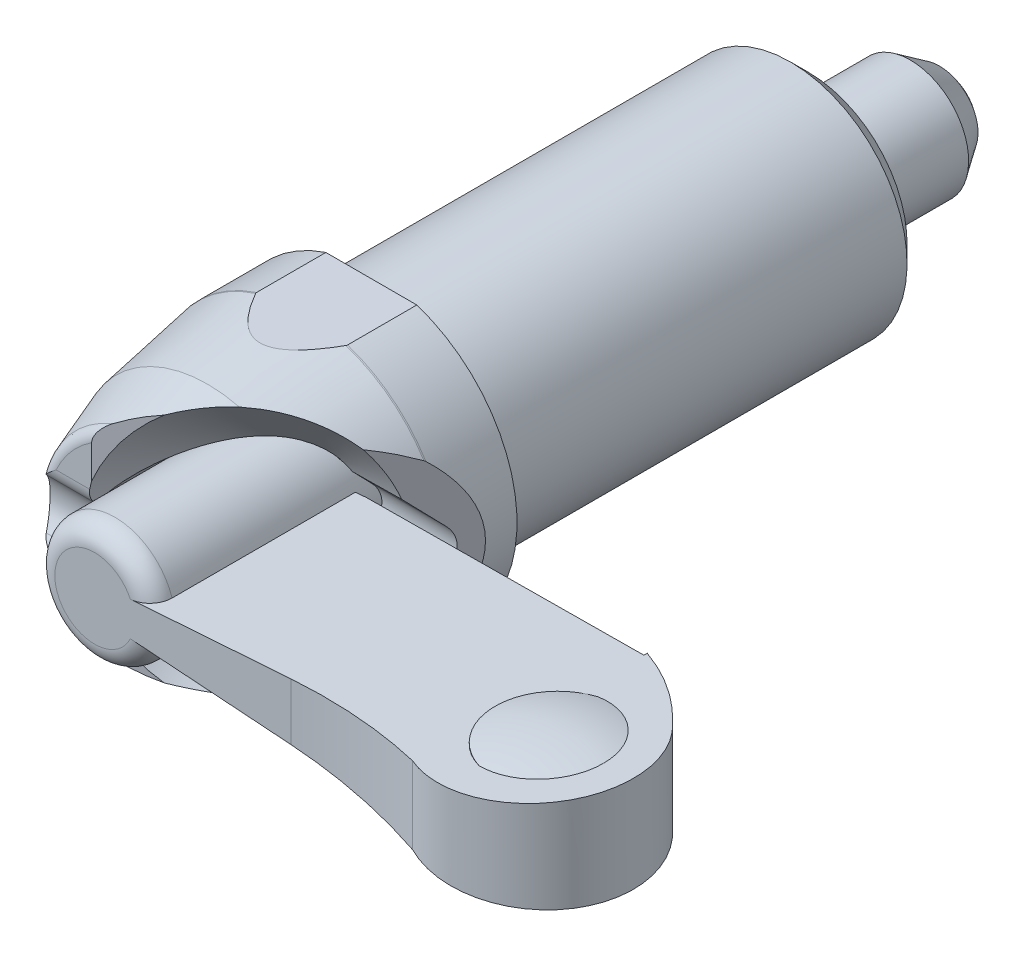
ISO-10303-21;
HEADER;
FILE_DESCRIPTION(('STEP AP214'),'2;1');
FILE_NAME('part.step','',(''),(''),'','','');
FILE_SCHEMA(('AUTOMOTIVE_DESIGN { 1 0 10303 214 1 1 1 1 }'));
ENDSEC;
DATA;
#1=APPLICATION_CONTEXT('core data for automotive mechanical design processes');
#2=APPLICATION_PROTOCOL_DEFINITION('international standard','automotive_design',2000,#1);
#3=PRODUCT_CONTEXT('',#1,'mechanical');
#4=PRODUCT('Part','Part','',(#3));
#5=PRODUCT_RELATED_PRODUCT_CATEGORY('part','',(#4));
#6=PRODUCT_DEFINITION_FORMATION('','',#4);
#7=PRODUCT_DEFINITION_CONTEXT('part definition',#1,'design');
#8=PRODUCT_DEFINITION('design','',#6,#7);
#9=PRODUCT_DEFINITION_SHAPE('','',#8);
#10=(LENGTH_UNIT() NAMED_UNIT(*) SI_UNIT(.MILLI.,.METRE.));
#11=(NAMED_UNIT(*) PLANE_ANGLE_UNIT() SI_UNIT($,.RADIAN.));
#12=(NAMED_UNIT(*) SI_UNIT($,.STERADIAN.) SOLID_ANGLE_UNIT());
#13=UNCERTAINTY_MEASURE_WITH_UNIT(LENGTH_MEASURE(1.E-05),#10,'distance_accuracy_value','');
#14=(GEOMETRIC_REPRESENTATION_CONTEXT(3) GLOBAL_UNCERTAINTY_ASSIGNED_CONTEXT((#13)) GLOBAL_UNIT_ASSIGNED_CONTEXT((#10,
#11,#12)) REPRESENTATION_CONTEXT('',''));
#15=CARTESIAN_POINT('',(0.,0.,0.));
#16=DIRECTION('',(0.,0.,1.));
#17=DIRECTION('',(1.,0.,0.));
#18=AXIS2_PLACEMENT_3D('',#15,#16,#17);
#19=CARTESIAN_POINT('',(0.,0.,2.5));
#20=DIRECTION('',(0.,0.,-1.));
#21=DIRECTION('',(0.,-1.,0.));
#22=AXIS2_PLACEMENT_3D('',#19,#20,#21);
#23=CYLINDRICAL_SURFACE('',#22,4.125);
#24=CARTESIAN_POINT('',(0.,0.,5.01));
#25=DIRECTION('',(0.,0.,1.));
#26=DIRECTION('',(0.,1.,0.));
#27=AXIS2_PLACEMENT_3D('',#24,#25,#26);
#28=CIRCLE('',#27,4.125);
#29=CARTESIAN_POINT('',(3.9221731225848,1.27756917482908,5.01));
#30=VERTEX_POINT('',#29);
#31=CARTESIAN_POINT('',(3.9221731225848,-1.27756917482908,5.01));
#32=VERTEX_POINT('',#31);
#33=EDGE_CURVE('E647',#30,#32,#28,.F.);
#34=ORIENTED_EDGE('',*,*,#33,.T.);
#35=DIRECTION('',(0.,0.,-1.));
#36=VECTOR('',#35,1.);
#37=CARTESIAN_POINT('',(3.9221731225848,-1.27756917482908,2.5));
#38=LINE('',#37,#36);
#39=CARTESIAN_POINT('',(3.9221731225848,-1.27756917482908,17.5999999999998));
#40=VERTEX_POINT('',#39);
#41=EDGE_CURVE('E562',#32,#40,#38,.F.);
#42=ORIENTED_EDGE('',*,*,#41,.T.);
#43=CARTESIAN_POINT('',(0.,0.,17.5999999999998));
#44=DIRECTION('',(0.,0.,-1.));
#45=DIRECTION('',(0.,-1.,0.));
#46=AXIS2_PLACEMENT_3D('',#43,#44,#45);
#47=CIRCLE('',#46,4.125);
#48=CARTESIAN_POINT('',(3.9221731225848,1.27756917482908,17.5999999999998));
#49=VERTEX_POINT('',#48);
#50=EDGE_CURVE('E649',#40,#49,#47,.T.);
#51=ORIENTED_EDGE('',*,*,#50,.T.);
#52=DIRECTION('',(0.,0.,-1.));
#53=VECTOR('',#52,1.);
#54=CARTESIAN_POINT('',(3.9221731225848,1.27756917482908,2.5));
#55=LINE('',#54,#53);
#56=EDGE_CURVE('E537',#49,#30,#55,.T.);
#57=ORIENTED_EDGE('',*,*,#56,.T.);
#58=EDGE_LOOP('',(#34,#42,#51,#57));
#59=FACE_BOUND('',#58,.T.);
#60=CARTESIAN_POINT('',(0.647046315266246,4.07393618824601,7.29249122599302));
#61=CARTESIAN_POINT('',(0.770432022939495,4.05433570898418,7.15261270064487));
#62=CARTESIAN_POINT('',(0.895994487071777,4.02865858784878,7.01550844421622));
#63=CARTESIAN_POINT('',(1.15054791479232,3.96347280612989,6.74796032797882));
#64=CARTESIAN_POINT('',(1.27953734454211,3.92397024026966,6.61751356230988));
#65=CARTESIAN_POINT('',(1.53921448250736,3.8295540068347,6.36467934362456));
#66=CARTESIAN_POINT('',(1.66989773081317,3.77467511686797,6.24227446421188));
#67=CARTESIAN_POINT('',(1.93109487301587,3.64794923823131,6.00640372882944));
#68=CARTESIAN_POINT('',(2.06160882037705,3.5761115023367,5.89293304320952));
#69=CARTESIAN_POINT('',(2.27590066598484,3.44180652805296,5.71286198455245));
#70=CARTESIAN_POINT('',(2.36051000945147,3.3844308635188,5.6434223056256));
#71=CARTESIAN_POINT('',(2.52753252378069,3.26158600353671,5.50923364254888));
#72=CARTESIAN_POINT('',(2.6099462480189,3.19611887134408,5.44448346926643));
#73=CARTESIAN_POINT('',(2.77160533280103,3.0569925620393,5.31995306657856));
#74=CARTESIAN_POINT('',(2.85085005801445,2.98333175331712,5.26017383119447));
#75=CARTESIAN_POINT('',(3.00509747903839,2.82789689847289,5.14588485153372));
#76=CARTESIAN_POINT('',(3.08010001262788,2.74612254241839,5.09137530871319));
#77=CARTESIAN_POINT('',(3.22528975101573,2.57408051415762,4.98753356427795));
#78=CARTESIAN_POINT('',(3.29543829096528,2.48375579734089,4.93824157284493));
#79=CARTESIAN_POINT('',(3.42919710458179,2.29555155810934,4.84556627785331));
#80=CARTESIAN_POINT('',(3.49280813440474,2.19767291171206,4.80218229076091));
#81=CARTESIAN_POINT('',(3.61239789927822,1.99500490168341,4.72158930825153));
#82=CARTESIAN_POINT('',(3.66837970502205,1.89021834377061,4.68437782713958));
#83=CARTESIAN_POINT('',(3.77173163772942,1.67450369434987,4.61634852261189));
#84=CARTESIAN_POINT('',(3.81910300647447,1.56357649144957,4.58552977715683));
#85=CARTESIAN_POINT('',(3.89930934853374,1.34998055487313,4.53374566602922));
#86=CARTESIAN_POINT('',(3.93320055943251,1.24788477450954,4.51204630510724));
#87=CARTESIAN_POINT('',(3.99308593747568,1.04045138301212,4.47389978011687));
#88=CARTESIAN_POINT('',(4.01908103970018,0.935114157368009,4.45745199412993));
#89=CARTESIAN_POINT('',(4.06276085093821,0.722091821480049,4.4299093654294));
#90=CARTESIAN_POINT('',(4.08044923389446,0.614407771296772,4.41881215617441));
#91=CARTESIAN_POINT('',(4.10724998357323,0.397561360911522,4.40202741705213));
#92=CARTESIAN_POINT('',(4.11636282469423,0.288399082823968,4.39633958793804));
#93=CARTESIAN_POINT('',(4.12546304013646,0.0788785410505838,4.39066033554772));
#94=CARTESIAN_POINT('',(4.12616151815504,-0.0214377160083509,4.39022501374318));
#95=CARTESIAN_POINT('',(4.12025182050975,-0.221805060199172,4.39391222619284));
#96=CARTESIAN_POINT('',(4.11364131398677,-0.321856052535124,4.39803621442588));
#97=CARTESIAN_POINT('',(4.09320440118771,-0.520867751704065,4.41081972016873));
#98=CARTESIAN_POINT('',(4.07938200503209,-0.619829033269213,4.41947671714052));
#99=CARTESIAN_POINT('',(4.04470367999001,-0.816044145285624,4.44128384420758));
#100=CARTESIAN_POINT('',(4.02384513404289,-0.913297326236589,4.45443564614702));
#101=CARTESIAN_POINT('',(3.97570624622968,-1.10404740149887,4.48495341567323));
#102=CARTESIAN_POINT('',(3.94851975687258,-1.1975778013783,4.50225789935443));
#103=CARTESIAN_POINT('',(3.88791915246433,-1.38170993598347,4.54109022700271));
#104=CARTESIAN_POINT('',(3.85450283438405,-1.4723106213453,4.56261956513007));
#105=CARTESIAN_POINT('',(3.74551106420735,-1.73882531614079,4.63340126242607));
#106=CARTESIAN_POINT('',(3.66114932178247,-1.90962104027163,4.68887432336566));
#107=CARTESIAN_POINT('',(3.46838582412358,-2.24156168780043,4.81851542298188));
#108=CARTESIAN_POINT('',(3.35901126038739,-2.40182798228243,4.89346413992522));
#109=CARTESIAN_POINT('',(3.12390211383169,-2.70055716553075,5.05934360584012));
#110=CARTESIAN_POINT('',(2.99816282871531,-2.83901376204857,5.15027895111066));
#111=CARTESIAN_POINT('',(2.7216668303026,-3.1062718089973,5.3571855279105));
#112=CARTESIAN_POINT('',(2.56967011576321,-3.23251804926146,5.47478523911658));
#113=CARTESIAN_POINT('',(2.25853648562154,-3.45709487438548,5.72606978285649));
#114=CARTESIAN_POINT('',(2.09939552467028,-3.55540940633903,5.85976380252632));
#115=CARTESIAN_POINT('',(1.82031956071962,-3.70409717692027,6.10528951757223));
#116=CARTESIAN_POINT('',(1.70070191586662,-3.76030422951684,6.21403940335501));
#117=CARTESIAN_POINT('',(1.46234320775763,-3.85925255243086,6.43848551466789));
#118=CARTESIAN_POINT('',(1.3436025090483,-3.90198850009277,6.55418446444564));
#119=CARTESIAN_POINT('',(1.10830240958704,-3.97523577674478,6.79171500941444));
#120=CARTESIAN_POINT('',(0.991745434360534,-4.00573420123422,6.9135529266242));
#121=CARTESIAN_POINT('',(0.76182605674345,-4.05574748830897,7.16241460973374));
#122=CARTESIAN_POINT('',(0.648464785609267,-4.07525850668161,7.28944017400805));
#123=CARTESIAN_POINT('',(0.362926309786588,-4.11275735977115,7.6203959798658));
#124=CARTESIAN_POINT('',(0.19345640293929,-4.12374130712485,7.8274673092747));
#125=CARTESIAN_POINT('',(-0.135591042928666,-4.12605575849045,8.24945688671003));
#126=CARTESIAN_POINT('',(-0.295161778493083,-4.11737289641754,8.46438037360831));
#127=CARTESIAN_POINT('',(-0.605524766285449,-4.08331392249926,8.90075928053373));
#128=CARTESIAN_POINT('',(-0.756268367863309,-4.0578533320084,9.12224231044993));
#129=CARTESIAN_POINT('',(-1.04892744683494,-3.99222542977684,9.56869804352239));
#130=CARTESIAN_POINT('',(-1.19084527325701,-3.95206205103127,9.79366979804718));
#131=CARTESIAN_POINT('',(-1.42561564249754,-3.87216624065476,10.1780181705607));
#132=CARTESIAN_POINT('',(-1.52046091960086,-3.8358891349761,10.3369139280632));
#133=CARTESIAN_POINT('',(-1.70661402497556,-3.75677095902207,10.6551641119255));
#134=CARTESIAN_POINT('',(-1.79792158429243,-3.7139293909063,10.8145185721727));
#135=CARTESIAN_POINT('',(-1.97734719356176,-3.62159006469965,11.1333620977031));
#136=CARTESIAN_POINT('',(-2.06546126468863,-3.57208434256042,11.2928510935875));
#137=CARTESIAN_POINT('',(-2.23856636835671,-3.46622839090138,11.6112436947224));
#138=CARTESIAN_POINT('',(-2.32355757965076,-3.40987855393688,11.7701473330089));
#139=CARTESIAN_POINT('',(-2.49014915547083,-3.29017574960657,12.0860756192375));
#140=CARTESIAN_POINT('',(-2.57176316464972,-3.22685574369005,12.2431055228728));
#141=CARTESIAN_POINT('',(-2.73202859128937,-3.09234460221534,12.5553533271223));
#142=CARTESIAN_POINT('',(-2.81067948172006,-3.0211520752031,12.7105709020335));
#143=CARTESIAN_POINT('',(-2.96472274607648,-2.87013209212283,13.0179567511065));
#144=CARTESIAN_POINT('',(-3.04012135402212,-2.79032228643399,13.170130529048));
#145=CARTESIAN_POINT('',(-3.18749459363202,-2.62071269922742,13.470468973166));
#146=CARTESIAN_POINT('',(-3.25947094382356,-2.53091800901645,13.6186356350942));
#147=CARTESIAN_POINT('',(-3.37666972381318,-2.3706772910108,13.8619430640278));
#148=CARTESIAN_POINT('',(-3.42298315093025,-2.30343048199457,13.9586638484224));
#149=CARTESIAN_POINT('',(-3.51350162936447,-2.16285196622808,14.1486890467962));
#150=CARTESIAN_POINT('',(-3.55770610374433,-2.08951860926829,14.2419925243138));
#151=CARTESIAN_POINT('',(-3.64340546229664,-1.93621018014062,14.4237267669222));
#152=CARTESIAN_POINT('',(-3.68490901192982,-1.85625843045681,14.512172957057));
#153=CARTESIAN_POINT('',(-3.76468929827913,-1.68859488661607,14.6828876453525));
#154=CARTESIAN_POINT('',(-3.80296858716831,-1.60088934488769,14.7651610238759));
#155=CARTESIAN_POINT('',(-3.87660887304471,-1.41350972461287,14.9239919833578));
#156=CARTESIAN_POINT('',(-3.91182715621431,-1.31353093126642,15.0002616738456));
#157=CARTESIAN_POINT('',(-3.97626165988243,-1.10319306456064,15.1402091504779));
#158=CARTESIAN_POINT('',(-4.00548175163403,-0.992840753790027,15.2038950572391));
#159=CARTESIAN_POINT('',(-4.05158040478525,-0.781036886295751,15.3045744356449));
#160=CARTESIAN_POINT('',(-4.06970293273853,-0.681153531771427,15.3442448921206));
#161=CARTESIAN_POINT('',(-4.09880708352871,-0.475541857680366,15.4080210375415));
#162=CARTESIAN_POINT('',(-4.10979859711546,-0.369821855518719,15.4321482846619));
#163=CARTESIAN_POINT('',(-4.1235295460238,-0.154399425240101,15.4622964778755));
#164=CARTESIAN_POINT('',(-4.12620642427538,-0.0446730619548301,15.4681801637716));
#165=CARTESIAN_POINT('',(-4.12278005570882,0.173986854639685,15.4606534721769));
#166=CARTESIAN_POINT('',(-4.11667464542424,0.282920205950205,15.4472383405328));
#167=CARTESIAN_POINT('',(-4.09757057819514,0.48441641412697,15.4053185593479));
#168=CARTESIAN_POINT('',(-4.08540858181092,0.577457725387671,15.3786459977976));
#169=CARTESIAN_POINT('',(-4.05572009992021,0.758402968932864,15.3136439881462));
#170=CARTESIAN_POINT('',(-4.03819180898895,0.846305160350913,15.2753106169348));
#171=CARTESIAN_POINT('',(-3.98521912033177,1.07489535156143,15.1597074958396));
#172=CARTESIAN_POINT('',(-3.94574864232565,1.21025588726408,15.0738017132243));
#173=CARTESIAN_POINT('',(-3.85838058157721,1.46520066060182,14.8845649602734));
#174=CARTESIAN_POINT('',(-3.810454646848,1.58472937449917,14.7811754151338));
#175=CARTESIAN_POINT('',(-3.71183579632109,1.80314711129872,14.5696315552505));
#176=CARTESIAN_POINT('',(-3.66148378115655,1.90284593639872,14.4621400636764));
#177=CARTESIAN_POINT('',(-3.5568553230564,2.09191070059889,14.2401234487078));
#178=CARTESIAN_POINT('',(-3.50257528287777,2.18126696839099,14.1255918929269));
#179=CARTESIAN_POINT('',(-3.39080255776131,2.35126454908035,13.8913432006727));
#180=CARTESIAN_POINT('',(-3.33330300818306,2.43188607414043,13.7716151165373));
#181=CARTESIAN_POINT('',(-3.21571302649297,2.58537303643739,13.5286100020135));
#182=CARTESIAN_POINT('',(-3.15562336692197,2.65824076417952,13.4053340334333));
#183=CARTESIAN_POINT('',(-3.02841877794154,2.8025443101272,13.1465504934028));
#184=CARTESIAN_POINT('',(-2.96111928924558,2.87343718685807,13.0108323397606));
#185=CARTESIAN_POINT('',(-2.82404587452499,3.00826018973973,12.7371812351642));
#186=CARTESIAN_POINT('',(-2.7542714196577,3.07218881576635,12.5992478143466));
#187=CARTESIAN_POINT('',(-2.61229369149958,3.19378907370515,12.3217156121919));
#188=CARTESIAN_POINT('',(-2.54008834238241,3.25145517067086,12.1821154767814));
#189=CARTESIAN_POINT('',(-2.39330939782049,3.36096395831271,11.9018644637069));
#190=CARTESIAN_POINT('',(-2.31873553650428,3.41280599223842,11.7612134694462));
#191=CARTESIAN_POINT('',(-2.16702929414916,3.51109564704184,11.4790372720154));
#192=CARTESIAN_POINT('',(-2.08989236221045,3.55753293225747,11.3375109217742));
#193=CARTESIAN_POINT('',(-1.93307776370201,3.64512014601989,11.0542143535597));
#194=CARTESIAN_POINT('',(-1.85339987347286,3.68626960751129,10.9124441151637));
#195=CARTESIAN_POINT('',(-1.69140697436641,3.7633508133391,10.629116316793));
#196=CARTESIAN_POINT('',(-1.60909368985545,3.79928588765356,10.4875586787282));
#197=CARTESIAN_POINT('',(-1.44159212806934,3.86594835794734,10.2049177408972));
#198=CARTESIAN_POINT('',(-1.35640375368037,3.89667557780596,10.0638344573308));
#199=CARTESIAN_POINT('',(-1.12837195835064,3.97045275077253,9.69401137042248));
#200=CARTESIAN_POINT('',(-0.982963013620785,4.00909915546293,9.46594575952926));
#201=CARTESIAN_POINT('',(-0.682895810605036,4.07096361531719,9.01371504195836));
#202=CARTESIAN_POINT('',(-0.528235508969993,4.09417824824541,8.7895508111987));
#203=CARTESIAN_POINT('',(-0.209327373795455,4.12278598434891,8.34795753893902));
#204=CARTESIAN_POINT('',(-0.0451112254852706,4.12823491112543,8.13050953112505));
#205=CARTESIAN_POINT('',(0.29356234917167,4.11802315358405,7.70426155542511));
#206=CARTESIAN_POINT('',(0.468012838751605,4.10237661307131,7.49545588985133));
#207=CARTESIAN_POINT('',(0.647046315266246,4.07393618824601,7.29249122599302));
#208=B_SPLINE_CURVE_WITH_KNOTS('',3,(#60,#61,#62,#63,#64,#65,#66,#67,#68,#69,#70,#71,#72,#73,
#74,#75,#76,#77,#78,#79,#80,#81,#82,#83,#84,#85,#86,#87,#88,#89,#90,#91,#92,#93,#94,#95,#96,#97,
#98,#99,#100,#101,#102,#103,#104,#105,#106,#107,#108,#109,#110,#111,#112,#113,#114,#115,#116,
#117,#118,#119,#120,#121,#122,#123,#124,#125,#126,#127,#128,#129,#130,#131,#132,#133,#134,#135,
#136,#137,#138,#139,#140,#141,#142,#143,#144,#145,#146,#147,#148,#149,#150,#151,#152,#153,#154,
#155,#156,#157,#158,#159,#160,#161,#162,#163,#164,#165,#166,#167,#168,#169,#170,#171,#172,#173,
#174,#175,#176,#177,#178,#179,#180,#181,#182,#183,#184,#185,#186,#187,#188,#189,#190,#191,#192,
#193,#194,#195,#196,#197,#198,#199,#200,#201,#202,#203,#204,#205,#206,#207),.UNSPECIFIED.,.T.,
.F.,(4,2,2,2,2,2,2,2,2,2,2,2,2,2,2,2,2,2,2,2,2,2,2,2,2,2,2,2,2,2,2,2,2,2,2,2,2,2,2,2,2,2,2,2,2,
2,2,2,2,2,2,2,2,2,2,2,2,2,2,2,2,2,2,2,2,2,2,2,2,2,2,2,2,4),(0.,0.562473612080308,
1.1246995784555,1.68566404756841,2.2463231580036,2.61674065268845,2.98706388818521,
3.35746099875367,3.7278722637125,4.1009571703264,4.4739988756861,4.84688998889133,
5.21972728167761,5.54850945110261,5.87725266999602,6.20585035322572,6.53442985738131,
6.83502460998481,7.13571525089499,7.43623887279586,7.73687439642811,8.03330706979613,
8.32984476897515,8.92239641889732,9.54388552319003,10.1655536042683,10.8527362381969,
11.5403130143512,12.0531044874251,12.566098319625,13.0796316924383,13.5933446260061,
14.3954447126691,15.1980900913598,16.0048081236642,16.8113105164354,17.3768899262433,
17.9425122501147,18.508816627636,19.0750885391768,19.6387891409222,20.2025895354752,
20.765256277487,21.3276374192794,21.707201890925,22.0868696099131,22.4652521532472,
22.8433323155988,23.2342151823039,23.6248449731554,23.9505618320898,24.2758259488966,
24.6035314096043,24.9313176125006,25.2228672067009,25.514514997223,26.0069709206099,
26.5011106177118,26.9654659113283,27.4302519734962,27.8960698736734,28.3617497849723,
28.8633110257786,29.364980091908,29.8670889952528,30.3692544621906,30.8723649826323,
31.3755199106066,31.8783520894,32.3812012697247,33.2002967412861,34.0195737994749,
34.8362740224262,35.6524269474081),.UNSPECIFIED.);
#209=CARTESIAN_POINT('',(2.93206359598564,2.90148721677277,5.2));
#210=VERTEX_POINT('',#209);
#211=CARTESIAN_POINT('',(3.50214929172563,2.17958145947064,4.79601048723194));
#212=VERTEX_POINT('',#211);
#213=EDGE_CURVE('E9',#210,#212,#208,.T.);
#214=ORIENTED_EDGE('',*,*,#213,.F.);
#215=CARTESIAN_POINT('',(0.,0.,5.2));
#216=DIRECTION('',(0.,0.,-1.));
#217=DIRECTION('',(0.,1.,0.));
#218=AXIS2_PLACEMENT_3D('',#215,#216,#217);
#219=CIRCLE('',#218,4.125);
#220=CARTESIAN_POINT('',(2.93206359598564,-2.90148721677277,5.2));
#221=VERTEX_POINT('',#220);
#222=EDGE_CURVE('E18',#210,#221,#219,.F.);
#223=ORIENTED_EDGE('',*,*,#222,.T.);
#224=CARTESIAN_POINT('',(3.50214929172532,-2.17958145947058,4.79601048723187));
#225=VERTEX_POINT('',#224);
#226=EDGE_CURVE('E24',#225,#221,#208,.T.);
#227=ORIENTED_EDGE('',*,*,#226,.F.);
#228=CARTESIAN_POINT('',(0.,0.,2.70640381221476));
#229=DIRECTION('',(0.,0.692050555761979,0.721849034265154));
#230=DIRECTION('',(0.,0.721849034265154,-0.692050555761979));
#231=AXIS2_PLACEMENT_3D('',#228,#229,#230);
#232=ELLIPSE('',#231,5.71449126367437,4.125);
#233=CARTESIAN_POINT('',(3.93241388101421,-1.2456910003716,3.9006717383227));
#234=VERTEX_POINT('',#233);
#235=EDGE_CURVE('E277',#234,#225,#232,.F.);
#236=ORIENTED_EDGE('',*,*,#235,.F.);
#237=CARTESIAN_POINT('',(3.93241388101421,1.2456910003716,3.9006717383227));
#238=CARTESIAN_POINT('',(3.94372347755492,1.20998965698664,3.86644885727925));
#239=CARTESIAN_POINT('',(3.95494218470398,1.17288231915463,3.83369386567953));
#240=CARTESIAN_POINT('',(3.97693352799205,1.09600456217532,3.77128335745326));
#241=CARTESIAN_POINT('',(3.98770602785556,1.05623333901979,3.74162878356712));
#242=CARTESIAN_POINT('',(4.01898533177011,0.933031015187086,3.65748871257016));
#243=CARTESIAN_POINT('',(4.0384105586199,0.845843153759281,3.60795348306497));
#244=CARTESIAN_POINT('',(4.0723584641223,0.663436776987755,3.52370226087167));
#245=CARTESIAN_POINT('',(4.08686910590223,0.568199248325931,3.48902259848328));
#246=CARTESIAN_POINT('',(4.10930835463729,0.372638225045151,3.43609252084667));
#247=CARTESIAN_POINT('',(4.11724805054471,0.27232360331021,3.4178144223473));
#248=CARTESIAN_POINT('',(4.12542016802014,0.0754581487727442,3.39901938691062));
#249=CARTESIAN_POINT('',(4.12606141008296,-0.0209865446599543,3.39756027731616));
#250=CARTESIAN_POINT('',(4.12062810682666,-0.212705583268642,3.41003273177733));
#251=CARTESIAN_POINT('',(4.11455212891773,-0.307979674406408,3.42396757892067));
#252=CARTESIAN_POINT('',(4.09660617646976,-0.49163688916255,3.46595814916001));
#253=CARTESIAN_POINT('',(4.08492022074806,-0.580141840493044,3.49356621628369));
#254=CARTESIAN_POINT('',(4.05693648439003,-0.751274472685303,3.56168706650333));
#255=CARTESIAN_POINT('',(4.04063752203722,-0.833900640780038,3.60220315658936));
#256=CARTESIAN_POINT('',(4.00904578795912,-0.973154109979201,3.68411732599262));
#257=CARTESIAN_POINT('',(3.99439985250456,-1.0313602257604,3.72312105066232));
#258=CARTESIAN_POINT('',(3.96403353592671,-1.14253901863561,3.80735597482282));
#259=CARTESIAN_POINT('',(3.94831588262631,-1.1955242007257,3.85257164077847));
#260=CARTESIAN_POINT('',(3.93241388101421,-1.2456910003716,3.9006717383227));
#261=B_SPLINE_CURVE_WITH_KNOTS('',3,(#237,#238,#239,#240,#241,#242,#243,#244,#245,#246,#247,
#248,#249,#250,#251,#252,#253,#254,#255,#256,#257,#258,#259,#260),.UNSPECIFIED.,.F.,.F.,(4,2,2,
2,2,2,2,2,2,2,2,4),(0.,0.152110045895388,0.304266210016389,0.609135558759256,0.914746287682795,
1.21984021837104,1.50775434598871,1.79572988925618,2.07484513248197,2.35403194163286,
2.56831993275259,2.78208151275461),.UNSPECIFIED.);
#262=CARTESIAN_POINT('',(3.93241388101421,1.2456910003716,3.9006717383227));
#263=VERTEX_POINT('',#262);
#264=EDGE_CURVE('E283',#263,#234,#261,.T.);
#265=ORIENTED_EDGE('',*,*,#264,.F.);
#266=CARTESIAN_POINT('',(0.,0.,2.70640381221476));
#267=DIRECTION('',(0.,-0.692050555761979,0.721849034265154));
#268=DIRECTION('',(0.,-0.721849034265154,-0.692050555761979));
#269=AXIS2_PLACEMENT_3D('',#266,#267,#268);
#270=ELLIPSE('',#269,5.71449126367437,4.125);
#271=EDGE_CURVE('E282',#212,#263,#270,.F.);
#272=ORIENTED_EDGE('',*,*,#271,.F.);
#273=EDGE_LOOP('',(#214,#223,#227,#236,#265,#272));
#274=FACE_BOUND('',#273,.T.);
#275=ADVANCED_FACE('F14',(#59,#274),#23,.T.);
#276=CARTESIAN_POINT('',(19.480619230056,3.8,5.01));
#277=DIRECTION('',(0.,0.,1.));
#278=DIRECTION('',(0.,1.,0.));
#279=AXIS2_PLACEMENT_3D('',#276,#277,#278);
#280=PLANE('',#279);
#281=ORIENTED_EDGE('',*,*,#33,.F.);
#282=DIRECTION('',(0.997505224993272,0.0705926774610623,0.));
#283=VECTOR('',#282,1.);
#284=CARTESIAN_POINT('',(19.5807073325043,2.38571159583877,5.01));
#285=LINE('',#284,#283);
#286=CARTESIAN_POINT('',(4.7213930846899,1.33412935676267,5.01));
#287=VERTEX_POINT('',#286);
#288=EDGE_CURVE('E595',#30,#287,#285,.T.);
#289=ORIENTED_EDGE('',*,*,#288,.T.);
#290=DIRECTION('',(1.,0.,0.));
#291=VECTOR('',#290,1.);
#292=CARTESIAN_POINT('',(19.480619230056,1.33412935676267,5.01));
#293=LINE('',#292,#291);
#294=CARTESIAN_POINT('',(19.4806192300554,1.33412935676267,5.01));
#295=VERTEX_POINT('',#294);
#296=EDGE_CURVE('E587',#287,#295,#293,.T.);
#297=ORIENTED_EDGE('',*,*,#296,.T.);
#298=DIRECTION('',(0.,-1.,0.));
#299=VECTOR('',#298,1.);
#300=CARTESIAN_POINT('',(19.4806192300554,3.8,5.01));
#301=LINE('',#300,#299);
#302=CARTESIAN_POINT('',(19.4806192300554,-1.33412935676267,5.01));
#303=VERTEX_POINT('',#302);
#304=EDGE_CURVE('E618',#295,#303,#301,.T.);
#305=ORIENTED_EDGE('',*,*,#304,.T.);
#306=DIRECTION('',(-1.,0.,0.));
#307=VECTOR('',#306,1.);
#308=CARTESIAN_POINT('',(19.480619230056,-1.33412935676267,5.01));
#309=LINE('',#308,#307);
#310=CARTESIAN_POINT('',(4.72139308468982,-1.33412935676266,5.01));
#311=VERTEX_POINT('',#310);
#312=EDGE_CURVE('E581',#303,#311,#309,.T.);
#313=ORIENTED_EDGE('',*,*,#312,.T.);
#314=DIRECTION('',(-0.997505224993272,0.0705926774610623,0.));
#315=VECTOR('',#314,1.);
#316=CARTESIAN_POINT('',(19.0455414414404,-2.34783831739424,5.01));
#317=LINE('',#316,#315);
#318=EDGE_CURVE('E606',#311,#32,#317,.T.);
#319=ORIENTED_EDGE('',*,*,#318,.T.);
#320=EDGE_LOOP('',(#281,#289,#297,#305,#313,#319));
#321=FACE_BOUND('',#320,.T.);
#322=ADVANCED_FACE('F507',(#321),#280,.F.);
#323=CARTESIAN_POINT('',(0.,-1.,32.5));
#324=DIRECTION('',(0.0705926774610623,0.997505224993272,0.));
#325=DIRECTION('',(-0.997505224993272,0.0705926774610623,0.));
#326=AXIS2_PLACEMENT_3D('',#323,#324,#325);
#327=PLANE('',#326);
#328=DIRECTION('',(0.997505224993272,-0.0705926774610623,0.));
#329=VECTOR('',#328,1.);
#330=CARTESIAN_POINT('',(-0.337999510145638,-0.976080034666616,19.));
#331=LINE('',#330,#329);
#332=CARTESIAN_POINT('',(2.45912143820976,-1.17403013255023,19.));
#333=VERTEX_POINT('',#332);
#334=CARTESIAN_POINT('',(13.470451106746,-1.95329346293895,19.));
#335=VERTEX_POINT('',#334);
#336=EDGE_CURVE('E114',#333,#335,#331,.T.);
#337=ORIENTED_EDGE('',*,*,#336,.F.);
#338=CARTESIAN_POINT('',(0.79953631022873,-1.05658256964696,17.5997999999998));
#339=CARTESIAN_POINT('',(0.799503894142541,-1.05658027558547,17.6321018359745));
#340=CARTESIAN_POINT('',(0.801215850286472,-1.05670142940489,17.6643866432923));
#341=CARTESIAN_POINT('',(0.807925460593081,-1.05717626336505,17.7285448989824));
#342=CARTESIAN_POINT('',(0.81291614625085,-1.05752945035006,17.7604190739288));
#343=CARTESIAN_POINT('',(0.825894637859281,-1.05844792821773,17.8230977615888));
#344=CARTESIAN_POINT('',(0.833841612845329,-1.05901032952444,17.85391086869));
#345=CARTESIAN_POINT('',(0.852440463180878,-1.06032655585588,17.9147114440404));
#346=CARTESIAN_POINT('',(0.863093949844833,-1.0610804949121,17.9446984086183));
#347=CARTESIAN_POINT('',(0.903937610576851,-1.0639709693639,18.0463819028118));
#348=CARTESIAN_POINT('',(0.940107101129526,-1.06653065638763,18.1157094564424));
#349=CARTESIAN_POINT('',(1.02305943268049,-1.072401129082,18.2480056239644));
#350=CARTESIAN_POINT('',(1.06991004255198,-1.07571671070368,18.310929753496));
#351=CARTESIAN_POINT('',(1.18728444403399,-1.08402320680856,18.4479608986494));
#352=CARTESIAN_POINT('',(1.26066838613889,-1.08921653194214,18.519614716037));
#353=CARTESIAN_POINT('',(1.41798221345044,-1.10034951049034,18.649805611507));
#354=CARTESIAN_POINT('',(1.50189956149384,-1.10628827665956,18.7083580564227));
#355=CARTESIAN_POINT('',(1.67875518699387,-1.11880421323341,18.8112190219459));
#356=CARTESIAN_POINT('',(1.77174620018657,-1.12538511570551,18.8554369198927));
#357=CARTESIAN_POINT('',(1.963953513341,-1.13898747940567,18.9272208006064));
#358=CARTESIAN_POINT('',(2.06316890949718,-1.14600887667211,18.9547891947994));
#359=CARTESIAN_POINT('',(2.26284447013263,-1.16013976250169,18.9911254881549));
#360=CARTESIAN_POINT('',(2.36323385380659,-1.1672442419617,19.0002789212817));
#361=CARTESIAN_POINT('',(2.56398207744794,-1.18145103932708,18.9997085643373));
#362=CARTESIAN_POINT('',(2.66434090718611,-1.18855335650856,18.9899943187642));
#363=CARTESIAN_POINT('',(2.85209924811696,-1.20184086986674,18.9530231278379));
#364=CARTESIAN_POINT('',(2.9398356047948,-1.20804990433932,18.9274829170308));
#365=CARTESIAN_POINT('',(3.10919197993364,-1.22003512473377,18.8607688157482));
#366=CARTESIAN_POINT('',(3.1908148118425,-1.22581150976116,18.8196021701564));
#367=CARTESIAN_POINT('',(3.33895088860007,-1.23629498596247,18.7263854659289));
#368=CARTESIAN_POINT('',(3.40614386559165,-1.24105018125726,18.6754191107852));
#369=CARTESIAN_POINT('',(3.53045377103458,-1.24984749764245,18.5623597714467));
#370=CARTESIAN_POINT('',(3.58757503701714,-1.2538899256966,18.500271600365));
#371=CARTESIAN_POINT('',(3.68716242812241,-1.26093764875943,18.3701537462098));
#372=CARTESIAN_POINT('',(3.73021975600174,-1.26398478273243,18.3025780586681));
#373=CARTESIAN_POINT('',(3.80400955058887,-1.26920682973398,18.160968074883));
#374=CARTESIAN_POINT('',(3.83474529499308,-1.27138197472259,18.0869355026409));
#375=CARTESIAN_POINT('',(3.87974150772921,-1.27456632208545,17.944459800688));
#376=CARTESIAN_POINT('',(3.89561281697,-1.27568952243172,17.8765228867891));
#377=CARTESIAN_POINT('',(3.9168572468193,-1.27719297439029,17.7390013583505));
#378=CARTESIAN_POINT('',(3.92222733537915,-1.27757301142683,17.6694162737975));
#379=CARTESIAN_POINT('',(3.92217310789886,-1.27756917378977,17.5997999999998));
#380=B_SPLINE_CURVE_WITH_KNOTS('',3,(#338,#339,#340,#341,#342,#343,#344,#345,#346,#347,#348,
#349,#350,#351,#352,#353,#354,#355,#356,#357,#358,#359,#360,#361,#362,#363,#364,#365,#366,#367,
#368,#369,#370,#371,#372,#373,#374,#375,#376,#377,#378,#379),.UNSPECIFIED.,.F.,.F.,(4,2,2,2,2,2,
2,2,2,2,2,2,2,2,2,2,2,2,2,2,4),(0.,0.0968315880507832,0.19345803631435,0.288796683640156,
0.384192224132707,0.617488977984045,0.85230929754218,1.15884004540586,1.46500935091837,
1.77307812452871,2.08110226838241,2.38260758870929,2.6839604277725,2.95726806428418,
3.23044914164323,3.48256984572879,3.73458170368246,3.97395774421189,4.21327006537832,
4.42179489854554,4.63037993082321),.UNSPECIFIED.);
#381=EDGE_CURVE('E117',#333,#40,#380,.T.);
#382=ORIENTED_EDGE('',*,*,#381,.T.);
#383=ORIENTED_EDGE('',*,*,#41,.F.);
#384=ORIENTED_EDGE('',*,*,#318,.F.);
#385=DIRECTION('',(0.995522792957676,-0.0704523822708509,0.0630145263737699));
#386=VECTOR('',#385,1.);
#387=CARTESIAN_POINT('',(1.74326145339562,-1.12336927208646,4.82149044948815));
#388=LINE('',#387,#386);
#389=CARTESIAN_POINT('',(25.,-2.76923076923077,6.29359372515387));
#390=VERTEX_POINT('',#389);
#391=EDGE_CURVE('E630',#311,#390,#388,.T.);
#392=ORIENTED_EDGE('',*,*,#391,.T.);
#393=DIRECTION('',(0.,0.,1.));
#394=VECTOR('',#393,1.);
#395=CARTESIAN_POINT('',(25.,-2.76923076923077,32.5));
#396=LINE('',#395,#394);
#397=CARTESIAN_POINT('',(25.,-2.76923076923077,6.06236808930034));
#398=VERTEX_POINT('',#397);
#399=EDGE_CURVE('E628',#398,#390,#396,.T.);
#400=ORIENTED_EDGE('',*,*,#399,.F.);
#401=CARTESIAN_POINT('',(19.4806192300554,-2.3786284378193,20.0100000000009));
#402=DIRECTION('',(0.0705926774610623,0.997505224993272,0.));
#403=DIRECTION('',(0.997505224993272,-0.0705926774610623,0.));
#404=AXIS2_PLACEMENT_3D('',#401,#402,#403);
#405=ELLIPSE('',#404,15.0375152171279,15.0000000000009);
#406=CARTESIAN_POINT('',(30.399753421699,-3.15136716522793,9.725423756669));
#407=VERTEX_POINT('',#406);
#408=EDGE_CURVE('E603',#407,#398,#405,.T.);
#409=ORIENTED_EDGE('',*,*,#408,.F.);
#410=CARTESIAN_POINT('',(26.,-2.84,14.51));
#411=DIRECTION('',(0.0705926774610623,0.997505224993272,0.));
#412=DIRECTION('',(0.997505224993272,-0.0705926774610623,0.));
#413=AXIS2_PLACEMENT_3D('',#410,#411,#412);
#414=ELLIPSE('',#413,6.51625659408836,6.5);
#415=CARTESIAN_POINT('',(23.219005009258,-2.6431911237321,20.385037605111));
#416=VERTEX_POINT('',#415);
#417=EDGE_CURVE('E626',#416,#407,#414,.T.);
#418=ORIENTED_EDGE('',*,*,#417,.F.);
#419=CARTESIAN_POINT('',(13.4704511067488,-1.95329346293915,53.9999999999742));
#420=DIRECTION('',(0.0705926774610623,0.997505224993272,0.));
#421=DIRECTION('',(0.997505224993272,-0.0705926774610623,0.));
#422=AXIS2_PLACEMENT_3D('',#419,#420,#421);
#423=ELLIPSE('',#422,35.0875355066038,34.9999999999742);
#424=EDGE_CURVE('E609',#416,#335,#423,.T.);
#425=ORIENTED_EDGE('',*,*,#424,.T.);
#426=EDGE_LOOP('',(#337,#382,#383,#384,#392,#400,#409,#418,#425));
#427=FACE_BOUND('',#426,.T.);
#428=CARTESIAN_POINT('',(27.3,-2.932,14.5));
#429=DIRECTION('',(0.0705926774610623,0.997505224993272,0.));
#430=DIRECTION('',(0.997505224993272,-0.0705926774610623,0.));
#431=AXIS2_PLACEMENT_3D('',#428,#429,#430);
#432=ELLIPSE('',#431,4.31075436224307,4.3);
#433=CARTESIAN_POINT('',(25.9743065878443,-2.8381816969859,18.5905423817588));
#434=VERTEX_POINT('',#433);
#435=CARTESIAN_POINT('',(25.9743065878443,-2.8381816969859,10.4094576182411));
#436=VERTEX_POINT('',#435);
#437=EDGE_CURVE('E639',#434,#436,#432,.F.);
#438=ORIENTED_EDGE('',*,*,#437,.F.);
#439=CARTESIAN_POINT('',(26.3330397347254,-2.8635689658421,14.5));
#440=DIRECTION('',(0.0705926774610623,0.997505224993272,0.));
#441=DIRECTION('',(-0.997505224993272,0.0705926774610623,0.));
#442=AXIS2_PLACEMENT_3D('',#439,#440,#441);
#443=CIRCLE('',#442,4.10632085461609);
#444=EDGE_CURVE('E636',#434,#436,#443,.T.);
#445=ORIENTED_EDGE('',*,*,#444,.T.);
#446=EDGE_LOOP('',(#438,#445));
#447=FACE_BOUND('',#446,.T.);
#448=ADVANCED_FACE('F549',(#427,#447),#327,.F.);
#449=CARTESIAN_POINT('',(13.4704511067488,3.8,53.9999999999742));
#450=DIRECTION('',(0.,-1.,0.));
#451=DIRECTION('',(1.,0.,0.));
#452=AXIS2_PLACEMENT_3D('',#449,#450,#451);
#453=CYLINDRICAL_SURFACE('',#452,34.9999999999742);
#454=ORIENTED_EDGE('',*,*,#424,.F.);
#455=DIRECTION('',(0.,-1.,0.));
#456=VECTOR('',#455,1.);
#457=CARTESIAN_POINT('',(23.219005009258,3.8,20.385037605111));
#458=LINE('',#457,#456);
#459=CARTESIAN_POINT('',(23.219005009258,2.6431911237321,20.385037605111));
#460=VERTEX_POINT('',#459);
#461=EDGE_CURVE('E612',#460,#416,#458,.T.);
#462=ORIENTED_EDGE('',*,*,#461,.F.);
#463=CARTESIAN_POINT('',(13.4704511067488,1.95329346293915,53.9999999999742));
#464=DIRECTION('',(0.0705926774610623,-0.997505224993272,0.));
#465=DIRECTION('',(-0.997505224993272,-0.0705926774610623,0.));
#466=AXIS2_PLACEMENT_3D('',#463,#464,#465);
#467=ELLIPSE('',#466,35.0875355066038,34.9999999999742);
#468=CARTESIAN_POINT('',(13.470451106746,1.95329346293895,19.));
#469=VERTEX_POINT('',#468);
#470=EDGE_CURVE('E597',#469,#460,#467,.T.);
#471=ORIENTED_EDGE('',*,*,#470,.F.);
#472=DIRECTION('',(0.,-1.,0.));
#473=VECTOR('',#472,1.);
#474=CARTESIAN_POINT('',(13.470451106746,3.8,19.));
#475=LINE('',#474,#473);
#476=EDGE_CURVE('E621',#469,#335,#475,.T.);
#477=ORIENTED_EDGE('',*,*,#476,.T.);
#478=EDGE_LOOP('',(#454,#462,#471,#477));
#479=FACE_BOUND('',#478,.T.);
#480=ADVANCED_FACE('F16',(#479),#453,.F.);
#481=CARTESIAN_POINT('',(0.,3.8,19.));
#482=DIRECTION('',(0.,0.,-1.));
#483=DIRECTION('',(0.,-1.,0.));
#484=AXIS2_PLACEMENT_3D('',#481,#482,#483);
#485=PLANE('',#484);
#486=DIRECTION('',(-0.997505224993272,-0.0705926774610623,0.));
#487=VECTOR('',#486,1.);
#488=CARTESIAN_POINT('',(0.197166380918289,1.01395331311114,19.));
#489=LINE('',#488,#487);
#490=CARTESIAN_POINT('',(2.45912143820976,1.17403013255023,19.));
#491=VERTEX_POINT('',#490);
#492=EDGE_CURVE('E600',#469,#491,#489,.T.);
#493=ORIENTED_EDGE('',*,*,#492,.T.);
#494=CARTESIAN_POINT('',(0.,0.,19.));
#495=DIRECTION('',(0.,0.,-1.));
#496=DIRECTION('',(0.,-1.,0.));
#497=AXIS2_PLACEMENT_3D('',#494,#495,#496);
#498=CIRCLE('',#497,2.725);
#499=EDGE_CURVE('E654',#333,#491,#498,.T.);
#500=ORIENTED_EDGE('',*,*,#499,.F.);
#501=ORIENTED_EDGE('',*,*,#336,.T.);
#502=ORIENTED_EDGE('',*,*,#476,.F.);
#503=EDGE_LOOP('',(#493,#500,#501,#502));
#504=FACE_BOUND('',#503,.T.);
#505=ADVANCED_FACE('F679',(#504),#485,.F.);
#506=CARTESIAN_POINT('',(19.4806192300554,3.8,20.0100000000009));
#507=DIRECTION('',(0.,-1.,0.));
#508=DIRECTION('',(1.,0.,0.));
#509=AXIS2_PLACEMENT_3D('',#506,#507,#508);
#510=CYLINDRICAL_SURFACE('',#509,15.0000000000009);
#511=ORIENTED_EDGE('',*,*,#304,.F.);
#512=CARTESIAN_POINT('',(19.4806192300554,18.104639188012,20.0100000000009));
#513=DIRECTION('',(0.,-0.666666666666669,0.745355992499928));
#514=DIRECTION('',(0.,-0.745355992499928,-0.666666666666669));
#515=AXIS2_PLACEMENT_3D('',#512,#513,#514);
#516=ELLIPSE('',#515,22.5000000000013,15.0000000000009);
#517=CARTESIAN_POINT('',(25.,2.51071264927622,6.06236808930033));
#518=VERTEX_POINT('',#517);
#519=EDGE_CURVE('E590',#295,#518,#516,.T.);
#520=ORIENTED_EDGE('',*,*,#519,.T.);
#521=DIRECTION('',(0.,-1.,0.));
#522=VECTOR('',#521,1.);
#523=CARTESIAN_POINT('',(25.,3.8,6.06236808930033));
#524=LINE('',#523,#522);
#525=CARTESIAN_POINT('',(25.,2.76923076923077,6.06236808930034));
#526=VERTEX_POINT('',#525);
#527=EDGE_CURVE('E579',#526,#518,#524,.T.);
#528=ORIENTED_EDGE('',*,*,#527,.F.);
#529=CARTESIAN_POINT('',(19.4806192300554,2.3786284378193,20.0100000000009));
#530=DIRECTION('',(0.0705926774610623,-0.997505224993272,0.));
#531=DIRECTION('',(-0.997505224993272,-0.0705926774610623,0.));
#532=AXIS2_PLACEMENT_3D('',#529,#530,#531);
#533=ELLIPSE('',#532,15.0375152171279,15.0000000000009);
#534=CARTESIAN_POINT('',(30.399753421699,3.15136716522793,9.725423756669));
#535=VERTEX_POINT('',#534);
#536=EDGE_CURVE('E593',#526,#535,#533,.T.);
#537=ORIENTED_EDGE('',*,*,#536,.T.);
#538=DIRECTION('',(0.,-1.,0.));
#539=VECTOR('',#538,1.);
#540=CARTESIAN_POINT('',(30.399753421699,3.8,9.725423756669));
#541=LINE('',#540,#539);
#542=EDGE_CURVE('E615',#535,#407,#541,.T.);
#543=ORIENTED_EDGE('',*,*,#542,.T.);
#544=ORIENTED_EDGE('',*,*,#408,.T.);
#545=CARTESIAN_POINT('',(25.,-2.51071264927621,6.06236808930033));
#546=VERTEX_POINT('',#545);
#547=EDGE_CURVE('E576',#546,#398,#524,.T.);
#548=ORIENTED_EDGE('',*,*,#547,.F.);
#549=CARTESIAN_POINT('',(19.4806192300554,-18.104639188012,20.0100000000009));
#550=DIRECTION('',(0.,0.666666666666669,0.745355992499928));
#551=DIRECTION('',(0.,-0.745355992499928,0.666666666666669));
#552=AXIS2_PLACEMENT_3D('',#549,#550,#551);
#553=ELLIPSE('',#552,22.5000000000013,15.0000000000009);
#554=EDGE_CURVE('E584',#546,#303,#553,.T.);
#555=ORIENTED_EDGE('',*,*,#554,.T.);
#556=EDGE_LOOP('',(#511,#520,#528,#537,#543,#544,#548,#555));
#557=FACE_BOUND('',#556,.T.);
#558=ADVANCED_FACE('F665',(#557),#510,.T.);
#559=CARTESIAN_POINT('',(26.,3.8,14.51));
#560=DIRECTION('',(0.,-1.,0.));
#561=DIRECTION('',(1.,0.,0.));
#562=AXIS2_PLACEMENT_3D('',#559,#560,#561);
#563=CYLINDRICAL_SURFACE('',#562,6.5);
#564=CARTESIAN_POINT('',(26.,2.84,14.51));
#565=DIRECTION('',(0.0705926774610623,-0.997505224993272,0.));
#566=DIRECTION('',(-0.997505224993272,-0.0705926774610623,0.));
#567=AXIS2_PLACEMENT_3D('',#564,#565,#566);
#568=ELLIPSE('',#567,6.51625659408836,6.5);
#569=EDGE_CURVE('E624',#535,#460,#568,.T.);
#570=ORIENTED_EDGE('',*,*,#569,.T.);
#571=ORIENTED_EDGE('',*,*,#461,.T.);
#572=ORIENTED_EDGE('',*,*,#417,.T.);
#573=ORIENTED_EDGE('',*,*,#542,.F.);
#574=EDGE_LOOP('',(#570,#571,#572,#573));
#575=FACE_BOUND('',#574,.T.);
#576=ADVANCED_FACE('F545',(#575),#563,.T.);
#577=CARTESIAN_POINT('',(32.5,3.3,32.5));
#578=DIRECTION('',(0.0705926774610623,-0.997505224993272,0.));
#579=DIRECTION('',(0.997505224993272,0.0705926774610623,0.));
#580=AXIS2_PLACEMENT_3D('',#577,#578,#579);
#581=PLANE('',#580);
#582=CARTESIAN_POINT('',(26.3330397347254,2.8635689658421,14.5));
#583=DIRECTION('',(0.0705926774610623,-0.997505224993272,0.));
#584=DIRECTION('',(0.997505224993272,0.0705926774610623,0.));
#585=AXIS2_PLACEMENT_3D('',#582,#583,#584);
#586=CIRCLE('',#585,4.10632085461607);
#587=CARTESIAN_POINT('',(25.9743065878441,2.83818169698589,10.409457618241));
#588=VERTEX_POINT('',#587);
#589=CARTESIAN_POINT('',(25.9743065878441,2.83818169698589,18.590542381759));
#590=VERTEX_POINT('',#589);
#591=EDGE_CURVE('E641',#588,#590,#586,.T.);
#592=ORIENTED_EDGE('',*,*,#591,.T.);
#593=CARTESIAN_POINT('',(27.3,2.932,14.5));
#594=DIRECTION('',(0.0705926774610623,-0.997505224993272,0.));
#595=DIRECTION('',(-0.997505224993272,-0.0705926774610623,0.));
#596=AXIS2_PLACEMENT_3D('',#593,#594,#595);
#597=ELLIPSE('',#596,4.31075436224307,4.3);
#598=EDGE_CURVE('E568',#588,#590,#597,.F.);
#599=ORIENTED_EDGE('',*,*,#598,.F.);
#600=EDGE_LOOP('',(#592,#599));
#601=FACE_BOUND('',#600,.T.);
#602=ORIENTED_EDGE('',*,*,#56,.F.);
#603=CARTESIAN_POINT('',(3.92217310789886,1.27756917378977,17.5997999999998));
#604=CARTESIAN_POINT('',(3.92217889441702,1.2775695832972,17.6382472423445));
#605=CARTESIAN_POINT('',(3.92055519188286,1.27745467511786,17.6766760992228));
#606=CARTESIAN_POINT('',(3.91406905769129,1.27699565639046,17.7532547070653));
#607=CARTESIAN_POINT('',(3.90920691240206,1.27665156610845,17.7914044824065));
#608=CARTESIAN_POINT('',(3.88982138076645,1.27527966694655,17.9049143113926));
#609=CARTESIAN_POINT('',(3.87049871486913,1.27391221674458,17.9795070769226));
#610=CARTESIAN_POINT('',(3.81965628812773,1.27031413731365,18.1243655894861));
#611=CARTESIAN_POINT('',(3.78813319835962,1.2680832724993,18.1946301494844));
#612=CARTESIAN_POINT('',(3.71387605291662,1.26282815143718,18.3289265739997));
#613=CARTESIAN_POINT('',(3.6711426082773,1.25980393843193,18.3929587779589));
#614=CARTESIAN_POINT('',(3.57530973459,1.25302191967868,18.5136822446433));
#615=CARTESIAN_POINT('',(3.52211488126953,1.24925736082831,18.570297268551));
#616=CARTESIAN_POINT('',(3.40721844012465,1.24112622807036,18.6740650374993));
#617=CARTESIAN_POINT('',(3.34551494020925,1.23675951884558,18.7212156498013));
#618=CARTESIAN_POINT('',(3.21357891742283,1.22742250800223,18.8061597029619));
#619=CARTESIAN_POINT('',(3.14315768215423,1.22243885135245,18.8436582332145));
#620=CARTESIAN_POINT('',(2.99724217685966,1.21211252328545,18.9068335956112));
#621=CARTESIAN_POINT('',(2.92174751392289,1.20676982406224,18.932509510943));
#622=CARTESIAN_POINT('',(2.76424300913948,1.19562335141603,18.9726235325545));
#623=CARTESIAN_POINT('',(2.68209281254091,1.1898096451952,18.9865064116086));
#624=CARTESIAN_POINT('',(2.5166417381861,1.17810079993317,19.0011519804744));
#625=CARTESIAN_POINT('',(2.43334045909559,1.17220563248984,19.0019099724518));
#626=CARTESIAN_POINT('',(2.2621573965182,1.16009113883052,18.9904201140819));
#627=CARTESIAN_POINT('',(2.17433327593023,1.15387589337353,18.9773165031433));
#628=CARTESIAN_POINT('',(2.00179438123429,1.14166544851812,18.9377151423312));
#629=CARTESIAN_POINT('',(1.91707948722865,1.13567024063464,18.9112179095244));
#630=CARTESIAN_POINT('',(1.74544653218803,1.12352390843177,18.843196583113));
#631=CARTESIAN_POINT('',(1.65895792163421,1.11740317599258,18.800582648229));
#632=CARTESIAN_POINT('',(1.49346130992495,1.105691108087,18.7024097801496));
#633=CARTESIAN_POINT('',(1.41446870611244,1.10010086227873,18.6468249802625));
#634=CARTESIAN_POINT('',(1.25993571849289,1.08916468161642,18.519086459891));
#635=CARTESIAN_POINT('',(1.18518000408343,1.08387427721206,18.445961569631));
#636=CARTESIAN_POINT('',(1.08398866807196,1.07671304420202,18.3271216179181));
#637=CARTESIAN_POINT('',(1.05209177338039,1.07445572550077,18.285999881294));
#638=CARTESIAN_POINT('',(0.992592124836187,1.07024498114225,18.2007626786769));
#639=CARTESIAN_POINT('',(0.964985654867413,1.06829129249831,18.1566498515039));
#640=CARTESIAN_POINT('',(0.911104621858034,1.06447817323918,18.0585064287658));
#641=CARTESIAN_POINT('',(0.885688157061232,1.06267946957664,18.0039940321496));
#642=CARTESIAN_POINT('',(0.843790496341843,1.0597144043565,17.8917600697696));
#643=CARTESIAN_POINT('',(0.82727086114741,1.0585453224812,17.8340535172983));
#644=CARTESIAN_POINT('',(0.810686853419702,1.05737168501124,17.7464740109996));
#645=CARTESIAN_POINT('',(0.806526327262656,1.05707724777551,17.7173532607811));
#646=CARTESIAN_POINT('',(0.800936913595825,1.05668168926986,17.6587624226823));
#647=CARTESIAN_POINT('',(0.79951630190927,1.05658115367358,17.6292915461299));
#648=CARTESIAN_POINT('',(0.79953631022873,1.05658256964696,17.5997999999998));
#649=B_SPLINE_CURVE_WITH_KNOTS('',3,(#603,#604,#605,#606,#607,#608,#609,#610,#611,#612,#613,
#614,#615,#616,#617,#618,#619,#620,#621,#622,#623,#624,#625,#626,#627,#628,#629,#630,#631,#632,
#633,#634,#635,#636,#637,#638,#639,#640,#641,#642,#643,#644,#645,#646,#647,#648),.UNSPECIFIED.,
.F.,.F.,(4,2,2,2,2,2,2,2,2,2,2,2,2,2,2,2,2,2,2,2,2,2,4),(0.,0.115270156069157,0.230530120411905,
0.460540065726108,0.690612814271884,0.920673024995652,1.15293817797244,1.38525561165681,
1.62399928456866,1.86276146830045,2.11222444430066,2.36177670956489,2.62768656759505,
2.89358616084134,3.18218841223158,3.47137119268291,3.78374136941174,3.93981025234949,
4.09574319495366,4.27566235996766,4.45479780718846,4.54293426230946,4.63133651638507),.UNSPECIFIED.);
#650=EDGE_CURVE('E528',#49,#491,#649,.T.);
#651=ORIENTED_EDGE('',*,*,#650,.T.);
#652=ORIENTED_EDGE('',*,*,#492,.F.);
#653=ORIENTED_EDGE('',*,*,#470,.T.);
#654=ORIENTED_EDGE('',*,*,#569,.F.);
#655=ORIENTED_EDGE('',*,*,#536,.F.);
#656=DIRECTION('',(0.,0.,-1.));
#657=VECTOR('',#656,1.);
#658=CARTESIAN_POINT('',(25.,2.76923076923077,32.5));
#659=LINE('',#658,#657);
#660=CARTESIAN_POINT('',(25.,2.76923076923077,6.29359372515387));
#661=VERTEX_POINT('',#660);
#662=EDGE_CURVE('E578',#661,#526,#659,.T.);
#663=ORIENTED_EDGE('',*,*,#662,.F.);
#664=DIRECTION('',(-0.995522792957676,-0.0704523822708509,-0.0630145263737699));
#665=VECTOR('',#664,1.);
#666=CARTESIAN_POINT('',(34.114209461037,3.41423636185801,6.87050426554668));
#667=LINE('',#666,#665);
#668=EDGE_CURVE('E633',#661,#287,#667,.T.);
#669=ORIENTED_EDGE('',*,*,#668,.T.);
#670=ORIENTED_EDGE('',*,*,#288,.F.);
#671=EDGE_LOOP('',(#602,#651,#652,#653,#654,#655,#663,#669,#670));
#672=FACE_BOUND('',#671,.T.);
#673=ADVANCED_FACE('F539',(#601,#672),#581,.F.);
#674=CARTESIAN_POINT('',(25.,0.,6.5));
#675=DIRECTION('',(-1.,0.,0.));
#676=DIRECTION('',(0.,-1.,0.));
#677=AXIS2_PLACEMENT_3D('',#674,#675,#676);
#678=PLANE('',#677);
#679=ORIENTED_EDGE('',*,*,#547,.T.);
#680=ORIENTED_EDGE('',*,*,#399,.T.);
#681=DIRECTION('',(0.,0.745355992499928,-0.666666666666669));
#682=VECTOR('',#681,1.);
#683=CARTESIAN_POINT('',(25.,-3.,6.5));
#684=LINE('',#683,#682);
#685=EDGE_CURVE('E571',#390,#546,#684,.T.);
#686=ORIENTED_EDGE('',*,*,#685,.T.);
#687=EDGE_LOOP('',(#679,#680,#686));
#688=FACE_BOUND('',#687,.T.);
#689=ADVANCED_FACE('F544',(#688),#678,.T.);
#690=CARTESIAN_POINT('',(25.,-3.,6.5));
#691=DIRECTION('',(0.,0.666666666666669,0.745355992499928));
#692=DIRECTION('',(0.,0.745355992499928,-0.666666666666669));
#693=AXIS2_PLACEMENT_3D('',#690,#691,#692);
#694=PLANE('',#693);
#695=ORIENTED_EDGE('',*,*,#685,.F.);
#696=ORIENTED_EDGE('',*,*,#391,.F.);
#697=ORIENTED_EDGE('',*,*,#312,.F.);
#698=ORIENTED_EDGE('',*,*,#554,.F.);
#699=EDGE_LOOP('',(#695,#696,#697,#698));
#700=FACE_BOUND('',#699,.T.);
#701=ADVANCED_FACE('F547',(#700),#694,.F.);
#702=CARTESIAN_POINT('',(25.,1.3333333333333,5.0092880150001));
#703=DIRECTION('',(0.,-0.666666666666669,0.745355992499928));
#704=DIRECTION('',(0.,0.745355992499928,0.666666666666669));
#705=AXIS2_PLACEMENT_3D('',#702,#703,#704);
#706=PLANE('',#705);
#707=ORIENTED_EDGE('',*,*,#296,.F.);
#708=ORIENTED_EDGE('',*,*,#668,.F.);
#709=DIRECTION('',(0.,0.745355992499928,0.666666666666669));
#710=VECTOR('',#709,1.);
#711=CARTESIAN_POINT('',(25.,1.3333333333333,5.0092880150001));
#712=LINE('',#711,#710);
#713=EDGE_CURVE('E574',#518,#661,#712,.T.);
#714=ORIENTED_EDGE('',*,*,#713,.F.);
#715=ORIENTED_EDGE('',*,*,#519,.F.);
#716=EDGE_LOOP('',(#707,#708,#714,#715));
#717=FACE_BOUND('',#716,.T.);
#718=ADVANCED_FACE('F687',(#717),#706,.F.);
#719=ORIENTED_EDGE('',*,*,#527,.T.);
#720=ORIENTED_EDGE('',*,*,#713,.T.);
#721=ORIENTED_EDGE('',*,*,#662,.T.);
#722=EDGE_LOOP('',(#719,#720,#721));
#723=FACE_BOUND('',#722,.T.);
#724=ADVANCED_FACE('F683',(#723),#678,.T.);
#725=CARTESIAN_POINT('',(27.3,10.799999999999,14.5));
#726=DIRECTION('',(0.,-1.,0.));
#727=DIRECTION('',(-1.,0.,0.));
#728=AXIS2_PLACEMENT_3D('',#725,#726,#727);
#729=SPHERICAL_SURFACE('',#728,14.299999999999);
#730=ORIENTED_EDGE('',*,*,#444,.F.);
#731=CARTESIAN_POINT('',(27.3,-2.8381816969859,14.5));
#732=DIRECTION('',(0.,-1.,0.));
#733=DIRECTION('',(1.,0.,0.));
#734=AXIS2_PLACEMENT_3D('',#731,#732,#733);
#735=CIRCLE('',#734,4.3);
#736=EDGE_CURVE('E561',#434,#436,#735,.T.);
#737=ORIENTED_EDGE('',*,*,#736,.T.);
#738=EDGE_LOOP('',(#730,#737));
#739=FACE_BOUND('',#738,.T.);
#740=ADVANCED_FACE('F695',(#739),#729,.T.);
#741=CARTESIAN_POINT('',(27.3,-3.5,14.5));
#742=DIRECTION('',(0.,-1.,0.));
#743=DIRECTION('',(1.,0.,0.));
#744=AXIS2_PLACEMENT_3D('',#741,#742,#743);
#745=CYLINDRICAL_SURFACE('',#744,4.3);
#746=ORIENTED_EDGE('',*,*,#736,.F.);
#747=ORIENTED_EDGE('',*,*,#437,.T.);
#748=EDGE_LOOP('',(#746,#747));
#749=FACE_BOUND('',#748,.T.);
#750=ADVANCED_FACE('F1238',(#749),#745,.T.);
#751=CARTESIAN_POINT('',(27.3,-10.799999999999,14.5));
#752=DIRECTION('',(0.,-1.,0.));
#753=DIRECTION('',(1.,0.,0.));
#754=AXIS2_PLACEMENT_3D('',#751,#752,#753);
#755=SPHERICAL_SURFACE('',#754,14.299999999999);
#756=CARTESIAN_POINT('',(27.3,2.83818169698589,14.5));
#757=DIRECTION('',(0.,-1.,0.));
#758=DIRECTION('',(1.,0.,0.));
#759=AXIS2_PLACEMENT_3D('',#756,#757,#758);
#760=CIRCLE('',#759,4.3);
#761=EDGE_CURVE('E565',#590,#588,#760,.T.);
#762=ORIENTED_EDGE('',*,*,#761,.F.);
#763=ORIENTED_EDGE('',*,*,#591,.F.);
#764=EDGE_LOOP('',(#762,#763));
#765=FACE_BOUND('',#764,.T.);
#766=ADVANCED_FACE('F1235',(#765),#755,.T.);
#767=ORIENTED_EDGE('',*,*,#761,.T.);
#768=ORIENTED_EDGE('',*,*,#598,.T.);
#769=EDGE_LOOP('',(#767,#768));
#770=FACE_BOUND('',#769,.T.);
#771=ADVANCED_FACE('F710',(#770),#745,.T.);
#772=CARTESIAN_POINT('',(0.,0.,17.5999999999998));
#773=DIRECTION('',(0.,0.,-1.));
#774=DIRECTION('',(0.,-1.,0.));
#775=AXIS2_PLACEMENT_3D('',#772,#773,#774);
#776=TOROIDAL_SURFACE('',#775,2.72499999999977,1.40000000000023);
#777=ORIENTED_EDGE('',*,*,#381,.F.);
#778=ORIENTED_EDGE('',*,*,#499,.T.);
#779=ORIENTED_EDGE('',*,*,#650,.F.);
#780=ORIENTED_EDGE('',*,*,#50,.F.);
#781=EDGE_LOOP('',(#777,#778,#779,#780));
#782=FACE_BOUND('',#781,.T.);
#783=ADVANCED_FACE('F510',(#782),#776,.T.);
#784=CARTESIAN_POINT('',(3.00540842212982E-13,0.,-36.0000000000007));
#785=DIRECTION('',(0.,0.,-1.));
#786=DIRECTION('',(-1.,0.,0.));
#787=AXIS2_PLACEMENT_3D('',#784,#785,#786);
#788=SPHERICAL_SURFACE('',#787,3.99999999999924);
#789=CARTESIAN_POINT('',(0.,0.,-39.));
#790=DIRECTION('',(0.,0.,-1.));
#791=DIRECTION('',(0.,1.,0.));
#792=AXIS2_PLACEMENT_3D('',#789,#790,#791);
#793=CIRCLE('',#792,2.6457513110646);
#794=CARTESIAN_POINT('',(0.,2.6457513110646,-39.));
#795=VERTEX_POINT('',#794);
#796=EDGE_CURVE('E894',#795,#795,#793,.T.);
#797=ORIENTED_EDGE('',*,*,#796,.T.);
#798=EDGE_LOOP('',(#797));
#799=FACE_BOUND('',#798,.T.);
#800=ADVANCED_FACE('F697',(#799),#788,.T.);
#801=CARTESIAN_POINT('',(0.,0.,-37.));
#802=DIRECTION('',(0.,0.,1.));
#803=DIRECTION('',(0.,-1.,0.));
#804=AXIS2_PLACEMENT_3D('',#801,#802,#803);
#805=CONICAL_SURFACE('',#804,4.,0.595207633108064);
#806=ORIENTED_EDGE('',*,*,#796,.F.);
#807=EDGE_LOOP('',(#806));
#808=FACE_BOUND('',#807,.T.);
#809=CARTESIAN_POINT('',(0.,0.,-37.));
#810=DIRECTION('',(0.,0.,-1.));
#811=DIRECTION('',(0.,1.,0.));
#812=AXIS2_PLACEMENT_3D('',#809,#810,#811);
#813=CIRCLE('',#812,4.);
#814=CARTESIAN_POINT('',(0.,4.,-37.));
#815=VERTEX_POINT('',#814);
#816=EDGE_CURVE('E898',#815,#815,#813,.T.);
#817=ORIENTED_EDGE('',*,*,#816,.T.);
#818=EDGE_LOOP('',(#817));
#819=FACE_BOUND('',#818,.T.);
#820=ADVANCED_FACE('F699',(#808,#819),#805,.T.);
#821=CARTESIAN_POINT('',(0.,0.,-40.));
#822=DIRECTION('',(0.,0.,-1.));
#823=DIRECTION('',(0.,1.,0.));
#824=AXIS2_PLACEMENT_3D('',#821,#822,#823);
#825=CYLINDRICAL_SURFACE('',#824,4.);
#826=ORIENTED_EDGE('',*,*,#816,.F.);
#827=EDGE_LOOP('',(#826));
#828=FACE_BOUND('',#827,.T.);
#829=CARTESIAN_POINT('',(0.,0.,-30.));
#830=DIRECTION('',(0.,0.,-1.));
#831=DIRECTION('',(0.,1.,0.));
#832=AXIS2_PLACEMENT_3D('',#829,#830,#831);
#833=CIRCLE('',#832,4.);
#834=CARTESIAN_POINT('',(0.,4.,-30.));
#835=VERTEX_POINT('',#834);
#836=EDGE_CURVE('E901',#835,#835,#833,.T.);
#837=ORIENTED_EDGE('',*,*,#836,.T.);
#838=EDGE_LOOP('',(#837));
#839=FACE_BOUND('',#838,.T.);
#840=ADVANCED_FACE('F707',(#828,#839),#825,.T.);
#841=CARTESIAN_POINT('',(6.773,0.,-30.));
#842=DIRECTION('',(0.,0.,1.));
#843=DIRECTION('',(0.,-1.,0.));
#844=AXIS2_PLACEMENT_3D('',#841,#842,#843);
#845=PLANE('',#844);
#846=ORIENTED_EDGE('',*,*,#836,.F.);
#847=EDGE_LOOP('',(#846));
#848=FACE_BOUND('',#847,.T.);
#849=CARTESIAN_POINT('',(0.,0.,-30.));
#850=DIRECTION('',(0.,0.,-1.));
#851=DIRECTION('',(0.,1.,0.));
#852=AXIS2_PLACEMENT_3D('',#849,#850,#851);
#853=CIRCLE('',#852,6.773);
#854=CARTESIAN_POINT('',(0.,6.773,-30.));
#855=VERTEX_POINT('',#854);
#856=EDGE_CURVE('E904',#855,#855,#853,.T.);
#857=ORIENTED_EDGE('',*,*,#856,.T.);
#858=EDGE_LOOP('',(#857));
#859=FACE_BOUND('',#858,.T.);
#860=ADVANCED_FACE('F717',(#848,#859),#845,.F.);
#861=CARTESIAN_POINT('',(0.,0.,-28.773));
#862=DIRECTION('',(0.,0.,1.));
#863=DIRECTION('',(0.,-1.,0.));
#864=AXIS2_PLACEMENT_3D('',#861,#862,#863);
#865=CONICAL_SURFACE('',#864,8.,0.785398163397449);
#866=ORIENTED_EDGE('',*,*,#856,.F.);
#867=EDGE_LOOP('',(#866));
#868=FACE_BOUND('',#867,.T.);
#869=CARTESIAN_POINT('',(0.,0.,-28.773));
#870=DIRECTION('',(0.,0.,-1.));
#871=DIRECTION('',(0.,1.,0.));
#872=AXIS2_PLACEMENT_3D('',#869,#870,#871);
#873=CIRCLE('',#872,8.);
#874=CARTESIAN_POINT('',(0.,8.,-28.773));
#875=VERTEX_POINT('',#874);
#876=EDGE_CURVE('E907',#875,#875,#873,.T.);
#877=ORIENTED_EDGE('',*,*,#876,.T.);
#878=EDGE_LOOP('',(#877));
#879=FACE_BOUND('',#878,.T.);
#880=ADVANCED_FACE('F721',(#868,#879),#865,.T.);
#881=CARTESIAN_POINT('',(0.,0.,-40.));
#882=DIRECTION('',(0.,0.,-1.));
#883=DIRECTION('',(0.,1.,0.));
#884=AXIS2_PLACEMENT_3D('',#881,#882,#883);
#885=CYLINDRICAL_SURFACE('',#884,8.);
#886=ORIENTED_EDGE('',*,*,#876,.F.);
#887=EDGE_LOOP('',(#886));
#888=FACE_BOUND('',#887,.T.);
#889=CARTESIAN_POINT('',(0.,0.,0.));
#890=DIRECTION('',(0.,0.,-1.));
#891=DIRECTION('',(0.,1.,0.));
#892=AXIS2_PLACEMENT_3D('',#889,#890,#891);
#893=CIRCLE('',#892,8.);
#894=CARTESIAN_POINT('',(0.,8.,0.));
#895=VERTEX_POINT('',#894);
#896=EDGE_CURVE('E909',#895,#895,#893,.T.);
#897=ORIENTED_EDGE('',*,*,#896,.T.);
#898=EDGE_LOOP('',(#897));
#899=FACE_BOUND('',#898,.T.);
#900=ADVANCED_FACE('F725',(#888,#899),#885,.T.);
#901=CARTESIAN_POINT('',(0.,0.,-40.));
#902=DIRECTION('',(0.,0.,-1.));
#903=DIRECTION('',(0.,1.,0.));
#904=AXIS2_PLACEMENT_3D('',#901,#902,#903);
#905=CYLINDRICAL_SURFACE('',#904,10.);
#906=CARTESIAN_POINT('',(0.,0.,4.75625566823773));
#907=DIRECTION('',(0.,0.,-1.));
#908=DIRECTION('',(0.,1.,0.));
#909=AXIS2_PLACEMENT_3D('',#906,#907,#908);
#910=CIRCLE('',#909,10.);
#911=CARTESIAN_POINT('',(-3.1224989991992,-9.5,4.75625566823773));
#912=VERTEX_POINT('',#911);
#913=CARTESIAN_POINT('',(-3.1224989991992,9.5,4.75625566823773));
#914=VERTEX_POINT('',#913);
#915=EDGE_CURVE('E793',#912,#914,#910,.T.);
#916=ORIENTED_EDGE('',*,*,#915,.T.);
#917=DIRECTION('',(0.,0.,-1.));
#918=VECTOR('',#917,1.);
#919=CARTESIAN_POINT('',(-3.1224989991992,9.5,-40.));
#920=LINE('',#919,#918);
#921=CARTESIAN_POINT('',(-3.1224989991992,9.5,0.));
#922=VERTEX_POINT('',#921);
#923=EDGE_CURVE('E925',#914,#922,#920,.T.);
#924=ORIENTED_EDGE('',*,*,#923,.T.);
#925=CARTESIAN_POINT('',(0.,0.,0.));
#926=DIRECTION('',(0.,0.,-1.));
#927=DIRECTION('',(0.,1.,0.));
#928=AXIS2_PLACEMENT_3D('',#925,#926,#927);
#929=CIRCLE('',#928,10.);
#930=CARTESIAN_POINT('',(-3.1224989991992,-9.5,0.));
#931=VERTEX_POINT('',#930);
#932=EDGE_CURVE('E795',#931,#922,#929,.T.);
#933=ORIENTED_EDGE('',*,*,#932,.F.);
#934=DIRECTION('',(0.,0.,-1.));
#935=VECTOR('',#934,1.);
#936=CARTESIAN_POINT('',(-3.1224989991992,-9.5,-40.));
#937=LINE('',#936,#935);
#938=EDGE_CURVE('E536',#931,#912,#937,.F.);
#939=ORIENTED_EDGE('',*,*,#938,.T.);
#940=EDGE_LOOP('',(#916,#924,#933,#939));
#941=FACE_BOUND('',#940,.T.);
#942=ADVANCED_FACE('F729',(#941),#905,.T.);
#943=CARTESIAN_POINT('',(10.,0.,0.));
#944=DIRECTION('',(0.,0.,1.));
#945=DIRECTION('',(0.,-1.,0.));
#946=AXIS2_PLACEMENT_3D('',#943,#944,#945);
#947=PLANE('',#946);
#948=ORIENTED_EDGE('',*,*,#896,.F.);
#949=EDGE_LOOP('',(#948));
#950=FACE_BOUND('',#949,.T.);
#951=ORIENTED_EDGE('',*,*,#932,.T.);
#952=DIRECTION('',(1.,0.,0.));
#953=VECTOR('',#952,1.);
#954=CARTESIAN_POINT('',(10.,9.5,0.));
#955=LINE('',#954,#953);
#956=CARTESIAN_POINT('',(3.1224989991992,9.5,0.));
#957=VERTEX_POINT('',#956);
#958=EDGE_CURVE('E917',#922,#957,#955,.T.);
#959=ORIENTED_EDGE('',*,*,#958,.T.);
#960=CARTESIAN_POINT('',(3.1224989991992,-9.5,0.));
#961=VERTEX_POINT('',#960);
#962=EDGE_CURVE('E804',#957,#961,#929,.T.);
#963=ORIENTED_EDGE('',*,*,#962,.T.);
#964=DIRECTION('',(-1.,0.,0.));
#965=VECTOR('',#964,1.);
#966=CARTESIAN_POINT('',(10.,-9.5,0.));
#967=LINE('',#966,#965);
#968=EDGE_CURVE('E126',#961,#931,#967,.T.);
#969=ORIENTED_EDGE('',*,*,#968,.T.);
#970=EDGE_LOOP('',(#951,#959,#963,#969));
#971=FACE_BOUND('',#970,.T.);
#972=ADVANCED_FACE('F731',(#950,#971),#947,.F.);
#973=CARTESIAN_POINT('',(10.,-9.5,-20.));
#974=DIRECTION('',(0.,1.,0.));
#975=DIRECTION('',(0.,0.,1.));
#976=AXIS2_PLACEMENT_3D('',#973,#974,#975);
#977=PLANE('',#976);
#978=CARTESIAN_POINT('',(-0.775514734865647,-9.5,5.25525602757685));
#979=CARTESIAN_POINT('',(-0.942104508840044,-9.5,5.25440761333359));
#980=CARTESIAN_POINT('',(-1.10869802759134,-9.5,5.25278393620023));
#981=CARTESIAN_POINT('',(-1.35867020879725,-9.5,5.24701668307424));
#982=CARTESIAN_POINT('',(-1.44208352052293,-9.5,5.2445352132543));
#983=CARTESIAN_POINT('',(-1.60881797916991,-9.5,5.23790501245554));
#984=CARTESIAN_POINT('',(-1.6921391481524,-9.5,5.23375686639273));
#985=CARTESIAN_POINT('',(-1.8591350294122,-9.5,5.22307262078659));
#986=CARTESIAN_POINT('',(-1.94280890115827,-9.5,5.21652248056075));
#987=CARTESIAN_POINT('',(-2.10994932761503,-9.5,5.20003958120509));
#988=CARTESIAN_POINT('',(-2.19341542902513,-9.5,5.19010210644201));
#989=CARTESIAN_POINT('',(-2.35981591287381,-9.5,5.16537904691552));
#990=CARTESIAN_POINT('',(-2.44274933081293,-9.5,5.15058634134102));
#991=CARTESIAN_POINT('',(-2.56579697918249,-9.5,5.12283298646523));
#992=CARTESIAN_POINT('',(-2.60653775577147,-9.5,5.11267052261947));
#993=CARTESIAN_POINT('',(-2.68733312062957,-9.5,5.08993618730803));
#994=CARTESIAN_POINT('',(-2.72738818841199,-9.5,5.07736608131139));
#995=CARTESIAN_POINT('',(-2.79073735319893,-9.5,5.05457856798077));
#996=CARTESIAN_POINT('',(-2.81440127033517,-9.5,5.04539369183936));
#997=CARTESIAN_POINT('',(-2.86114543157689,-9.5,5.02552098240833));
#998=CARTESIAN_POINT('',(-2.88422470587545,-9.5,5.01483082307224));
#999=CARTESIAN_POINT('',(-2.92916486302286,-9.5,4.99168132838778));
#1000=CARTESIAN_POINT('',(-2.95103645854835,-9.5,4.97924303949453));
#1001=CARTESIAN_POINT('',(-2.99318852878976,-9.5,4.95194730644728));
#1002=CARTESIAN_POINT('',(-3.01347409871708,-9.5,4.93709812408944));
#1003=CARTESIAN_POINT('',(-3.04304466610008,-9.5,4.91125445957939));
#1004=CARTESIAN_POINT('',(-3.05329212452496,-9.5,4.90137147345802));
#1005=CARTESIAN_POINT('',(-3.07244107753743,-9.5,4.88035127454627));
#1006=CARTESIAN_POINT('',(-3.08134339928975,-9.5,4.8692148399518));
#1007=CARTESIAN_POINT('',(-3.09521002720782,-9.5,4.84845171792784));
#1008=CARTESIAN_POINT('',(-3.1006055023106,-9.5,4.83911671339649));
#1009=CARTESIAN_POINT('',(-3.10984315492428,-9.5,4.81970376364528));
#1010=CARTESIAN_POINT('',(-3.11368795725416,-9.5,4.80962710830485));
#1011=CARTESIAN_POINT('',(-3.11895672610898,-9.5,4.79060978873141));
#1012=CARTESIAN_POINT('',(-3.12067277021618,-9.5,4.78175101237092));
#1013=CARTESIAN_POINT('',(-3.12256898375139,-9.5,4.76387127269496));
#1014=CARTESIAN_POINT('',(-3.12275016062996,-9.5,4.75485041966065));
#1015=CARTESIAN_POINT('',(-3.12155895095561,-9.5,4.73692105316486));
#1016=CARTESIAN_POINT('',(-3.12018768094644,-9.5,4.72801246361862));
#1017=CARTESIAN_POINT('',(-3.11603198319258,-9.5,4.71053207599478));
#1018=CARTESIAN_POINT('',(-3.11324621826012,-9.5,4.7019606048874));
#1019=CARTESIAN_POINT('',(-3.10514915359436,-9.5,4.68200581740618));
#1020=CARTESIAN_POINT('',(-3.09927462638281,-9.5,4.67085275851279));
#1021=CARTESIAN_POINT('',(-3.0858497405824,-9.5,4.64961000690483));
#1022=CARTESIAN_POINT('',(-3.07829526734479,-9.5,4.63952301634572));
#1023=CARTESIAN_POINT('',(-3.05611453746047,-9.5,4.61339149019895));
#1024=CARTESIAN_POINT('',(-3.04033545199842,-9.5,4.59833728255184));
#1025=CARTESIAN_POINT('',(-3.00685271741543,-9.5,4.57058324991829));
#1026=CARTESIAN_POINT('',(-2.98914373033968,-9.5,4.55789023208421));
#1027=CARTESIAN_POINT('',(-2.94507384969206,-9.5,4.5294888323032));
#1028=CARTESIAN_POINT('',(-2.91814196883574,-9.5,4.51467710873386));
#1029=CARTESIAN_POINT('',(-2.86299732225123,-9.5,4.48762386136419));
#1030=CARTESIAN_POINT('',(-2.83478194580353,-9.5,4.47538788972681));
#1031=CARTESIAN_POINT('',(-2.7774386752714,-9.5,4.45282318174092));
#1032=CARTESIAN_POINT('',(-2.74830680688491,-9.5,4.4425046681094));
#1033=CARTESIAN_POINT('',(-2.68957605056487,-9.5,4.42344101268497));
#1034=CARTESIAN_POINT('',(-2.65997768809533,-9.5,4.4146942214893));
#1035=CARTESIAN_POINT('',(-2.57483323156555,-9.5,4.39146821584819));
#1036=CARTESIAN_POINT('',(-2.51886830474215,-9.5,4.37853020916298));
#1037=CARTESIAN_POINT('',(-2.40630246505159,-9.5,4.35574565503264));
#1038=CARTESIAN_POINT('',(-2.34970114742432,-9.5,4.34590120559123));
#1039=CARTESIAN_POINT('',(-2.23601816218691,-9.5,4.32853679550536));
#1040=CARTESIAN_POINT('',(-2.1789356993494,-9.5,4.32102212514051));
#1041=CARTESIAN_POINT('',(-2.06455704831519,-9.5,4.30781797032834));
#1042=CARTESIAN_POINT('',(-2.00726082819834,-9.5,4.30212877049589));
#1043=CARTESIAN_POINT('',(-1.83514152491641,-9.5,4.28719094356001));
#1044=CARTESIAN_POINT('',(-1.72013579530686,-9.5,4.28007866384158));
#1045=CARTESIAN_POINT('',(-1.49014760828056,-9.5,4.26937630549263));
#1046=CARTESIAN_POINT('',(-1.37516533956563,-9.5,4.26578135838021));
#1047=CARTESIAN_POINT('',(-1.14726407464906,-9.5,4.26072340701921));
#1048=CARTESIAN_POINT('',(-1.03434583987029,-9.5,4.25922258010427));
#1049=CARTESIAN_POINT('',(-0.808498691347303,-9.5,4.25727154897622));
#1050=CARTESIAN_POINT('',(-0.6955697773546,-9.5,4.25682138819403));
#1051=CARTESIAN_POINT('',(-0.469623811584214,-9.5,4.25632720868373));
#1052=CARTESIAN_POINT('',(-0.356606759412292,-9.5,4.25628350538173));
#1053=CARTESIAN_POINT('',(-0.130575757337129,-9.5,4.25624733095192));
#1054=CARTESIAN_POINT('',(-0.0175618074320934,-9.5,4.25625485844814));
#1055=CARTESIAN_POINT('',(0.209213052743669,-9.5,4.25625694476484));
#1056=CARTESIAN_POINT('',(0.322973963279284,-9.5,4.25625141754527));
#1057=CARTESIAN_POINT('',(0.55050021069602,-9.5,4.25646128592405));
#1058=CARTESIAN_POINT('',(0.664265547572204,-9.5,4.25667669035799));
#1059=CARTESIAN_POINT('',(0.891651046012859,-9.5,4.25785922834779));
#1060=CARTESIAN_POINT('',(1.00527121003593,-9.5,4.25882541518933));
#1061=CARTESIAN_POINT('',(1.23248019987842,-9.5,4.26234632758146));
#1062=CARTESIAN_POINT('',(1.34606902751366,-9.5,4.26490092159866));
#1063=CARTESIAN_POINT('',(1.57478772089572,-9.5,4.27283756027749));
#1064=CARTESIAN_POINT('',(1.68991646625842,-9.5,4.27825940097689));
#1065=CARTESIAN_POINT('',(1.86257120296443,-9.5,4.28991218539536));
#1066=CARTESIAN_POINT('',(1.92021328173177,-9.5,4.29439363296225));
#1067=CARTESIAN_POINT('',(2.03535324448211,-9.5,4.30486020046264));
#1068=CARTESIAN_POINT('',(2.09285115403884,-9.5,4.31084503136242));
#1069=CARTESIAN_POINT('',(2.20675618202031,-9.5,4.32462574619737));
#1070=CARTESIAN_POINT('',(2.26316669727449,-9.5,4.33239303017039));
#1071=CARTESIAN_POINT('',(2.37560296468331,-9.5,4.35032583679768));
#1072=CARTESIAN_POINT('',(2.431628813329,-9.5,4.36049073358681));
#1073=CARTESIAN_POINT('',(2.54273947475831,-9.5,4.38395839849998));
#1074=CARTESIAN_POINT('',(2.59782756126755,-9.5,4.39724548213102));
#1075=CARTESIAN_POINT('',(2.70674003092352,-9.5,4.42819683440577));
#1076=CARTESIAN_POINT('',(2.76056658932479,-9.5,4.44585285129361));
#1077=CARTESIAN_POINT('',(2.82708717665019,-9.5,4.47247685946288));
#1078=CARTESIAN_POINT('',(2.84102435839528,-9.5,4.47833290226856));
#1079=CARTESIAN_POINT('',(2.86865098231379,-9.5,4.49060979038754));
#1080=CARTESIAN_POINT('',(2.88234033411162,-9.5,4.49703083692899));
#1081=CARTESIAN_POINT('',(2.92294581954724,-9.5,4.51726144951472));
#1082=CARTESIAN_POINT('',(2.94940764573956,-9.5,4.53204167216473));
#1083=CARTESIAN_POINT('',(2.99126571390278,-9.5,4.55944651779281));
#1084=CARTESIAN_POINT('',(3.00732559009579,-9.5,4.57105072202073));
#1085=CARTESIAN_POINT('',(3.0378592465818,-9.5,4.59621392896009));
#1086=CARTESIAN_POINT('',(3.05233589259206,-9.5,4.60976929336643));
#1087=CARTESIAN_POINT('',(3.0734669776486,-9.5,4.63353727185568));
#1088=CARTESIAN_POINT('',(3.0809689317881,-9.5,4.64298918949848));
#1089=CARTESIAN_POINT('',(3.09455187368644,-9.5,4.66287144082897));
#1090=CARTESIAN_POINT('',(3.10063509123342,-9.5,4.6733002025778));
#1091=CARTESIAN_POINT('',(3.10980803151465,-9.5,4.69287287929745));
#1092=CARTESIAN_POINT('',(3.11325487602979,-9.5,4.70184714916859));
#1093=CARTESIAN_POINT('',(3.11861218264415,-9.5,4.72024456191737));
#1094=CARTESIAN_POINT('',(3.12052439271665,-9.5,4.72966718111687));
#1095=CARTESIAN_POINT('',(3.12261260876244,-9.5,4.74876044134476));
#1096=CARTESIAN_POINT('',(3.12277908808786,-9.5,4.75843215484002));
#1097=CARTESIAN_POINT('',(3.12132971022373,-9.5,4.7776417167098));
#1098=CARTESIAN_POINT('',(3.11971306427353,-9.5,4.7871795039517));
#1099=CARTESIAN_POINT('',(3.11506368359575,-9.5,4.80513611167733));
#1100=CARTESIAN_POINT('',(3.112145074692,-9.5,4.81358542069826));
#1101=CARTESIAN_POINT('',(3.10517043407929,-9.5,4.82999344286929));
#1102=CARTESIAN_POINT('',(3.10111403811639,-9.5,4.83795199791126));
#1103=CARTESIAN_POINT('',(3.08873465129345,-9.5,4.85906945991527));
#1104=CARTESIAN_POINT('',(3.07948509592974,-9.5,4.87168300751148));
#1105=CARTESIAN_POINT('',(3.05919767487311,-9.5,4.89538246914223));
#1106=CARTESIAN_POINT('',(3.04815350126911,-9.5,4.90646272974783));
#1107=CARTESIAN_POINT('',(3.01401736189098,-9.5,4.93711572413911));
#1108=CARTESIAN_POINT('',(2.98934317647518,-9.5,4.95490342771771));
#1109=CARTESIAN_POINT('',(2.93792426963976,-9.5,4.98708522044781));
#1110=CARTESIAN_POINT('',(2.91117413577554,-9.5,5.00147001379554));
#1111=CARTESIAN_POINT('',(2.83964654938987,-9.5,5.03590960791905));
#1112=CARTESIAN_POINT('',(2.79392763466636,-9.5,5.05398835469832));
#1113=CARTESIAN_POINT('',(2.70102987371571,-9.5,5.08599519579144));
#1114=CARTESIAN_POINT('',(2.65384774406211,-9.5,5.09991307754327));
#1115=CARTESIAN_POINT('',(2.55844574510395,-9.5,5.1247952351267));
#1116=CARTESIAN_POINT('',(2.51022162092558,-9.5,5.13574299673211));
#1117=CARTESIAN_POINT('',(2.41338484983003,-9.5,5.15532034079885));
#1118=CARTESIAN_POINT('',(2.36477279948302,-9.5,5.16395296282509));
#1119=CARTESIAN_POINT('',(2.26061894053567,-9.5,5.18047604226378));
#1120=CARTESIAN_POINT('',(2.20503615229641,-9.5,5.18810474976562));
#1121=CARTESIAN_POINT('',(2.09364972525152,-9.5,5.20155847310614));
#1122=CARTESIAN_POINT('',(2.03784605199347,-9.5,5.20738319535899));
#1123=CARTESIAN_POINT('',(1.87017725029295,-9.5,5.22274460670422));
#1124=CARTESIAN_POINT('',(1.75812022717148,-9.5,5.23015912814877));
#1125=CARTESIAN_POINT('',(1.53355498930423,-9.5,5.24146417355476));
#1126=CARTESIAN_POINT('',(1.42104637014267,-9.5,5.24534520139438));
#1127=CARTESIAN_POINT('',(1.19601746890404,-9.5,5.2509440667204));
#1128=CARTESIAN_POINT('',(1.08349720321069,-9.5,5.25266262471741));
#1129=CARTESIAN_POINT('',(0.858539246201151,-9.5,5.25493691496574));
#1130=CARTESIAN_POINT('',(0.746101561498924,-9.5,5.25549358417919));
#1131=CARTESIAN_POINT('',(0.521217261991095,-9.5,5.25612614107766));
#1132=CARTESIAN_POINT('',(0.408770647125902,-9.5,5.25620199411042));
#1133=CARTESIAN_POINT('',(0.184003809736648,-9.5,5.25626660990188));
#1134=CARTESIAN_POINT('',(0.0716835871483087,-9.5,5.25625547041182));
#1135=CARTESIAN_POINT('',(-0.15295478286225,-9.5,5.25625585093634));
#1136=CARTESIAN_POINT('',(-0.265272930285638,-9.5,5.25626737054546));
#1137=CARTESIAN_POINT('',(-0.443927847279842,-9.5,5.2561592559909));
#1138=CARTESIAN_POINT('',(-0.510264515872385,-9.5,5.25609138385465));
#1139=CARTESIAN_POINT('',(-0.642905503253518,-9.5,5.25580857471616));
#1140=CARTESIAN_POINT('',(-0.709209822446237,-9.5,5.25559370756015));
#1141=CARTESIAN_POINT('',(-0.775514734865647,-9.5,5.25525602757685));
#1142=B_SPLINE_CURVE_WITH_KNOTS('',3,(#978,#979,#980,#981,#982,#983,#984,#985,#986,#987,#988,
#989,#990,#991,#992,#993,#994,#995,#996,#997,#998,#999,#1000,#1001,#1002,#1003,#1004,#1005,
#1006,#1007,#1008,#1009,#1010,#1011,#1012,#1013,#1014,#1015,#1016,#1017,#1018,#1019,#1020,#1021,
#1022,#1023,#1024,#1025,#1026,#1027,#1028,#1029,#1030,#1031,#1032,#1033,#1034,#1035,#1036,#1037,
#1038,#1039,#1040,#1041,#1042,#1043,#1044,#1045,#1046,#1047,#1048,#1049,#1050,#1051,#1052,#1053,
#1054,#1055,#1056,#1057,#1058,#1059,#1060,#1061,#1062,#1063,#1064,#1065,#1066,#1067,#1068,#1069,
#1070,#1071,#1072,#1073,#1074,#1075,#1076,#1077,#1078,#1079,#1080,#1081,#1082,#1083,#1084,#1085,
#1086,#1087,#1088,#1089,#1090,#1091,#1092,#1093,#1094,#1095,#1096,#1097,#1098,#1099,#1100,#1101,
#1102,#1103,#1104,#1105,#1106,#1107,#1108,#1109,#1110,#1111,#1112,#1113,#1114,#1115,#1116,#1117,
#1118,#1119,#1120,#1121,#1122,#1123,#1124,#1125,#1126,#1127,#1128,#1129,#1130,#1131,#1132,#1133,
#1134,#1135,#1136,#1137,#1138,#1139,#1140,#1141),.UNSPECIFIED.,.T.,.F.,(4,2,2,2,2,2,2,2,2,2,2,2,
2,2,2,2,2,2,2,2,2,2,2,2,2,2,2,2,2,2,2,2,2,2,2,2,2,2,2,2,2,2,2,2,2,2,2,2,2,2,2,2,2,2,2,2,2,2,2,2,
2,2,2,2,2,2,2,2,2,2,2,2,2,2,2,2,2,2,2,2,2,4),(0.,0.499770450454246,0.75010964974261,
1.00036106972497,1.25209926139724,1.50418934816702,1.75665082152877,1.88256960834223,
2.00839641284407,2.08451172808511,2.16074597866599,2.23613055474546,2.31126204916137,
2.35389063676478,2.39649290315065,2.42873238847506,2.46091707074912,2.48786573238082,
2.51479670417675,2.54170831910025,2.5686454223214,2.60624693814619,2.64394158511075,
2.70899775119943,2.77423865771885,2.86622181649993,2.95840126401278,3.05105887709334,
3.14361867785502,3.31579943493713,3.48809671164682,3.66078240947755,3.8334950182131,
4.17906537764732,4.52415673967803,4.86293085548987,5.20171897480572,5.5407699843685,
5.87981188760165,6.22109455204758,6.5623908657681,6.9032575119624,7.24409593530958,
7.58979422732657,7.76322764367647,7.93662774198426,8.10741921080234,8.27816614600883,
8.44807300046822,8.61766136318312,8.66300176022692,8.70835837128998,8.79904509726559,
8.85838988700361,8.9176254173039,8.95373781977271,8.98979307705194,9.01852044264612,
9.04721504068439,9.0760661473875,9.10493002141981,9.13164955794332,9.15837765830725,
9.2050279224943,9.25184585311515,9.34258688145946,9.43357299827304,9.58068486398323,
9.72815489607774,9.87642881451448,10.0245070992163,10.1927789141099,10.3610780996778,
10.697875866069,11.035576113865,11.3731638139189,11.7104791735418,12.0478188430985,
12.3847795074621,12.721734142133,12.9207438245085,13.1196590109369),.UNSPECIFIED.);
#1143=CARTESIAN_POINT('',(-3.09808573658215,-9.5,4.84307975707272));
#1144=VERTEX_POINT('',#1143);
#1145=EDGE_CURVE('E768',#1144,#912,#1142,.T.);
#1146=ORIENTED_EDGE('',*,*,#1145,.T.);
#1147=ORIENTED_EDGE('',*,*,#938,.F.);
#1148=ORIENTED_EDGE('',*,*,#968,.F.);
#1149=DIRECTION('',(0.,0.,-1.));
#1150=VECTOR('',#1149,1.);
#1151=CARTESIAN_POINT('',(3.1224989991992,-9.5,-40.));
#1152=LINE('',#1151,#1150);
#1153=CARTESIAN_POINT('',(3.1224989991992,-9.5,4.75625566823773));
#1154=VERTEX_POINT('',#1153);
#1155=EDGE_CURVE('E769',#1154,#961,#1152,.T.);
#1156=ORIENTED_EDGE('',*,*,#1155,.F.);
#1157=CARTESIAN_POINT('',(3.09808573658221,-9.5,4.8430797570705));
#1158=VERTEX_POINT('',#1157);
#1159=EDGE_CURVE('E762',#1154,#1158,#1142,.T.);
#1160=ORIENTED_EDGE('',*,*,#1159,.T.);
#1161=CARTESIAN_POINT('',(-7.61552782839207,-9.5,-7.53868031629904));
#1162=CARTESIAN_POINT('',(-7.51329272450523,-9.5,-7.17606965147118));
#1163=CARTESIAN_POINT('',(-7.40991659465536,-9.5,-6.8137778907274));
#1164=CARTESIAN_POINT('',(-7.2005464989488,-9.5,-6.08994027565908));
#1165=CARTESIAN_POINT('',(-7.09455245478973,-9.5,-5.72839444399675));
#1166=CARTESIAN_POINT('',(-6.87952058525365,-9.5,-5.0058551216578));
#1167=CARTESIAN_POINT('',(-6.77048011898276,-9.5,-4.6448624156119));
#1168=CARTESIAN_POINT('',(-6.54902369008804,-9.5,-3.9239161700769));
#1169=CARTESIAN_POINT('',(-6.43660776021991,-9.5,-3.56396262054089));
#1170=CARTESIAN_POINT('',(-6.20767466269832,-9.5,-2.84464321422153));
#1171=CARTESIAN_POINT('',(-6.09115045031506,-9.5,-2.48527959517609));
#1172=CARTESIAN_POINT('',(-5.85353919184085,-9.5,-1.76806504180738));
#1173=CARTESIAN_POINT('',(-5.73245219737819,-9.5,-1.41021409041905));
#1174=CARTESIAN_POINT('',(-5.48492447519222,-9.5,-0.696525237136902));
#1175=CARTESIAN_POINT('',(-5.35848593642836,-9.5,-0.340686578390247));
#1176=CARTESIAN_POINT('',(-5.09911207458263,-9.5,0.368607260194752));
#1177=CARTESIAN_POINT('',(-4.96617700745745,-9.5,0.722062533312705));
#1178=CARTESIAN_POINT('',(-4.69090823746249,-9.5,1.42950559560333));
#1179=CARTESIAN_POINT('',(-4.54849188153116,-9.5,1.78346142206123));
#1180=CARTESIAN_POINT('',(-4.25328270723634,-9.5,2.48720799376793));
#1181=CARTESIAN_POINT('',(-4.10048569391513,-9.5,2.8369969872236));
#1182=CARTESIAN_POINT('',(-3.78056079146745,-9.5,3.53230350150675));
#1183=CARTESIAN_POINT('',(-3.61336151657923,-9.5,3.87778873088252));
#1184=CARTESIAN_POINT('',(-3.34855941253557,-9.5,4.38861049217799));
#1185=CARTESIAN_POINT('',(-3.25799283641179,-9.5,4.55759134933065));
#1186=CARTESIAN_POINT('',(-3.07120917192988,-9.5,4.89238930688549));
#1187=CARTESIAN_POINT('',(-2.97499287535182,-9.5,5.05820684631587));
#1188=CARTESIAN_POINT('',(-2.77086805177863,-9.5,5.39357176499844));
#1189=CARTESIAN_POINT('',(-2.662619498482,-9.5,5.56291371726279));
#1190=CARTESIAN_POINT('',(-2.43665139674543,-9.5,5.89510747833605));
#1191=CARTESIAN_POINT('',(-2.31893709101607,-9.5,6.0579628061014));
#1192=CARTESIAN_POINT('',(-2.07237331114,-9.5,6.37279124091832));
#1193=CARTESIAN_POINT('',(-1.94363219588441,-9.5,6.52484825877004));
#1194=CARTESIAN_POINT('',(-1.67066848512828,-9.5,6.81415553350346));
#1195=CARTESIAN_POINT('',(-1.5264907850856,-9.5,6.95144652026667));
#1196=CARTESIAN_POINT('',(-1.2793400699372,-9.5,7.15177687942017));
#1197=CARTESIAN_POINT('',(-1.18277621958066,-9.5,7.22263508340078));
#1198=CARTESIAN_POINT('',(-0.981359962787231,-9.5,7.35191593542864));
#1199=CARTESIAN_POINT('',(-0.876501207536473,-9.5,7.41032892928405));
#1200=CARTESIAN_POINT('',(-0.657019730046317,-9.5,7.51054712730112));
#1201=CARTESIAN_POINT('',(-0.542277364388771,-9.5,7.55209893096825));
#1202=CARTESIAN_POINT('',(-0.306902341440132,-9.5,7.6116157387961));
#1203=CARTESIAN_POINT('',(-0.186287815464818,-9.5,7.6296490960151));
#1204=CARTESIAN_POINT('',(0.0403925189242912,-9.5,7.63849059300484));
#1205=CARTESIAN_POINT('',(0.146338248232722,-9.5,7.63249661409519));
#1206=CARTESIAN_POINT('',(0.35539426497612,-9.5,7.60122168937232));
#1207=CARTESIAN_POINT('',(0.458500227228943,-9.5,7.57591284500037));
#1208=CARTESIAN_POINT('',(0.683807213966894,-9.5,7.50089259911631));
#1209=CARTESIAN_POINT('',(0.804488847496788,-9.5,7.44671839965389));
#1210=CARTESIAN_POINT('',(1.03585362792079,-9.5,7.3202740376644));
#1211=CARTESIAN_POINT('',(1.14651718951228,-9.5,7.24796942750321));
#1212=CARTESIAN_POINT('',(1.35001762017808,-9.5,7.09711102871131));
#1213=CARTESIAN_POINT('',(1.44357217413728,-9.5,7.01950363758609));
#1214=CARTESIAN_POINT('',(1.6238008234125,-9.5,6.85660439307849));
#1215=CARTESIAN_POINT('',(1.71046838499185,-9.5,6.77130540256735));
#1216=CARTESIAN_POINT('',(1.87813713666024,-9.5,6.59483729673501));
#1217=CARTESIAN_POINT('',(1.9591190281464,-9.5,6.50365003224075));
#1218=CARTESIAN_POINT('',(2.11597525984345,-9.5,6.31708799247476));
#1219=CARTESIAN_POINT('',(2.19185185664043,-9.5,6.22171509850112));
#1220=CARTESIAN_POINT('',(2.3970165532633,-9.5,5.95183015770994));
#1221=CARTESIAN_POINT('',(2.52164546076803,-9.5,5.77378268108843));
#1222=CARTESIAN_POINT('',(2.76055814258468,-9.5,5.41082944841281));
#1223=CARTESIAN_POINT('',(2.87483494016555,-9.5,5.22591918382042));
#1224=CARTESIAN_POINT('',(3.0954199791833,-9.5,4.85091160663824));
#1225=CARTESIAN_POINT('',(3.20171102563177,-9.5,4.66080423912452));
#1226=CARTESIAN_POINT('',(3.40767152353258,-9.5,4.27703032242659));
#1227=CARTESIAN_POINT('',(3.50734015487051,-9.5,4.08336333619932));
#1228=CARTESIAN_POINT('',(3.70217506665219,-9.5,3.6914013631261));
#1229=CARTESIAN_POINT('',(3.79728717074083,-9.5,3.4930795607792));
#1230=CARTESIAN_POINT('',(3.98285923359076,-9.5,3.09426584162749));
#1231=CARTESIAN_POINT('',(4.07331892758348,-9.5,2.89377380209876));
#1232=CARTESIAN_POINT('',(4.25015192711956,-9.5,2.49135404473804));
#1233=CARTESIAN_POINT('',(4.33653107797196,-9.5,2.28942888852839));
#1234=CARTESIAN_POINT('',(4.50588686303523,-9.5,1.88416840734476));
#1235=CARTESIAN_POINT('',(4.58886360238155,-9.5,1.68083312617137));
#1236=CARTESIAN_POINT('',(4.83738984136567,-9.5,1.05903064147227));
#1237=CARTESIAN_POINT('',(4.99823310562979,-9.5,0.638680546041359));
#1238=CARTESIAN_POINT('',(5.31037423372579,-9.5,-0.20556159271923));
#1239=CARTESIAN_POINT('',(5.46167120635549,-9.5,-0.62945396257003));
#1240=CARTESIAN_POINT('',(5.7566513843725,-9.5,-1.48001277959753));
#1241=CARTESIAN_POINT('',(5.90033231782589,-9.5,-1.90668001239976));
#1242=CARTESIAN_POINT('',(6.18142226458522,-9.5,-2.76208089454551));
#1243=CARTESIAN_POINT('',(6.31883110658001,-9.5,-3.1908145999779));
#1244=CARTESIAN_POINT('',(6.58869101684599,-9.5,-4.05082180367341));
#1245=CARTESIAN_POINT('',(6.7211311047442,-9.5,-4.48209873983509));
#1246=CARTESIAN_POINT('',(6.98154502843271,-9.5,-5.34600082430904));
#1247=CARTESIAN_POINT('',(7.10951881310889,-9.5,-5.77862598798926));
#1248=CARTESIAN_POINT('',(7.48766846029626,-9.5,-7.07800136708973));
#1249=CARTESIAN_POINT('',(7.73212407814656,-9.5,-7.9464173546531));
#1250=CARTESIAN_POINT('',(8.19000425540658,-9.5,-9.6155708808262));
#1251=CARTESIAN_POINT('',(8.4043348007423,-9.5,-10.4160617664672));
#1252=CARTESIAN_POINT('',(8.82512871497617,-9.5,-12.0191532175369));
#1253=CARTESIAN_POINT('',(9.03159164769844,-9.5,-12.8217538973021));
#1254=CARTESIAN_POINT('',(9.43727057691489,-9.5,-14.4254055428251));
#1255=CARTESIAN_POINT('',(9.63651198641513,-9.5,-15.2264500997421));
#1256=CARTESIAN_POINT('',(10.029589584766,-9.5,-16.8297915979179));
#1257=CARTESIAN_POINT('',(10.223426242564,-9.5,-17.6320884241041));
#1258=CARTESIAN_POINT('',(10.415071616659,-9.5,-18.4349012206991));
#1259=B_SPLINE_CURVE_WITH_KNOTS('',3,(#1161,#1162,#1163,#1164,#1165,#1166,#1167,#1168,#1169,
#1170,#1171,#1172,#1173,#1174,#1175,#1176,#1177,#1178,#1179,#1180,#1181,#1182,#1183,#1184,#1185,
#1186,#1187,#1188,#1189,#1190,#1191,#1192,#1193,#1194,#1195,#1196,#1197,#1198,#1199,#1200,#1201,
#1202,#1203,#1204,#1205,#1206,#1207,#1208,#1209,#1210,#1211,#1212,#1213,#1214,#1215,#1216,#1217,
#1218,#1219,#1220,#1221,#1222,#1223,#1224,#1225,#1226,#1227,#1228,#1229,#1230,#1231,#1232,#1233,
#1234,#1235,#1236,#1237,#1238,#1239,#1240,#1241,#1242,#1243,#1244,#1245,#1246,#1247,#1248,#1249,
#1250,#1251,#1252,#1253,#1254,#1255,#1256,#1257,#1258),.UNSPECIFIED.,.F.,.F.,(4,2,2,2,2,2,2,2,2,
2,2,2,2,2,2,2,2,2,2,2,2,2,2,2,2,2,2,2,2,2,2,2,2,2,2,2,2,2,2,2,2,2,2,2,2,2,2,2,4),(0.,
1.13024396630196,2.26052177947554,3.39181183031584,4.52309090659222,5.65641446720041,
6.78972520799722,7.92257678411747,9.05538376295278,10.1998501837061,11.3447818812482,
12.4957568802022,13.0708359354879,13.6458345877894,14.2485468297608,14.8509275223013,
15.4479501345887,16.0432812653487,16.4019111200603,16.7608181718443,17.1249353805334,
17.4879919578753,17.8044405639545,18.1213471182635,18.5159838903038,18.9113762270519,
19.2754999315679,19.6399650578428,20.0056127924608,20.3710978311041,21.022541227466,
21.6744204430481,22.3276652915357,22.9809908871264,23.640767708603,24.3005820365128,
24.9594205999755,25.618238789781,26.9682823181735,28.3184516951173,29.6690215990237,
31.0196283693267,32.3730624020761,33.7265119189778,36.432889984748,38.9189105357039,
41.4050687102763,43.8814025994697,46.3575209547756),.UNSPECIFIED.);
#1260=EDGE_CURVE('E771',#1144,#1158,#1259,.T.);
#1261=ORIENTED_EDGE('',*,*,#1260,.F.);
#1262=EDGE_LOOP('',(#1146,#1147,#1148,#1156,#1160,#1261));
#1263=FACE_BOUND('',#1262,.T.);
#1264=ADVANCED_FACE('F734',(#1263),#977,.F.);
#1265=CARTESIAN_POINT('',(0.,0.,4.75625566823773));
#1266=DIRECTION('',(0.,0.,-1.));
#1267=DIRECTION('',(0.,1.,0.));
#1268=AXIS2_PLACEMENT_3D('',#1265,#1266,#1267);
#1269=TOROIDAL_SURFACE('',#1268,9.50000000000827,0.499999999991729);
#1270=CARTESIAN_POINT('',(-0.775514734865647,9.5,5.25525602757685));
#1271=CARTESIAN_POINT('',(-0.60894909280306,9.5,5.25612220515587));
#1272=CARTESIAN_POINT('',(-0.442380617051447,9.5,5.25620267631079));
#1273=CARTESIAN_POINT('',(-0.109043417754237,9.5,5.25627665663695));
#1274=CARTESIAN_POINT('',(0.0577253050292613,9.5,5.25627006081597));
#1275=CARTESIAN_POINT('',(0.391525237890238,9.5,5.25622717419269));
#1276=CARTESIAN_POINT('',(0.558556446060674,9.5,5.25619083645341));
#1277=CARTESIAN_POINT('',(0.8927154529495,9.5,5.25478776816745));
#1278=CARTESIAN_POINT('',(1.05984325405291,9.5,5.25342030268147));
#1279=CARTESIAN_POINT('',(1.31031635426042,9.5,5.2482794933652));
#1280=CARTESIAN_POINT('',(1.39368989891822,9.5,5.24605461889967));
#1281=CARTESIAN_POINT('',(1.56037917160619,9.5,5.24005362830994));
#1282=CARTESIAN_POINT('',(1.64369490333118,9.5,5.23627762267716));
#1283=CARTESIAN_POINT('',(1.81011614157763,9.5,5.22652417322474));
#1284=CARTESIAN_POINT('',(1.89322177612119,9.5,5.22054899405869));
#1285=CARTESIAN_POINT('',(2.05914681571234,9.5,5.20551020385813));
#1286=CARTESIAN_POINT('',(2.1419663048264,9.5,5.19644759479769));
#1287=CARTESIAN_POINT('',(2.26591792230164,9.5,5.17951157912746));
#1288=CARTESIAN_POINT('',(2.30727535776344,9.5,5.1732926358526));
#1289=CARTESIAN_POINT('',(2.38977764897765,9.5,5.15948794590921));
#1290=CARTESIAN_POINT('',(2.43092243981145,9.5,5.15190180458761));
#1291=CARTESIAN_POINT('',(2.51288666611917,9.5,5.13504108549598));
#1292=CARTESIAN_POINT('',(2.55370596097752,9.5,5.12576581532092));
#1293=CARTESIAN_POINT('',(2.63479230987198,9.5,5.1050800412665));
#1294=CARTESIAN_POINT('',(2.67505963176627,9.5,5.09367061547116));
#1295=CARTESIAN_POINT('',(2.75485028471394,9.5,5.06798416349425));
#1296=CARTESIAN_POINT('',(2.79437014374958,9.5,5.05369623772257));
#1297=CARTESIAN_POINT('',(2.87171739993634,9.5,5.02121654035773));
#1298=CARTESIAN_POINT('',(2.90955045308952,9.5,5.00303922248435));
#1299=CARTESIAN_POINT('',(2.96141140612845,9.5,4.97264498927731));
#1300=CARTESIAN_POINT('',(2.97684105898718,9.5,4.96284068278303));
#1301=CARTESIAN_POINT('',(3.006755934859,9.5,4.94176379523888));
#1302=CARTESIAN_POINT('',(3.0212381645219,9.5,4.93048686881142));
#1303=CARTESIAN_POINT('',(3.04886876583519,9.5,4.9059510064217));
#1304=CARTESIAN_POINT('',(3.06199207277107,9.5,4.89266323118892));
#1305=CARTESIAN_POINT('',(3.08550847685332,9.5,4.86386408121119));
#1306=CARTESIAN_POINT('',(3.09591908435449,9.5,4.84836801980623));
#1307=CARTESIAN_POINT('',(3.10826298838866,9.5,4.82326943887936));
#1308=CARTESIAN_POINT('',(3.11185297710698,9.5,4.81448669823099));
#1309=CARTESIAN_POINT('',(3.11757550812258,9.5,4.79645550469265));
#1310=CARTESIAN_POINT('',(3.11970956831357,9.5,4.7872075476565));
#1311=CARTESIAN_POINT('',(3.12231000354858,9.5,4.76841716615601));
#1312=CARTESIAN_POINT('',(3.122766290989,9.5,4.75887330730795));
#1313=CARTESIAN_POINT('',(3.12192778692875,9.5,4.73986176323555));
#1314=CARTESIAN_POINT('',(3.1206324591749,9.5,4.73039410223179));
#1315=CARTESIAN_POINT('',(3.11658055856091,9.5,4.71245066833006));
#1316=CARTESIAN_POINT('',(3.11392717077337,9.5,4.70395084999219));
#1317=CARTESIAN_POINT('',(3.10744424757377,9.5,4.68741860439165));
#1318=CARTESIAN_POINT('',(3.10361421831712,9.5,4.67938637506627));
#1319=CARTESIAN_POINT('',(3.09207588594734,9.5,4.65854792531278));
#1320=CARTESIAN_POINT('',(3.08350405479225,9.5,4.64622189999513));
#1321=CARTESIAN_POINT('',(3.06459458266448,9.5,4.62300644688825));
#1322=CARTESIAN_POINT('',(3.0542510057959,9.5,4.61212207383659));
#1323=CARTESIAN_POINT('',(3.02258753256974,9.5,4.58235219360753));
#1324=CARTESIAN_POINT('',(2.99976762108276,9.5,4.56508257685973));
#1325=CARTESIAN_POINT('',(2.95208318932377,9.5,4.53372721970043));
#1326=CARTESIAN_POINT('',(2.92721331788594,9.5,4.51965019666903));
#1327=CARTESIAN_POINT('',(2.86156692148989,9.5,4.48633599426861));
#1328=CARTESIAN_POINT('',(2.81992010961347,9.5,4.46883223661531));
#1329=CARTESIAN_POINT('',(2.7351934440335,9.5,4.4376415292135));
#1330=CARTESIAN_POINT('',(2.69211040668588,9.5,4.42396379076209));
#1331=CARTESIAN_POINT('',(2.60491711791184,9.5,4.39934203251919));
#1332=CARTESIAN_POINT('',(2.56080244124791,9.5,4.38841387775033));
#1333=CARTESIAN_POINT('',(2.47216395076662,9.5,4.36872724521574));
#1334=CARTESIAN_POINT('',(2.42764073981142,9.5,4.35996597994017));
#1335=CARTESIAN_POINT('',(2.33259998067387,9.5,4.34312861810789));
#1336=CARTESIAN_POINT('',(2.28204218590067,9.5,4.33528244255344));
#1337=CARTESIAN_POINT('',(2.18068972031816,9.5,4.32128507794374));
#1338=CARTESIAN_POINT('',(2.12989501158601,9.5,4.31513417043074));
#1339=CARTESIAN_POINT('',(1.97723314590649,9.5,4.29869543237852));
#1340=CARTESIAN_POINT('',(1.87514995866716,9.5,4.29043155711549));
#1341=CARTESIAN_POINT('',(1.67051653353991,9.5,4.27740356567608));
#1342=CARTESIAN_POINT('',(1.56796577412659,9.5,4.27264874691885));
#1343=CARTESIAN_POINT('',(1.36277673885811,9.5,4.26543556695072));
#1344=CARTESIAN_POINT('',(1.26013845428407,9.5,4.26297747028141));
#1345=CARTESIAN_POINT('',(1.05507542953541,9.5,4.25945865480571));
#1346=CARTESIAN_POINT('',(0.952650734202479,9.5,4.25839477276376));
#1347=CARTESIAN_POINT('',(0.747789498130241,9.5,4.25700419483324));
#1348=CARTESIAN_POINT('',(0.645352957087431,9.5,4.25667755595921));
#1349=CARTESIAN_POINT('',(0.440641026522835,9.5,4.25631474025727));
#1350=CARTESIAN_POINT('',(0.338365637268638,9.5,4.25627810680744));
#1351=CARTESIAN_POINT('',(0.133817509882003,9.5,4.25625043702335));
#1352=CARTESIAN_POINT('',(0.0315447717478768,9.5,4.25625939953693));
#1353=CARTESIAN_POINT('',(-0.228135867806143,9.5,4.25625010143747));
#1354=CARTESIAN_POINT('',(-0.385543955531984,9.5,4.25621456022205));
#1355=CARTESIAN_POINT('',(-0.700494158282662,9.5,4.25677781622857));
#1356=CARTESIAN_POINT('',(-0.858036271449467,9.5,4.25737716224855));
#1357=CARTESIAN_POINT('',(-1.17456029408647,9.5,4.26102816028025));
#1358=CARTESIAN_POINT('',(-1.33354213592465,9.5,4.26410228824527));
#1359=CARTESIAN_POINT('',(-1.57175064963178,9.5,4.27297535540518));
#1360=CARTESIAN_POINT('',(-1.65105176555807,9.5,4.27663913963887));
#1361=CARTESIAN_POINT('',(-1.80953169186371,9.5,4.28597983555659));
#1362=CARTESIAN_POINT('',(-1.88871051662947,9.5,4.29165648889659));
#1363=CARTESIAN_POINT('',(-2.04808497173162,9.5,4.30590408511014));
#1364=CARTESIAN_POINT('',(-2.12827671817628,9.5,4.31451967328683));
#1365=CARTESIAN_POINT('',(-2.28842929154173,9.5,4.33580814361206));
#1366=CARTESIAN_POINT('',(-2.36838849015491,9.5,4.34849428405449));
#1367=CARTESIAN_POINT('',(-2.48687458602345,9.5,4.37190039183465));
#1368=CARTESIAN_POINT('',(-2.52584678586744,9.5,4.3803542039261));
#1369=CARTESIAN_POINT('',(-2.60334420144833,9.5,4.39909114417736));
#1370=CARTESIAN_POINT('',(-2.64186956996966,9.5,4.40937362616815));
#1371=CARTESIAN_POINT('',(-2.71802912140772,9.5,4.43223219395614));
#1372=CARTESIAN_POINT('',(-2.75566683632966,9.5,4.44479636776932));
#1373=CARTESIAN_POINT('',(-2.82973940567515,9.5,4.47302925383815));
#1374=CARTESIAN_POINT('',(-2.86617629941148,9.5,4.48869234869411));
#1375=CARTESIAN_POINT('',(-2.92500895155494,9.5,4.51852026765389));
#1376=CARTESIAN_POINT('',(-2.94803052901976,9.5,4.53143892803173));
#1377=CARTESIAN_POINT('',(-2.99237369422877,9.5,4.55992845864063));
#1378=CARTESIAN_POINT('',(-3.01369991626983,9.5,4.57549170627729));
#1379=CARTESIAN_POINT('',(-3.04373784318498,9.5,4.601929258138));
#1380=CARTESIAN_POINT('',(-3.05360206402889,9.5,4.61148299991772));
#1381=CARTESIAN_POINT('',(-3.07207834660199,9.5,4.63175898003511));
#1382=CARTESIAN_POINT('',(-3.08069083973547,9.5,4.64248081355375));
#1383=CARTESIAN_POINT('',(-3.0944992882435,9.5,4.66288250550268));
#1384=CARTESIAN_POINT('',(-3.10003383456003,9.5,4.67232995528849));
#1385=CARTESIAN_POINT('',(-3.10951382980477,9.5,4.69199202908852));
#1386=CARTESIAN_POINT('',(-3.11346245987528,9.5,4.70220506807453));
#1387=CARTESIAN_POINT('',(-3.11883760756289,9.5,4.72136646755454));
#1388=CARTESIAN_POINT('',(-3.12058425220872,9.5,4.73022401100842));
#1389=CARTESIAN_POINT('',(-3.12254223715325,9.5,4.74810753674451));
#1390=CARTESIAN_POINT('',(-3.12275444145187,9.5,4.75713342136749));
#1391=CARTESIAN_POINT('',(-3.12162198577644,9.5,4.77507857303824));
#1392=CARTESIAN_POINT('',(-3.120278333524,9.5,4.78399790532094));
#1393=CARTESIAN_POINT('',(-3.11617229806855,9.5,4.80150259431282));
#1394=CARTESIAN_POINT('',(-3.11340863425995,9.5,4.81008764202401));
#1395=CARTESIAN_POINT('',(-3.10537572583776,9.5,4.83003058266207));
#1396=CARTESIAN_POINT('',(-3.09954950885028,9.5,4.8411624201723));
#1397=CARTESIAN_POINT('',(-3.08622268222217,9.5,4.86236985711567));
#1398=CARTESIAN_POINT('',(-3.07871795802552,9.5,4.87244277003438));
#1399=CARTESIAN_POINT('',(-3.05670041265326,9.5,4.89850837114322));
#1400=CARTESIAN_POINT('',(-3.04104125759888,9.5,4.91352109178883));
#1401=CARTESIAN_POINT('',(-3.00780104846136,9.5,4.94120657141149));
#1402=CARTESIAN_POINT('',(-2.99021468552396,9.5,4.95387259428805));
#1403=CARTESIAN_POINT('',(-2.9465135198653,9.5,4.98217251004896));
#1404=CARTESIAN_POINT('',(-2.91983436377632,9.5,4.99692439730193));
#1405=CARTESIAN_POINT('',(-2.865199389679,9.5,5.0238808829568));
#1406=CARTESIAN_POINT('',(-2.83724097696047,9.5,5.03607999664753));
#1407=CARTESIAN_POINT('',(-2.78041404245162,9.5,5.05858652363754));
#1408=CARTESIAN_POINT('',(-2.75154154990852,9.5,5.06888378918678));
#1409=CARTESIAN_POINT('',(-2.6933290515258,9.5,5.08791643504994));
#1410=CARTESIAN_POINT('',(-2.66398956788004,9.5,5.09665344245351));
#1411=CARTESIAN_POINT('',(-2.57978438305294,9.5,5.11980856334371));
#1412=CARTESIAN_POINT('',(-2.5245035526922,9.5,5.13271137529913));
#1413=CARTESIAN_POINT('',(-2.4133067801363,9.5,5.15546240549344));
#1414=CARTESIAN_POINT('',(-2.35739043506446,9.5,5.16530855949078));
#1415=CARTESIAN_POINT('',(-2.24508038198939,9.5,5.1827000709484));
#1416=CARTESIAN_POINT('',(-2.18868589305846,9.5,5.19024030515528));
#1417=CARTESIAN_POINT('',(-2.07568141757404,9.5,5.20351120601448));
#1418=CARTESIAN_POINT('',(-2.01907139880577,9.5,5.20924159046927));
#1419=CARTESIAN_POINT('',(-1.849007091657,9.5,5.22431641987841));
#1420=CARTESIAN_POINT('',(-1.73536728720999,9.5,5.23153775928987));
#1421=CARTESIAN_POINT('',(-1.50807283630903,9.5,5.24246024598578));
#1422=CARTESIAN_POINT('',(-1.39441834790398,9.5,5.2461653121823));
#1423=CARTESIAN_POINT('',(-1.19648890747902,9.5,5.25077732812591));
#1424=CARTESIAN_POINT('',(-1.11222402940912,9.5,5.25216031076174));
#1425=CARTESIAN_POINT('',(-0.943811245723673,9.5,5.2541803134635));
#1426=CARTESIAN_POINT('',(-0.859663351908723,9.5,5.2548184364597));
#1427=CARTESIAN_POINT('',(-0.775514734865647,9.5,5.25525602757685));
#1428=B_SPLINE_CURVE_WITH_KNOTS('',3,(#1270,#1271,#1272,#1273,#1274,#1275,#1276,#1277,#1278,
#1279,#1280,#1281,#1282,#1283,#1284,#1285,#1286,#1287,#1288,#1289,#1290,#1291,#1292,#1293,#1294,
#1295,#1296,#1297,#1298,#1299,#1300,#1301,#1302,#1303,#1304,#1305,#1306,#1307,#1308,#1309,#1310,
#1311,#1312,#1313,#1314,#1315,#1316,#1317,#1318,#1319,#1320,#1321,#1322,#1323,#1324,#1325,#1326,
#1327,#1328,#1329,#1330,#1331,#1332,#1333,#1334,#1335,#1336,#1337,#1338,#1339,#1340,#1341,#1342,
#1343,#1344,#1345,#1346,#1347,#1348,#1349,#1350,#1351,#1352,#1353,#1354,#1355,#1356,#1357,#1358,
#1359,#1360,#1361,#1362,#1363,#1364,#1365,#1366,#1367,#1368,#1369,#1370,#1371,#1372,#1373,#1374,
#1375,#1376,#1377,#1378,#1379,#1380,#1381,#1382,#1383,#1384,#1385,#1386,#1387,#1388,#1389,#1390,
#1391,#1392,#1393,#1394,#1395,#1396,#1397,#1398,#1399,#1400,#1401,#1402,#1403,#1404,#1405,#1406,
#1407,#1408,#1409,#1410,#1411,#1412,#1413,#1414,#1415,#1416,#1417,#1418,#1419,#1420,#1421,#1422,
#1423,#1424,#1425,#1426,#1427),.UNSPECIFIED.,.T.,.F.,(4,2,2,2,2,2,2,2,2,2,2,2,2,2,2,2,2,2,2,2,2,
2,2,2,2,2,2,2,2,2,2,2,2,2,2,2,2,2,2,2,2,2,2,2,2,2,2,2,2,2,2,2,2,2,2,2,2,2,2,2,2,2,2,2,2,2,2,2,2,
2,2,2,2,2,2,2,2,2,4),(0.,0.499703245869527,1.00000912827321,1.50110609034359,2.0024798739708,
2.25268011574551,2.50286253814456,2.7527880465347,3.00263252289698,3.12808241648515,
3.25356858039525,3.37910629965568,3.50458077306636,3.63053960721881,3.75603824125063,
3.81082348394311,3.86577420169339,3.92160460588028,3.97706516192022,4.00542775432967,
4.03376073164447,4.06226378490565,4.09077556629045,4.11738635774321,4.14400833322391,
4.1887868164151,4.23371836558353,4.31909051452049,4.40469303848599,4.53987445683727,
4.67537858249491,4.81164750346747,4.94774020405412,5.10119109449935,5.25466745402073,
5.56180742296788,5.8697582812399,6.17774460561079,6.48503094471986,6.79234104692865,
7.09916718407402,7.40598556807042,7.87820849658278,8.35083994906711,8.82781292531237,
9.06595266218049,9.30406184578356,9.54596233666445,9.78865886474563,9.90826271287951,
10.0278243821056,10.1467789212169,10.2655197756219,10.3446108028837,10.4234776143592,
10.4646002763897,10.5057087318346,10.5384462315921,10.5711177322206,10.5980807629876,
10.6250286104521,10.6519590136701,10.678913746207,10.7163923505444,10.7539638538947,
10.818675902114,10.8835709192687,10.9748057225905,11.0662345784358,11.1581380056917,
11.2499450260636,11.4201048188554,11.5903792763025,11.7610293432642,11.9317060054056,
12.2732067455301,12.6143264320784,12.8671503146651,13.1195993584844),.UNSPECIFIED.);
#1429=CARTESIAN_POINT('',(-3.09808573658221,9.5,4.8430797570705));
#1430=VERTEX_POINT('',#1429);
#1431=EDGE_CURVE('E797',#914,#1430,#1428,.T.);
#1432=ORIENTED_EDGE('',*,*,#1431,.F.);
#1433=ORIENTED_EDGE('',*,*,#915,.F.);
#1434=ORIENTED_EDGE('',*,*,#1145,.F.);
#1435=CARTESIAN_POINT('',(0.,0.,4.8430797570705));
#1436=DIRECTION('',(0.,0.,-1.));
#1437=DIRECTION('',(0.,1.,0.));
#1438=AXIS2_PLACEMENT_3D('',#1435,#1436,#1437);
#1439=CIRCLE('',#1438,9.9924038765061);
#1440=EDGE_CURVE('E812',#1144,#1430,#1439,.T.);
#1441=ORIENTED_EDGE('',*,*,#1440,.T.);
#1442=EDGE_LOOP('',(#1432,#1433,#1434,#1441));
#1443=FACE_BOUND('',#1442,.T.);
#1444=ADVANCED_FACE('F743',(#1443),#1269,.T.);
#1445=CARTESIAN_POINT('',(-10.,9.5,-20.));
#1446=DIRECTION('',(0.,-1.,0.));
#1447=DIRECTION('',(0.,0.,-1.));
#1448=AXIS2_PLACEMENT_3D('',#1445,#1446,#1447);
#1449=PLANE('',#1448);
#1450=CARTESIAN_POINT('',(3.09808573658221,9.5,4.84307975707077));
#1451=VERTEX_POINT('',#1450);
#1452=CARTESIAN_POINT('',(3.1224989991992,9.5,4.75625566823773));
#1453=VERTEX_POINT('',#1452);
#1454=EDGE_CURVE('E924',#1451,#1453,#1428,.T.);
#1455=ORIENTED_EDGE('',*,*,#1454,.T.);
#1456=DIRECTION('',(0.,0.,-1.));
#1457=VECTOR('',#1456,1.);
#1458=CARTESIAN_POINT('',(3.1224989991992,9.5,-40.));
#1459=LINE('',#1458,#1457);
#1460=EDGE_CURVE('E921',#957,#1453,#1459,.F.);
#1461=ORIENTED_EDGE('',*,*,#1460,.F.);
#1462=ORIENTED_EDGE('',*,*,#958,.F.);
#1463=ORIENTED_EDGE('',*,*,#923,.F.);
#1464=ORIENTED_EDGE('',*,*,#1431,.T.);
#1465=CARTESIAN_POINT('',(-7.61552782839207,9.5,-7.53868031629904));
#1466=CARTESIAN_POINT('',(-7.51329272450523,9.5,-7.17606965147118));
#1467=CARTESIAN_POINT('',(-7.40991659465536,9.5,-6.8137778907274));
#1468=CARTESIAN_POINT('',(-7.2005464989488,9.5,-6.08994027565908));
#1469=CARTESIAN_POINT('',(-7.09455245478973,9.5,-5.72839444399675));
#1470=CARTESIAN_POINT('',(-6.87952058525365,9.5,-5.0058551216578));
#1471=CARTESIAN_POINT('',(-6.77048011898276,9.5,-4.6448624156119));
#1472=CARTESIAN_POINT('',(-6.54902369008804,9.5,-3.9239161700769));
#1473=CARTESIAN_POINT('',(-6.43660776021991,9.5,-3.56396262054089));
#1474=CARTESIAN_POINT('',(-6.20767466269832,9.5,-2.84464321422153));
#1475=CARTESIAN_POINT('',(-6.09115045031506,9.5,-2.48527959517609));
#1476=CARTESIAN_POINT('',(-5.85353919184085,9.5,-1.76806504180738));
#1477=CARTESIAN_POINT('',(-5.73245219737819,9.5,-1.41021409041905));
#1478=CARTESIAN_POINT('',(-5.48492447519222,9.5,-0.696525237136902));
#1479=CARTESIAN_POINT('',(-5.35848593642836,9.5,-0.340686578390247));
#1480=CARTESIAN_POINT('',(-5.09911207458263,9.5,0.368607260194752));
#1481=CARTESIAN_POINT('',(-4.96617700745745,9.5,0.722062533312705));
#1482=CARTESIAN_POINT('',(-4.69090823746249,9.5,1.42950559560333));
#1483=CARTESIAN_POINT('',(-4.54849188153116,9.5,1.78346142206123));
#1484=CARTESIAN_POINT('',(-4.25328270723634,9.5,2.48720799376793));
#1485=CARTESIAN_POINT('',(-4.10048569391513,9.5,2.8369969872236));
#1486=CARTESIAN_POINT('',(-3.78056079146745,9.5,3.53230350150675));
#1487=CARTESIAN_POINT('',(-3.61336151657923,9.5,3.87778873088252));
#1488=CARTESIAN_POINT('',(-3.34855941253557,9.5,4.38861049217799));
#1489=CARTESIAN_POINT('',(-3.25799283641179,9.5,4.55759134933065));
#1490=CARTESIAN_POINT('',(-3.07120917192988,9.5,4.89238930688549));
#1491=CARTESIAN_POINT('',(-2.97499287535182,9.5,5.05820684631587));
#1492=CARTESIAN_POINT('',(-2.77086805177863,9.5,5.39357176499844));
#1493=CARTESIAN_POINT('',(-2.662619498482,9.5,5.56291371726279));
#1494=CARTESIAN_POINT('',(-2.43665139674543,9.5,5.89510747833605));
#1495=CARTESIAN_POINT('',(-2.31893709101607,9.5,6.0579628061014));
#1496=CARTESIAN_POINT('',(-2.07237331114,9.5,6.37279124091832));
#1497=CARTESIAN_POINT('',(-1.94363219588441,9.5,6.52484825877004));
#1498=CARTESIAN_POINT('',(-1.67066848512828,9.5,6.81415553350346));
#1499=CARTESIAN_POINT('',(-1.5264907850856,9.5,6.95144652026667));
#1500=CARTESIAN_POINT('',(-1.2793400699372,9.5,7.15177687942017));
#1501=CARTESIAN_POINT('',(-1.18277621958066,9.5,7.22263508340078));
#1502=CARTESIAN_POINT('',(-0.981359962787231,9.5,7.35191593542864));
#1503=CARTESIAN_POINT('',(-0.876501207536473,9.5,7.41032892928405));
#1504=CARTESIAN_POINT('',(-0.657019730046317,9.5,7.51054712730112));
#1505=CARTESIAN_POINT('',(-0.542277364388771,9.5,7.55209893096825));
#1506=CARTESIAN_POINT('',(-0.306902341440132,9.5,7.6116157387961));
#1507=CARTESIAN_POINT('',(-0.186287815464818,9.5,7.6296490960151));
#1508=CARTESIAN_POINT('',(0.0403925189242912,9.5,7.63849059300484));
#1509=CARTESIAN_POINT('',(0.146338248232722,9.5,7.63249661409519));
#1510=CARTESIAN_POINT('',(0.35539426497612,9.5,7.60122168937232));
#1511=CARTESIAN_POINT('',(0.458500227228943,9.5,7.57591284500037));
#1512=CARTESIAN_POINT('',(0.683807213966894,9.5,7.50089259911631));
#1513=CARTESIAN_POINT('',(0.804488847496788,9.5,7.44671839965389));
#1514=CARTESIAN_POINT('',(1.03585362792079,9.5,7.3202740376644));
#1515=CARTESIAN_POINT('',(1.14651718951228,9.5,7.24796942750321));
#1516=CARTESIAN_POINT('',(1.35001762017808,9.5,7.09711102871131));
#1517=CARTESIAN_POINT('',(1.44357217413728,9.5,7.01950363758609));
#1518=CARTESIAN_POINT('',(1.6238008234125,9.5,6.85660439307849));
#1519=CARTESIAN_POINT('',(1.71046838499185,9.5,6.77130540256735));
#1520=CARTESIAN_POINT('',(1.87813713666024,9.5,6.59483729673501));
#1521=CARTESIAN_POINT('',(1.9591190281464,9.5,6.50365003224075));
#1522=CARTESIAN_POINT('',(2.11597525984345,9.5,6.31708799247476));
#1523=CARTESIAN_POINT('',(2.19185185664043,9.5,6.22171509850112));
#1524=CARTESIAN_POINT('',(2.3970165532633,9.5,5.95183015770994));
#1525=CARTESIAN_POINT('',(2.52164546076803,9.5,5.77378268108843));
#1526=CARTESIAN_POINT('',(2.76055814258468,9.5,5.41082944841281));
#1527=CARTESIAN_POINT('',(2.87483494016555,9.5,5.22591918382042));
#1528=CARTESIAN_POINT('',(3.0954199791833,9.5,4.85091160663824));
#1529=CARTESIAN_POINT('',(3.20171102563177,9.5,4.66080423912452));
#1530=CARTESIAN_POINT('',(3.40767152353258,9.5,4.27703032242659));
#1531=CARTESIAN_POINT('',(3.50734015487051,9.5,4.08336333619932));
#1532=CARTESIAN_POINT('',(3.70217506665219,9.5,3.6914013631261));
#1533=CARTESIAN_POINT('',(3.79728717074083,9.5,3.4930795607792));
#1534=CARTESIAN_POINT('',(3.98285923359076,9.5,3.09426584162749));
#1535=CARTESIAN_POINT('',(4.07331892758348,9.5,2.89377380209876));
#1536=CARTESIAN_POINT('',(4.25015192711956,9.5,2.49135404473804));
#1537=CARTESIAN_POINT('',(4.33653107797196,9.5,2.28942888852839));
#1538=CARTESIAN_POINT('',(4.50588686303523,9.5,1.88416840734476));
#1539=CARTESIAN_POINT('',(4.58886360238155,9.5,1.68083312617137));
#1540=CARTESIAN_POINT('',(4.83738984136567,9.5,1.05903064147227));
#1541=CARTESIAN_POINT('',(4.99823310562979,9.5,0.638680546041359));
#1542=CARTESIAN_POINT('',(5.31037423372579,9.5,-0.20556159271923));
#1543=CARTESIAN_POINT('',(5.46167120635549,9.5,-0.62945396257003));
#1544=CARTESIAN_POINT('',(5.7566513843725,9.5,-1.48001277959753));
#1545=CARTESIAN_POINT('',(5.90033231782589,9.5,-1.90668001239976));
#1546=CARTESIAN_POINT('',(6.18142226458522,9.5,-2.76208089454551));
#1547=CARTESIAN_POINT('',(6.31883110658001,9.5,-3.1908145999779));
#1548=CARTESIAN_POINT('',(6.58869101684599,9.5,-4.05082180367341));
#1549=CARTESIAN_POINT('',(6.7211311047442,9.5,-4.48209873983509));
#1550=CARTESIAN_POINT('',(6.98154502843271,9.5,-5.34600082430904));
#1551=CARTESIAN_POINT('',(7.10951881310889,9.5,-5.77862598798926));
#1552=CARTESIAN_POINT('',(7.48766846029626,9.5,-7.07800136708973));
#1553=CARTESIAN_POINT('',(7.73212407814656,9.5,-7.9464173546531));
#1554=CARTESIAN_POINT('',(8.19000425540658,9.5,-9.6155708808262));
#1555=CARTESIAN_POINT('',(8.4043348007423,9.5,-10.4160617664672));
#1556=CARTESIAN_POINT('',(8.82512871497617,9.5,-12.0191532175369));
#1557=CARTESIAN_POINT('',(9.03159164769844,9.5,-12.8217538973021));
#1558=CARTESIAN_POINT('',(9.43727057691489,9.5,-14.4254055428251));
#1559=CARTESIAN_POINT('',(9.63651198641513,9.5,-15.2264500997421));
#1560=CARTESIAN_POINT('',(10.029589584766,9.5,-16.8297915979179));
#1561=CARTESIAN_POINT('',(10.223426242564,9.5,-17.6320884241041));
#1562=CARTESIAN_POINT('',(10.415071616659,9.5,-18.4349012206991));
#1563=B_SPLINE_CURVE_WITH_KNOTS('',3,(#1465,#1466,#1467,#1468,#1469,#1470,#1471,#1472,#1473,
#1474,#1475,#1476,#1477,#1478,#1479,#1480,#1481,#1482,#1483,#1484,#1485,#1486,#1487,#1488,#1489,
#1490,#1491,#1492,#1493,#1494,#1495,#1496,#1497,#1498,#1499,#1500,#1501,#1502,#1503,#1504,#1505,
#1506,#1507,#1508,#1509,#1510,#1511,#1512,#1513,#1514,#1515,#1516,#1517,#1518,#1519,#1520,#1521,
#1522,#1523,#1524,#1525,#1526,#1527,#1528,#1529,#1530,#1531,#1532,#1533,#1534,#1535,#1536,#1537,
#1538,#1539,#1540,#1541,#1542,#1543,#1544,#1545,#1546,#1547,#1548,#1549,#1550,#1551,#1552,#1553,
#1554,#1555,#1556,#1557,#1558,#1559,#1560,#1561,#1562),.UNSPECIFIED.,.F.,.F.,(4,2,2,2,2,2,2,2,2,
2,2,2,2,2,2,2,2,2,2,2,2,2,2,2,2,2,2,2,2,2,2,2,2,2,2,2,2,2,2,2,2,2,2,2,2,2,2,2,4),(0.,
1.13024396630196,2.26052177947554,3.39181183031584,4.52309090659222,5.65641446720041,
6.78972520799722,7.92257678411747,9.05538376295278,10.1998501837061,11.3447818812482,
12.4957568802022,13.0708359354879,13.6458345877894,14.2485468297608,14.8509275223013,
15.4479501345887,16.0432812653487,16.4019111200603,16.7608181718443,17.1249353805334,
17.4879919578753,17.8044405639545,18.1213471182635,18.5159838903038,18.9113762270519,
19.2754999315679,19.6399650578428,20.0056127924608,20.3710978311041,21.022541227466,
21.6744204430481,22.3276652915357,22.9809908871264,23.640767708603,24.3005820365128,
24.9594205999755,25.618238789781,26.9682823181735,28.3184516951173,29.6690215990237,
31.0196283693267,32.3730624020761,33.7265119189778,36.432889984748,38.9189105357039,
41.4050687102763,43.8814025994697,46.3575209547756),.UNSPECIFIED.);
#1564=EDGE_CURVE('E931',#1451,#1430,#1563,.F.);
#1565=ORIENTED_EDGE('',*,*,#1564,.F.);
#1566=EDGE_LOOP('',(#1455,#1461,#1462,#1463,#1464,#1565));
#1567=FACE_BOUND('',#1566,.T.);
#1568=ADVANCED_FACE('F412',(#1567),#1449,.F.);
#1569=CARTESIAN_POINT('',(0.,0.,14.6999999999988));
#1570=DIRECTION('',(0.,0.,-1.));
#1571=DIRECTION('',(0.,1.,0.));
#1572=AXIS2_PLACEMENT_3D('',#1569,#1570,#1571);
#1573=TOROIDAL_SURFACE('',#1572,6.75565144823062,0.800000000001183);
#1574=CARTESIAN_POINT('',(-7.29316315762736,-1.70998496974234,15.0151846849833));
#1575=CARTESIAN_POINT('',(-7.27837795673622,-1.73070306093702,15.0377175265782));
#1576=CARTESIAN_POINT('',(-7.26259951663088,-1.7517588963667,15.0592401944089));
#1577=CARTESIAN_POINT('',(-7.22935904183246,-1.79436906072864,15.1003271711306));
#1578=CARTESIAN_POINT('',(-7.2118995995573,-1.81592258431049,15.1198944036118));
#1579=CARTESIAN_POINT('',(-7.15764329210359,-1.88084642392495,15.1755834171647));
#1580=CARTESIAN_POINT('',(-7.11874664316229,-1.92478355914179,15.2090151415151));
#1581=CARTESIAN_POINT('',(-7.04153217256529,-2.00833649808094,15.2660052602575));
#1582=CARTESIAN_POINT('',(-7.00363441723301,-2.04788719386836,15.2902492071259));
#1583=CARTESIAN_POINT('',(-6.92540529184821,-2.1271426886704,15.334141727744));
#1584=CARTESIAN_POINT('',(-6.88507283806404,-2.16684754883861,15.3537882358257));
#1585=CARTESIAN_POINT('',(-6.76087895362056,-2.28615845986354,15.4066737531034));
#1586=CARTESIAN_POINT('',(-6.67415404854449,-2.36560676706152,15.4336289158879));
#1587=CARTESIAN_POINT('',(-6.51462908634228,-2.5063226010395,15.4694537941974));
#1588=CARTESIAN_POINT('',(-6.44266465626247,-2.5679479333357,15.4809128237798));
#1589=CARTESIAN_POINT('',(-6.29669076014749,-2.68971963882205,15.4960796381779));
#1590=CARTESIAN_POINT('',(-6.22268170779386,-2.74986630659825,15.4997889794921));
#1591=CARTESIAN_POINT('',(-6.1458739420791,-2.81083307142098,15.4999970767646));
#1592=CARTESIAN_POINT('',(-6.14371997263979,-2.81254163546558,15.49999999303));
#1593=CARTESIAN_POINT('',(-6.14156547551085,-2.81424945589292,15.5));
#1594=B_SPLINE_CURVE_WITH_KNOTS('',3,(#1574,#1575,#1576,#1577,#1578,#1579,#1580,#1581,#1582,
#1583,#1584,#1585,#1586,#1587,#1588,#1589,#1590,#1591,#1592,#1593),.UNSPECIFIED.,.F.,.F.,(4,2,2,
2,2,2,2,2,2,4),(0.,0.101899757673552,0.203644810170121,0.405662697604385,0.585129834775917,
0.764677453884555,1.12536755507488,1.41136207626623,1.69729915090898,1.70554711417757),.UNSPECIFIED.);
#1595=CARTESIAN_POINT('',(-7.27729245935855,-1.731845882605,15.038461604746));
#1596=VERTEX_POINT('',#1595);
#1597=CARTESIAN_POINT('',(-6.14156547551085,-2.814249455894,15.5));
#1598=VERTEX_POINT('',#1597);
#1599=EDGE_CURVE('E425',#1596,#1598,#1594,.T.);
#1600=ORIENTED_EDGE('',*,*,#1599,.F.);
#1601=CARTESIAN_POINT('',(-7.2771447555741,-1.732045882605,15.0386700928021));
#1602=CARTESIAN_POINT('',(-7.28485559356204,-1.72159804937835,15.0277704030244));
#1603=CARTESIAN_POINT('',(-7.29228753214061,-1.71095412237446,15.0168827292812));
#1604=CARTESIAN_POINT('',(-7.30659361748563,-1.68927407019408,14.9951314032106));
#1605=CARTESIAN_POINT('',(-7.31346776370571,-1.67823794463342,14.9842677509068));
#1606=CARTESIAN_POINT('',(-7.32006300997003,-1.66700572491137,14.973416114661));
#1607=B_SPLINE_CURVE_WITH_KNOTS('',3,(#1601,#1602,#1603,#1604,#1605,#1606),.UNSPECIFIED.,.F.,
.F.,(4,2,4),(0.,0.0508292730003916,0.101658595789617),.UNSPECIFIED.);
#1608=CARTESIAN_POINT('',(-7.31994121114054,-1.66721284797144,14.973616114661));
#1609=VERTEX_POINT('',#1608);
#1610=EDGE_CURVE('E465',#1596,#1609,#1607,.T.);
#1611=ORIENTED_EDGE('',*,*,#1610,.T.);
#1612=CARTESIAN_POINT('',(0.,0.,14.973616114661));
#1613=DIRECTION('',(0.,0.,-1.));
#1614=DIRECTION('',(0.,1.,0.));
#1615=AXIS2_PLACEMENT_3D('',#1612,#1613,#1614);
#1616=CIRCLE('',#1615,7.50740554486);
#1617=CARTESIAN_POINT('',(-2.78827636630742,-6.97041267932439,14.973616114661));
#1618=VERTEX_POINT('',#1617);
#1619=EDGE_CURVE('E816',#1618,#1609,#1616,.T.);
#1620=ORIENTED_EDGE('',*,*,#1619,.F.);
#1621=CARTESIAN_POINT('',(-2.7879299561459,-6.97062960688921,14.973416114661));
#1622=CARTESIAN_POINT('',(-2.83928958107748,-6.93846007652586,15.0030686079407));
#1623=CARTESIAN_POINT('',(-2.88961179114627,-6.90406140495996,15.0321221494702));
#1624=CARTESIAN_POINT('',(-2.98789927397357,-6.83085671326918,15.0888684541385));
#1625=CARTESIAN_POINT('',(-3.03586081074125,-6.79204400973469,15.1165590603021));
#1626=CARTESIAN_POINT('',(-3.12932654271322,-6.70986125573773,15.1705215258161));
#1627=CARTESIAN_POINT('',(-3.17481013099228,-6.66645986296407,15.1967814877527));
#1628=CARTESIAN_POINT('',(-3.2624260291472,-6.57542399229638,15.2473665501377));
#1629=CARTESIAN_POINT('',(-3.30456097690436,-6.52779291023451,15.2716931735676));
#1630=CARTESIAN_POINT('',(-3.39037176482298,-6.42148206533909,15.3212360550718));
#1631=CARTESIAN_POINT('',(-3.43347517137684,-6.36218118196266,15.3461218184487));
#1632=CARTESIAN_POINT('',(-3.51319198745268,-6.23804054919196,15.392146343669));
#1633=CARTESIAN_POINT('',(-3.54981532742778,-6.17320950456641,15.4132908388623));
#1634=CARTESIAN_POINT('',(-3.60448689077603,-6.05821808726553,15.4448554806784));
#1635=CARTESIAN_POINT('',(-3.6248096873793,-6.00950451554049,15.456588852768));
#1636=CARTESIAN_POINT('',(-3.6595966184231,-5.90933844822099,15.4766730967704));
#1637=CARTESIAN_POINT('',(-3.67407432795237,-5.85789261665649,15.4850318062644));
#1638=CARTESIAN_POINT('',(-3.68999326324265,-5.7760457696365,15.4942226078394));
#1639=CARTESIAN_POINT('',(-3.6943683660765,-5.74641241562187,15.4967485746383));
#1640=CARTESIAN_POINT('',(-3.69971989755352,-5.68670897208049,15.4998382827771));
#1641=CARTESIAN_POINT('',(-3.70069937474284,-5.65663929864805,15.5004037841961));
#1642=CARTESIAN_POINT('',(-3.69854724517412,-5.60337358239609,15.4991612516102));
#1643=CARTESIAN_POINT('',(-3.69628152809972,-5.58013619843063,15.4978531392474));
#1644=CARTESIAN_POINT('',(-3.68856709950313,-5.53437128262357,15.4933992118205));
#1645=CARTESIAN_POINT('',(-3.68312411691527,-5.51184254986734,15.4902567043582));
#1646=CARTESIAN_POINT('',(-3.66993000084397,-5.47217611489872,15.4826390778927));
#1647=CARTESIAN_POINT('',(-3.66275207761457,-5.45478646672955,15.478494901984));
#1648=CARTESIAN_POINT('',(-3.64594081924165,-5.42166851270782,15.468788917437));
#1649=CARTESIAN_POINT('',(-3.63630911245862,-5.4059391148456,15.463228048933));
#1650=CARTESIAN_POINT('',(-3.61483180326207,-5.37664855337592,15.4508281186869));
#1651=CARTESIAN_POINT('',(-3.60298611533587,-5.36308747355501,15.443989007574));
#1652=CARTESIAN_POINT('',(-3.57753819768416,-5.33838644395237,15.4292966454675));
#1653=CARTESIAN_POINT('',(-3.5639346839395,-5.32724828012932,15.4214426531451));
#1654=CARTESIAN_POINT('',(-3.53013248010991,-5.30362771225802,15.4019269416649));
#1655=CARTESIAN_POINT('',(-3.5093772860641,-5.29221468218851,15.3899439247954));
#1656=CARTESIAN_POINT('',(-3.46658155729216,-5.27328950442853,15.3652357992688));
#1657=CARTESIAN_POINT('',(-3.44453797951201,-5.26578704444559,15.3525089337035));
#1658=CARTESIAN_POINT('',(-3.38222428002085,-5.2491828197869,15.3165321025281));
#1659=CARTESIAN_POINT('',(-3.34129621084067,-5.24348976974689,15.2929022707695));
#1660=CARTESIAN_POINT('',(-3.25903265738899,-5.23846086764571,15.2454073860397));
#1661=CARTESIAN_POINT('',(-3.21769630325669,-5.2391688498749,15.2215418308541));
#1662=CARTESIAN_POINT('',(-3.14323115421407,-5.24434988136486,15.1785493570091));
#1663=CARTESIAN_POINT('',(-3.11005816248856,-5.2480698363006,15.1593969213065));
#1664=CARTESIAN_POINT('',(-3.04392406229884,-5.25763795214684,15.1212143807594));
#1665=CARTESIAN_POINT('',(-3.01096314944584,-5.26348785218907,15.102184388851));
#1666=CARTESIAN_POINT('',(-2.9461613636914,-5.27665406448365,15.0647710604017));
#1667=CARTESIAN_POINT('',(-2.91431383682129,-5.28392775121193,15.0463838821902));
#1668=CARTESIAN_POINT('',(-2.85091651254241,-5.2997292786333,15.0097814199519));
#1669=CARTESIAN_POINT('',(-2.81936625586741,-5.3082546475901,14.9915658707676));
#1670=CARTESIAN_POINT('',(-2.78792995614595,-5.3172696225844,14.973416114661));
#1671=B_SPLINE_CURVE_WITH_KNOTS('',3,(#1621,#1622,#1623,#1624,#1625,#1626,#1627,#1628,#1629,
#1630,#1631,#1632,#1633,#1634,#1635,#1636,#1637,#1638,#1639,#1640,#1641,#1642,#1643,#1644,#1645,
#1646,#1647,#1648,#1649,#1650,#1651,#1652,#1653,#1654,#1655,#1656,#1657,#1658,#1659,#1660,#1661,
#1662,#1663,#1664,#1665,#1666,#1667,#1668,#1669,#1670),.UNSPECIFIED.,.F.,.F.,(4,2,2,2,2,2,2,2,2,
2,2,2,2,2,2,2,2,2,2,2,2,2,2,2,4),(0.,0.202371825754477,0.405054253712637,0.60922347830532,
0.813230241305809,1.04503670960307,1.27648480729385,1.4383724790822,1.59988197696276,
1.6898801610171,1.77979752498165,1.84971650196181,1.91950979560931,1.97704635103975,
2.03454482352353,2.09204551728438,2.1495884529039,2.22876867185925,2.30814412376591,
2.45014779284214,2.59312463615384,2.70850465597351,2.82397909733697,2.93641574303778,
3.04863327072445),.UNSPECIFIED.);
#1672=CARTESIAN_POINT('',(-3.7,-5.652329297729,15.5));
#1673=VERTEX_POINT('',#1672);
#1674=EDGE_CURVE('E452',#1618,#1673,#1671,.T.);
#1675=ORIENTED_EDGE('',*,*,#1674,.T.);
#1676=CARTESIAN_POINT('',(0.,0.,15.5));
#1677=DIRECTION('',(0.,0.,-1.));
#1678=DIRECTION('',(0.,1.,0.));
#1679=AXIS2_PLACEMENT_3D('',#1676,#1677,#1678);
#1680=CIRCLE('',#1679,6.7556514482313);
#1681=EDGE_CURVE('E820',#1673,#1598,#1680,.T.);
#1682=ORIENTED_EDGE('',*,*,#1681,.T.);
#1683=EDGE_LOOP('',(#1600,#1611,#1620,#1675,#1682));
#1684=FACE_BOUND('',#1683,.T.);
#1685=ADVANCED_FACE('F431',(#1684),#1573,.T.);
#1686=CARTESIAN_POINT('',(-7.31994121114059,1.66721284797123,14.973616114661));
#1687=VERTEX_POINT('',#1686);
#1688=CARTESIAN_POINT('',(-2.78827636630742,6.97041267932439,14.973616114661));
#1689=VERTEX_POINT('',#1688);
#1690=EDGE_CURVE('E815',#1687,#1689,#1616,.T.);
#1691=ORIENTED_EDGE('',*,*,#1690,.F.);
#1692=CARTESIAN_POINT('',(-7.41126513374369,1.44660199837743,14.7849692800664));
#1693=CARTESIAN_POINT('',(-7.4003084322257,1.48616006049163,14.8148144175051));
#1694=CARTESIAN_POINT('',(-7.38738603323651,1.52446119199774,14.845705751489));
#1695=CARTESIAN_POINT('',(-7.35714172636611,1.59807345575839,14.9087795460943));
#1696=CARTESIAN_POINT('',(-7.33982391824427,1.63338733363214,14.9409607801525));
#1697=CARTESIAN_POINT('',(-7.3068636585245,1.6894612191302,14.9950947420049));
#1698=CARTESIAN_POINT('',(-7.29257429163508,1.71116025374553,15.0168956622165));
#1699=CARTESIAN_POINT('',(-7.27714878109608,1.73204043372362,15.0386644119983));
#1700=CARTESIAN_POINT('',(-7.27714679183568,1.73204312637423,15.0386672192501));
#1701=CARTESIAN_POINT('',(-7.24631880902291,1.77377108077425,15.0821713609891));
#1702=CARTESIAN_POINT('',(-7.2108066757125,1.81233934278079,15.1257126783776));
#1703=CARTESIAN_POINT('',(-7.15029671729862,1.86476089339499,15.1888956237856));
#1704=CARTESIAN_POINT('',(-7.12879518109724,1.88139817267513,15.2096992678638));
#1705=CARTESIAN_POINT('',(-7.08341267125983,1.91273970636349,15.2501446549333));
#1706=CARTESIAN_POINT('',(-7.05953113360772,1.92744350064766,15.2697861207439));
#1707=CARTESIAN_POINT('',(-7.03447199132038,1.94116321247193,15.288658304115));
#1708=B_SPLINE_CURVE_WITH_KNOTS('',3,(#1692,#1693,#1694,#1695,#1696,#1697,#1698,#1699,#1700,
#1701,#1702,#1703,#1704,#1705,#1706,#1707),.UNSPECIFIED.,.F.,.F.,(4,2,2,2,2,2,2,4),(0.,
0.152285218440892,0.304428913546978,0.40605370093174,0.406066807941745,0.609173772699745,
0.71174682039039,0.814344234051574),.UNSPECIFIED.);
#1709=CARTESIAN_POINT('',(-7.27729250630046,1.7318458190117,15.038461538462));
#1710=VERTEX_POINT('',#1709);
#1711=EDGE_CURVE('E459',#1687,#1710,#1708,.T.);
#1712=ORIENTED_EDGE('',*,*,#1711,.T.);
#1713=CARTESIAN_POINT('',(-6.14156547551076,2.81424945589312,15.5));
#1714=CARTESIAN_POINT('',(-6.14371998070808,2.81254162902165,15.4999999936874));
#1715=CARTESIAN_POINT('',(-6.1458739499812,2.81083306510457,15.4999970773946));
#1716=CARTESIAN_POINT('',(-6.21671823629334,2.75459985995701,15.4998051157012));
#1717=CARTESIAN_POINT('',(-6.28485491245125,2.69932942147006,15.4966491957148));
#1718=CARTESIAN_POINT('',(-6.41951065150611,2.58746623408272,15.4838270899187));
#1719=CARTESIAN_POINT('',(-6.48602829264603,2.53087240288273,15.4741553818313));
#1720=CARTESIAN_POINT('',(-6.61681045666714,2.41658905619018,15.4475201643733));
#1721=CARTESIAN_POINT('',(-6.68107209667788,2.35889827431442,15.4305476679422));
#1722=CARTESIAN_POINT('',(-6.8062182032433,2.24297581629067,15.3883247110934));
#1723=CARTESIAN_POINT('',(-6.86710691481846,2.18474493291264,15.3630849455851));
#1724=CARTESIAN_POINT('',(-6.98580409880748,2.0667066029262,15.3022001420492));
#1725=CARTESIAN_POINT('',(-7.04347629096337,2.00690126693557,15.2662803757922));
#1726=CARTESIAN_POINT('',(-7.15105990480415,1.88886176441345,15.1827248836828));
#1727=CARTESIAN_POINT('',(-7.20101593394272,1.83062030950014,15.1351609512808));
#1728=CARTESIAN_POINT('',(-7.2535217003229,1.76341003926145,15.0704967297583));
#1729=CARTESIAN_POINT('',(-7.26178710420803,1.75261785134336,15.0597985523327));
#1730=CARTESIAN_POINT('',(-7.27784373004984,1.73118225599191,15.0378827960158));
#1731=CARTESIAN_POINT('',(-7.2856344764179,1.72053900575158,15.0266647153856));
#1732=CARTESIAN_POINT('',(-7.29316320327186,1.70998490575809,15.0151846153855));
#1733=B_SPLINE_CURVE_WITH_KNOTS('',3,(#1713,#1714,#1715,#1716,#1717,#1718,#1719,#1720,#1721,
#1722,#1723,#1724,#1725,#1726,#1727,#1728,#1729,#1730,#1731,#1732),.UNSPECIFIED.,.F.,.F.,(4,2,2,
2,2,2,2,2,2,4),(0.,0.00824796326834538,0.271345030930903,0.534665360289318,0.798310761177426,
1.0616164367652,1.3323875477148,1.60152947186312,1.65341396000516,1.70534960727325),.UNSPECIFIED.);
#1734=CARTESIAN_POINT('',(-6.14156547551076,2.81424945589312,15.5));
#1735=VERTEX_POINT('',#1734);
#1736=EDGE_CURVE('E418',#1735,#1710,#1733,.T.);
#1737=ORIENTED_EDGE('',*,*,#1736,.F.);
#1738=CARTESIAN_POINT('',(-3.7,5.65232929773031,15.5));
#1739=VERTEX_POINT('',#1738);
#1740=EDGE_CURVE('E819',#1735,#1739,#1680,.T.);
#1741=ORIENTED_EDGE('',*,*,#1740,.T.);
#1742=CARTESIAN_POINT('',(-2.7879299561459,5.31726962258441,14.973416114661));
#1743=CARTESIAN_POINT('',(-2.81937821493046,5.30825148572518,14.9915727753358));
#1744=CARTESIAN_POINT('',(-2.85094066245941,5.29972289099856,15.0097953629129));
#1745=CARTESIAN_POINT('',(-2.91436196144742,5.28391613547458,15.046411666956));
#1746=CARTESIAN_POINT('',(-2.94622126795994,5.27664042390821,15.0648056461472));
#1747=CARTESIAN_POINT('',(-3.01067410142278,5.26354807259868,15.102017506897));
#1748=CARTESIAN_POINT('',(-3.04327138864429,5.2577555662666,15.1208375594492));
#1749=CARTESIAN_POINT('',(-3.10867417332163,5.24824759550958,15.1585978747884));
#1750=CARTESIAN_POINT('',(-3.14147947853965,5.24453043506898,15.1775380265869));
#1751=CARTESIAN_POINT('',(-3.208783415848,5.23973096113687,15.2163959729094));
#1752=CARTESIAN_POINT('',(-3.24328973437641,5.23877946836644,15.2363182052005));
#1753=CARTESIAN_POINT('',(-3.31217247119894,5.24106562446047,15.2760876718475));
#1754=CARTESIAN_POINT('',(-3.34654899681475,5.24429263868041,15.2959349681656));
#1755=CARTESIAN_POINT('',(-3.40488042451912,5.25499322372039,15.329612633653));
#1756=CARTESIAN_POINT('',(-3.42902737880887,5.26100382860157,15.3435538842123));
#1757=CARTESIAN_POINT('',(-3.47631278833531,5.27705076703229,15.3708541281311));
#1758=CARTESIAN_POINT('',(-3.49945325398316,5.28707862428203,15.3842142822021));
#1759=CARTESIAN_POINT('',(-3.53746592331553,5.30858677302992,15.4061609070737));
#1760=CARTESIAN_POINT('',(-3.55283836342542,5.31887319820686,15.4150361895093));
#1761=CARTESIAN_POINT('',(-3.58192284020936,5.34221303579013,15.4318281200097));
#1762=CARTESIAN_POINT('',(-3.59563678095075,5.35526322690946,15.4397458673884));
#1763=CARTESIAN_POINT('',(-3.62087991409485,5.3841156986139,15.4543199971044));
#1764=CARTESIAN_POINT('',(-3.63239478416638,5.39993481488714,15.4609681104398));
#1765=CARTESIAN_POINT('',(-3.65268357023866,5.4337666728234,15.4726818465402));
#1766=CARTESIAN_POINT('',(-3.66145654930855,5.45178016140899,15.4777469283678));
#1767=CARTESIAN_POINT('',(-3.67556336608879,5.48774380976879,15.4858915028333));
#1768=CARTESIAN_POINT('',(-3.68111849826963,5.50558051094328,15.4890987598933));
#1769=CARTESIAN_POINT('',(-3.68999107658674,5.54196942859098,15.4942213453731));
#1770=CARTESIAN_POINT('',(-3.69330759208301,5.56052193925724,15.4961361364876));
#1771=CARTESIAN_POINT('',(-3.69948474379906,5.61018408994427,15.4997025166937));
#1772=CARTESIAN_POINT('',(-3.70063078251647,5.64157595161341,15.5003641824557));
#1773=CARTESIAN_POINT('',(-3.69874076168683,5.70419454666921,15.4992729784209));
#1774=CARTESIAN_POINT('',(-3.69569133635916,5.7354204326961,15.4975123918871));
#1775=CARTESIAN_POINT('',(-3.68305537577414,5.81938409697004,15.4902170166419));
#1776=CARTESIAN_POINT('',(-3.67034836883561,5.87148182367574,15.4828806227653));
#1777=CARTESIAN_POINT('',(-3.63860777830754,5.97297884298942,15.4645551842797));
#1778=CARTESIAN_POINT('',(-3.61956015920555,6.02237186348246,15.4535580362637));
#1779=CARTESIAN_POINT('',(-3.57900327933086,6.11342934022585,15.4301425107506));
#1780=CARTESIAN_POINT('',(-3.55794738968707,6.15536668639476,15.4179858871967));
#1781=CARTESIAN_POINT('',(-3.51281869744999,6.23703009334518,15.3919308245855));
#1782=CARTESIAN_POINT('',(-3.48874364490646,6.27675447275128,15.3780310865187));
#1783=CARTESIAN_POINT('',(-3.41264211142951,6.39286227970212,15.3340938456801));
#1784=CARTESIAN_POINT('',(-3.35683322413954,6.46598154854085,15.30187256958));
#1785=CARTESIAN_POINT('',(-3.25962919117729,6.57828467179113,15.245751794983));
#1786=CARTESIAN_POINT('',(-3.22043324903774,6.62009508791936,15.2231220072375));
#1787=CARTESIAN_POINT('',(-3.13941797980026,6.70024078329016,15.1763478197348));
#1788=CARTESIAN_POINT('',(-3.09759757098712,6.73857461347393,15.1522027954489));
#1789=CARTESIAN_POINT('',(-3.01221047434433,6.81125104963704,15.1029045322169));
#1790=CARTESIAN_POINT('',(-2.96867058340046,6.84563582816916,15.0777667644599));
#1791=CARTESIAN_POINT('',(-2.87967856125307,6.91082557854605,15.0263871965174));
#1792=CARTESIAN_POINT('',(-2.83422816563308,6.94163370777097,15.0001463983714));
#1793=CARTESIAN_POINT('',(-2.78792995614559,6.9706296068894,14.9734161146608));
#1794=B_SPLINE_CURVE_WITH_KNOTS('',3,(#1742,#1743,#1744,#1745,#1746,#1747,#1748,#1749,#1750,
#1751,#1752,#1753,#1754,#1755,#1756,#1757,#1758,#1759,#1760,#1761,#1762,#1763,#1764,#1765,#1766,
#1767,#1768,#1769,#1770,#1771,#1772,#1773,#1774,#1775,#1776,#1777,#1778,#1779,#1780,#1781,#1782,
#1783,#1784,#1785,#1786,#1787,#1788,#1789,#1790,#1791,#1792,#1793),.UNSPECIFIED.,.F.,.F.,(4,2,2,
2,2,2,2,2,2,2,2,2,2,2,2,2,2,2,2,2,2,2,2,2,2,4),(0.,0.112260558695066,0.224738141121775,
0.338943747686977,0.453055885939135,0.572484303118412,0.691609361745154,0.776968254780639,
0.86214798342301,0.923465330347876,0.984711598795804,1.04634408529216,1.10799760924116,
1.16464852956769,1.22132298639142,1.31503800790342,1.40905227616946,1.57051997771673,
1.73234750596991,1.87756398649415,2.02288933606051,2.31421241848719,2.4989256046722,
2.68371542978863,2.8662999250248,3.04872199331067),.UNSPECIFIED.);
#1795=EDGE_CURVE('E442',#1739,#1689,#1794,.T.);
#1796=ORIENTED_EDGE('',*,*,#1795,.T.);
#1797=EDGE_LOOP('',(#1691,#1712,#1737,#1741,#1796));
#1798=FACE_BOUND('',#1797,.T.);
#1799=ADVANCED_FACE('F435',(#1798),#1573,.T.);
#1800=ORIENTED_EDGE('',*,*,#1454,.F.);
#1801=CARTESIAN_POINT('',(8.4527757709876,5.32904466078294,4.8430797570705));
#1802=VERTEX_POINT('',#1801);
#1803=EDGE_CURVE('E802',#1451,#1802,#1439,.T.);
#1804=ORIENTED_EDGE('',*,*,#1803,.T.);
#1805=CARTESIAN_POINT('',(8.45266030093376,5.32916160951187,4.8432797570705));
#1806=CARTESIAN_POINT('',(8.45715694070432,5.32460888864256,4.83549134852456));
#1807=CARTESIAN_POINT('',(8.46157825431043,5.31976746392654,4.82783340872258));
#1808=CARTESIAN_POINT('',(8.47026051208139,5.30959114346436,4.81279529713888));
#1809=CARTESIAN_POINT('',(8.47452186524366,5.30425764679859,4.80541441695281));
#1810=CARTESIAN_POINT('',(8.48289868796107,5.29315600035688,4.79090533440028));
#1811=CARTESIAN_POINT('',(8.48701417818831,5.28738791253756,4.78377709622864));
#1812=CARTESIAN_POINT('',(8.49511584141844,5.27545306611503,4.76974460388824));
#1813=CARTESIAN_POINT('',(8.49910162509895,5.26928524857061,4.76284102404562));
#1814=CARTESIAN_POINT('',(8.50301915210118,5.26295207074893,4.75605566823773));
#1815=B_SPLINE_CURVE_WITH_KNOTS('',3,(#1805,#1806,#1807,#1808,#1809,#1810,#1811,#1812,#1813,
#1814),.UNSPECIFIED.,.F.,.F.,(4,2,2,2,4),(0.,0.0302289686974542,0.0603744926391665,
0.0905157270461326,0.120740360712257),.UNSPECIFIED.);
#1816=CARTESIAN_POINT('',(8.50290368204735,5.26313869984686,4.75625566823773));
#1817=VERTEX_POINT('',#1816);
#1818=EDGE_CURVE('E755',#1802,#1817,#1815,.T.);
#1819=ORIENTED_EDGE('',*,*,#1818,.T.);
#1820=EDGE_CURVE('E799',#1453,#1817,#910,.T.);
#1821=ORIENTED_EDGE('',*,*,#1820,.F.);
#1822=EDGE_LOOP('',(#1800,#1804,#1819,#1821));
#1823=FACE_BOUND('',#1822,.T.);
#1824=ADVANCED_FACE('F742',(#1823),#1269,.T.);
#1825=CARTESIAN_POINT('',(8.50290368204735,-5.26313869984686,4.75625566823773));
#1826=VERTEX_POINT('',#1825);
#1827=EDGE_CURVE('E798',#1826,#1154,#910,.T.);
#1828=ORIENTED_EDGE('',*,*,#1827,.T.);
#1829=ORIENTED_EDGE('',*,*,#1155,.T.);
#1830=ORIENTED_EDGE('',*,*,#962,.F.);
#1831=ORIENTED_EDGE('',*,*,#1460,.T.);
#1832=ORIENTED_EDGE('',*,*,#1820,.T.);
#1833=CARTESIAN_POINT('',(0.,0.,19.4837168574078));
#1834=DIRECTION('',(0.866025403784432,0.,0.500000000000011));
#1835=DIRECTION('',(0.500000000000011,0.,-0.866025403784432));
#1836=AXIS2_PLACEMENT_3D('',#1833,#1834,#1835);
#1837=ELLIPSE('',#1836,19.9999999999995,10.);
#1838=EDGE_CURVE('E867',#1826,#1817,#1837,.T.);
#1839=ORIENTED_EDGE('',*,*,#1838,.F.);
#1840=EDGE_LOOP('',(#1828,#1829,#1830,#1831,#1832,#1839));
#1841=FACE_BOUND('',#1840,.T.);
#1842=ADVANCED_FACE('F738',(#1841),#905,.T.);
#1843=ORIENTED_EDGE('',*,*,#1159,.F.);
#1844=ORIENTED_EDGE('',*,*,#1827,.F.);
#1845=CARTESIAN_POINT('',(8.50301915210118,-5.26295207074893,4.75605566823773));
#1846=CARTESIAN_POINT('',(8.49910162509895,-5.26928524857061,4.76284102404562));
#1847=CARTESIAN_POINT('',(8.49511584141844,-5.27545306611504,4.76974460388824));
#1848=CARTESIAN_POINT('',(8.48701417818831,-5.28738791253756,4.78377709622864));
#1849=CARTESIAN_POINT('',(8.48289868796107,-5.29315600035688,4.79090533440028));
#1850=CARTESIAN_POINT('',(8.47452186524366,-5.30425764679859,4.80541441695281));
#1851=CARTESIAN_POINT('',(8.47026051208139,-5.30959114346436,4.81279529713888));
#1852=CARTESIAN_POINT('',(8.46157825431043,-5.31976746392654,4.82783340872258));
#1853=CARTESIAN_POINT('',(8.45715694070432,-5.32460888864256,4.83549134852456));
#1854=CARTESIAN_POINT('',(8.45266030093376,-5.32916160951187,4.8432797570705));
#1855=B_SPLINE_CURVE_WITH_KNOTS('',3,(#1845,#1846,#1847,#1848,#1849,#1850,#1851,#1852,#1853,
#1854),.UNSPECIFIED.,.F.,.F.,(4,2,2,2,4),(0.,0.0302246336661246,0.0603658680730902,
0.0905113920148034,0.120740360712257),.UNSPECIFIED.);
#1856=CARTESIAN_POINT('',(8.4527757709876,-5.32904466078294,4.8430797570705));
#1857=VERTEX_POINT('',#1856);
#1858=EDGE_CURVE('E747',#1826,#1857,#1855,.T.);
#1859=ORIENTED_EDGE('',*,*,#1858,.T.);
#1860=EDGE_CURVE('E808',#1857,#1158,#1439,.T.);
#1861=ORIENTED_EDGE('',*,*,#1860,.T.);
#1862=EDGE_LOOP('',(#1843,#1844,#1859,#1861));
#1863=FACE_BOUND('',#1862,.T.);
#1864=ADVANCED_FACE('F410',(#1863),#1269,.T.);
#1865=CARTESIAN_POINT('',(20.,2.81424945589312,14.0000000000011));
#1866=DIRECTION('',(-1.,0.,0.));
#1867=DIRECTION('',(0.,1.,0.));
#1868=AXIS2_PLACEMENT_3D('',#1865,#1866,#1867);
#1869=CYLINDRICAL_SURFACE('',#1868,1.4999999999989);
#1870=ORIENTED_EDGE('',*,*,#1736,.T.);
#1871=DIRECTION('',(-1.,0.,0.));
#1872=VECTOR('',#1871,1.);
#1873=CARTESIAN_POINT('',(20.,1.7318458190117,15.038461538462));
#1874=LINE('',#1873,#1872);
#1875=CARTESIAN_POINT('',(-3.87290401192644,1.7318458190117,15.038461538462));
#1876=VERTEX_POINT('',#1875);
#1877=EDGE_CURVE('E940',#1876,#1710,#1874,.T.);
#1878=ORIENTED_EDGE('',*,*,#1877,.F.);
#1879=CARTESIAN_POINT('',(-3.87286435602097,1.7316458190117,15.0382530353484));
#1880=CARTESIAN_POINT('',(-3.87817315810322,1.75841229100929,15.0661629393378));
#1881=CARTESIAN_POINT('',(-3.88294665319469,1.78629915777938,15.0930786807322));
#1882=CARTESIAN_POINT('',(-3.89134720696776,1.84417379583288,15.1447533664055));
#1883=CARTESIAN_POINT('',(-3.89497405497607,1.87416195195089,15.169511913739));
#1884=CARTESIAN_POINT('',(-3.90400943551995,1.96696300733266,15.2402154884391));
#1885=CARTESIAN_POINT('',(-3.90758868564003,2.03269119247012,15.2826706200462));
#1886=CARTESIAN_POINT('',(-3.90937612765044,2.17010643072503,15.3569081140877));
#1887=CARTESIAN_POINT('',(-3.90757436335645,2.24180429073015,15.3886705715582));
#1888=CARTESIAN_POINT('',(-3.89835631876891,2.38891057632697,15.4405390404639));
#1889=CARTESIAN_POINT('',(-3.89094597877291,2.46431499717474,15.4606573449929));
#1890=CARTESIAN_POINT('',(-3.8747016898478,2.58589575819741,15.4832412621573));
#1891=CARTESIAN_POINT('',(-3.86763669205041,2.63163987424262,15.4895518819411));
#1892=CARTESIAN_POINT('',(-3.85161503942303,2.72313375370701,15.4979344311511));
#1893=CARTESIAN_POINT('',(-3.84266049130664,2.7688834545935,15.5000110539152));
#1894=CARTESIAN_POINT('',(-3.83279272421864,2.81444945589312,15.4999999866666));
#1895=B_SPLINE_CURVE_WITH_KNOTS('',3,(#1879,#1880,#1881,#1882,#1883,#1884,#1885,#1886,#1887,
#1888,#1889,#1890,#1891,#1892,#1893,#1894),.UNSPECIFIED.,.F.,.F.,(4,2,2,2,2,2,2,4),(0.,
0.117034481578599,0.234090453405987,0.467862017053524,0.702066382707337,0.93602303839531,
1.07595702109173,1.215735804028),.UNSPECIFIED.);
#1896=CARTESIAN_POINT('',(-3.83283601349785,2.81424945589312,15.5));
#1897=VERTEX_POINT('',#1896);
#1898=EDGE_CURVE('E397',#1876,#1897,#1895,.T.);
#1899=ORIENTED_EDGE('',*,*,#1898,.T.);
#1900=DIRECTION('',(-1.,0.,0.));
#1901=VECTOR('',#1900,1.);
#1902=CARTESIAN_POINT('',(20.,2.81424945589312,15.5));
#1903=LINE('',#1902,#1901);
#1904=EDGE_CURVE('E938',#1897,#1735,#1903,.T.);
#1905=ORIENTED_EDGE('',*,*,#1904,.T.);
#1906=EDGE_LOOP('',(#1870,#1878,#1899,#1905));
#1907=FACE_BOUND('',#1906,.T.);
#1908=ADVANCED_FACE('F405',(#1907),#1869,.T.);
#1909=CARTESIAN_POINT('',(4.24,0.,15.5));
#1910=DIRECTION('',(0.,0.,-1.));
#1911=DIRECTION('',(0.,1.,0.));
#1912=AXIS2_PLACEMENT_3D('',#1909,#1910,#1911);
#1913=PLANE('',#1912);
#1914=ORIENTED_EDGE('',*,*,#1740,.F.);
#1915=ORIENTED_EDGE('',*,*,#1904,.F.);
#1916=CARTESIAN_POINT('',(24.6897893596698,0.,15.5));
#1917=DIRECTION('',(0.,0.,-1.));
#1918=DIRECTION('',(1.,0.,0.));
#1919=AXIS2_PLACEMENT_3D('',#1916,#1917,#1918);
#1920=ELLIPSE('',#1919,28.8255412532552,19.4634252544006);
#1921=CARTESIAN_POINT('',(-3.7,3.37145718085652,15.5));
#1922=VERTEX_POINT('',#1921);
#1923=EDGE_CURVE('E848',#1922,#1897,#1920,.F.);
#1924=ORIENTED_EDGE('',*,*,#1923,.F.);
#1925=DIRECTION('',(0.,1.,0.));
#1926=VECTOR('',#1925,1.);
#1927=CARTESIAN_POINT('',(-3.7,-20.,15.5));
#1928=LINE('',#1927,#1926);
#1929=EDGE_CURVE('E852',#1922,#1739,#1928,.T.);
#1930=ORIENTED_EDGE('',*,*,#1929,.T.);
#1931=EDGE_LOOP('',(#1914,#1915,#1924,#1930));
#1932=FACE_BOUND('',#1931,.T.);
#1933=ADVANCED_FACE('F409',(#1932),#1913,.F.);
#1934=CARTESIAN_POINT('',(-3.7,-20.,15.5));
#1935=DIRECTION('',(0.500000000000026,0.,0.866025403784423));
#1936=DIRECTION('',(-0.866025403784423,0.,0.500000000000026));
#1937=AXIS2_PLACEMENT_3D('',#1934,#1935,#1936);
#1938=PLANE('',#1937);
#1939=ORIENTED_EDGE('',*,*,#1929,.F.);
#1940=CARTESIAN_POINT('',(4.05464607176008,0.,11.0228530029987));
#1941=DIRECTION('',(0.500000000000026,0.,0.866025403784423));
#1942=DIRECTION('',(-0.866025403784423,0.,0.500000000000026));
#1943=AXIS2_PLACEMENT_3D('',#1940,#1941,#1942);
#1944=CIRCLE('',#1943,9.56797284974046);
#1945=CARTESIAN_POINT('',(-0.541525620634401,7.96113761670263,13.6764539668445));
#1946=VERTEX_POINT('',#1945);
#1947=EDGE_CURVE('E853',#1922,#1946,#1944,.F.);
#1948=ORIENTED_EDGE('',*,*,#1947,.T.);
#1949=CARTESIAN_POINT('',(1.77928857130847,0.,12.3365312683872));
#1950=DIRECTION('',(0.500000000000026,0.,0.866025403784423));
#1951=DIRECTION('',(0.866025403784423,0.,-0.500000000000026));
#1952=AXIS2_PLACEMENT_3D('',#1949,#1950,#1951);
#1953=ELLIPSE('',#1952,9.7771103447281,8.27816689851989);
#1954=EDGE_CURVE('E880',#1946,#1689,#1953,.T.);
#1955=ORIENTED_EDGE('',*,*,#1954,.T.);
#1956=ORIENTED_EDGE('',*,*,#1795,.F.);
#1957=EDGE_LOOP('',(#1939,#1948,#1955,#1956));
#1958=FACE_BOUND('',#1957,.T.);
#1959=ADVANCED_FACE('F961',(#1958),#1938,.T.);
#1960=CARTESIAN_POINT('',(0.,0.,11.25));
#1961=DIRECTION('',(0.,0.,-1.));
#1962=DIRECTION('',(0.,1.,0.));
#1963=AXIS2_PLACEMENT_3D('',#1960,#1961,#1962);
#1964=CONICAL_SURFACE('',#1963,8.8626909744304,0.174532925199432);
#1965=ORIENTED_EDGE('',*,*,#1803,.F.);
#1966=ORIENTED_EDGE('',*,*,#1564,.T.);
#1967=ORIENTED_EDGE('',*,*,#1440,.F.);
#1968=ORIENTED_EDGE('',*,*,#1260,.T.);
#1969=ORIENTED_EDGE('',*,*,#1860,.F.);
#1970=CARTESIAN_POINT('',(2.4961576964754,0.,15.1602449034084));
#1971=DIRECTION('',(0.866025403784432,0.,0.500000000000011));
#1972=DIRECTION('',(0.500000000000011,0.,-0.866025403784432));
#1973=AXIS2_PLACEMENT_3D('',#1970,#1971,#1972);
#1974=ELLIPSE('',#1973,16.3464185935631,7.7827082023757);
#1975=CARTESIAN_POINT('',(6.92736955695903,-6.53960207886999,7.48516082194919));
#1976=VERTEX_POINT('',#1975);
#1977=EDGE_CURVE('E874',#1976,#1857,#1974,.T.);
#1978=ORIENTED_EDGE('',*,*,#1977,.F.);
#1979=CARTESIAN_POINT('',(2.17931772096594,-8.59053202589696,11.2502));
#1980=CARTESIAN_POINT('',(2.30334902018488,-8.58039172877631,11.1329599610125));
#1981=CARTESIAN_POINT('',(2.42814842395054,-8.56723270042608,11.0168124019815));
#1982=CARTESIAN_POINT('',(2.67907937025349,-8.53462026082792,10.786825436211));
#1983=CARTESIAN_POINT('',(2.80521112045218,-8.51516585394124,10.6729863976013));
#1984=CARTESIAN_POINT('',(3.1855804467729,-8.4469190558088,10.3348689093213));
#1985=CARTESIAN_POINT('',(3.44145690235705,-8.38826899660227,10.1143065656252));
#1986=CARTESIAN_POINT('',(3.9565135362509,-8.24241722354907,9.68314364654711));
#1987=CARTESIAN_POINT('',(4.21570436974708,-8.15502850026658,9.4726189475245));
#1988=CARTESIAN_POINT('',(4.73227933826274,-7.95032092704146,9.06456450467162));
#1989=CARTESIAN_POINT('',(4.98966469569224,-7.83302485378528,8.86702501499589));
#1990=CARTESIAN_POINT('',(5.4402668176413,-7.59804680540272,8.52999378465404));
#1991=CARTESIAN_POINT('',(5.63462018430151,-7.4866650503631,8.38760482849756));
#1992=CARTESIAN_POINT('',(6.01814742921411,-7.24530846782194,8.11178659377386));
#1993=CARTESIAN_POINT('',(6.20732093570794,-7.11533230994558,7.97835795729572));
#1994=CARTESIAN_POINT('',(6.57749281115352,-6.83749463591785,7.72168391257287));
#1995=CARTESIAN_POINT('',(6.75852645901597,-6.68972316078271,7.59839214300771));
#1996=CARTESIAN_POINT('',(7.11119543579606,-6.37617612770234,7.36187922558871));
#1997=CARTESIAN_POINT('',(7.28283425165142,-6.21040731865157,7.24865433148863));
#1998=CARTESIAN_POINT('',(7.63178346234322,-5.84335504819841,7.02160827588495));
#1999=CARTESIAN_POINT('',(7.8078559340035,-5.64017216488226,6.90892780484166));
#2000=CARTESIAN_POINT('',(8.05951242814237,-5.3201771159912,6.74996512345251));
#2001=CARTESIAN_POINT('',(8.14144132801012,-5.21079158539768,6.69858118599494));
#2002=CARTESIAN_POINT('',(8.30072283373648,-4.98719431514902,6.59930344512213));
#2003=CARTESIAN_POINT('',(8.37807501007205,-4.87298212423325,6.55140996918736));
#2004=CARTESIAN_POINT('',(8.4529757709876,-4.75645021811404,6.5052966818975));
#2005=B_SPLINE_CURVE_WITH_KNOTS('',3,(#1979,#1980,#1981,#1982,#1983,#1984,#1985,#1986,#1987,
#1988,#1989,#1990,#1991,#1992,#1993,#1994,#1995,#1996,#1997,#1998,#1999,#2000,#2001,#2002,#2003,
#2004),.UNSPECIFIED.,.F.,.F.,(4,2,2,2,2,2,2,2,2,2,2,2,4),(0.,0.512856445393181,1.02579404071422,
2.05305026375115,3.08712792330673,4.12042039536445,4.9159320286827,5.71150060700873,
6.50320071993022,7.29460496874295,8.16755529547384,8.60540724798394,9.04330022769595),.UNSPECIFIED.);
#2006=CARTESIAN_POINT('',(2.17952931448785,-8.59051472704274,11.25));
#2007=VERTEX_POINT('',#2006);
#2008=EDGE_CURVE('E342',#2007,#1976,#2005,.T.);
#2009=ORIENTED_EDGE('',*,*,#2008,.F.);
#2010=CARTESIAN_POINT('',(0.,0.,11.25));
#2011=DIRECTION('',(0.,0.,-1.));
#2012=DIRECTION('',(0.,1.,0.));
#2013=AXIS2_PLACEMENT_3D('',#2010,#2011,#2012);
#2014=CIRCLE('',#2013,8.8626909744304);
#2015=CARTESIAN_POINT('',(2.1795293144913,8.59051472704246,11.2499999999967));
#2016=VERTEX_POINT('',#2015);
#2017=EDGE_CURVE('E811',#2007,#2016,#2014,.T.);
#2018=ORIENTED_EDGE('',*,*,#2017,.T.);
#2019=CARTESIAN_POINT('',(8.4529757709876,4.75645021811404,6.50529668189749));
#2020=CARTESIAN_POINT('',(8.32662902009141,4.9530818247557,6.58308541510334));
#2021=CARTESIAN_POINT('',(8.1932433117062,5.14309867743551,6.66597578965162));
#2022=CARTESIAN_POINT('',(7.91420044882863,5.50891308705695,6.84148189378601));
#2023=CARTESIAN_POINT('',(7.76855091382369,5.68471934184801,6.93409159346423));
#2024=CARTESIAN_POINT('',(7.46776392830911,6.02009953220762,7.12792262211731));
#2025=CARTESIAN_POINT('',(7.31270621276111,6.17978576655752,7.22907382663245));
#2026=CARTESIAN_POINT('',(6.99381804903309,6.48388550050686,7.44016601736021));
#2027=CARTESIAN_POINT('',(6.82998644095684,6.62829697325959,7.5501081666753));
#2028=CARTESIAN_POINT('',(6.4933271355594,6.90305796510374,7.77965674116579));
#2029=CARTESIAN_POINT('',(6.32041723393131,7.03322528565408,7.89936033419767));
#2030=CARTESIAN_POINT('',(5.96901822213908,7.27746354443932,8.14689231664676));
#2031=CARTESIAN_POINT('',(5.79052689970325,7.39152799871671,8.27472394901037));
#2032=CARTESIAN_POINT('',(5.4290867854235,7.60390579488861,8.53842256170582));
#2033=CARTESIAN_POINT('',(5.24612554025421,7.7021674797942,8.67431398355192));
#2034=CARTESIAN_POINT('',(4.87789922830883,7.88272123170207,8.95323385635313));
#2035=CARTESIAN_POINT('',(4.69263483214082,7.96501783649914,9.09626026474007));
#2036=CARTESIAN_POINT('',(4.31090915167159,8.11820169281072,9.39707722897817));
#2037=CARTESIAN_POINT('',(4.11439412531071,8.18820878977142,9.55524697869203));
#2038=CARTESIAN_POINT('',(3.72175847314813,8.31158879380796,9.87846821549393));
#2039=CARTESIAN_POINT('',(3.52563793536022,8.3649583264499,10.0435210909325));
#2040=CARTESIAN_POINT('',(3.136096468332,8.455581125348,10.3790419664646));
#2041=CARTESIAN_POINT('',(2.94266695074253,8.49291349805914,10.5494788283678));
#2042=CARTESIAN_POINT('',(2.55864383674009,8.55267310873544,10.8958464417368));
#2043=CARTESIAN_POINT('',(2.36804861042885,8.57510926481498,11.0717738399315));
#2044=CARTESIAN_POINT('',(2.17931772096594,8.59053202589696,11.2502));
#2045=B_SPLINE_CURVE_WITH_KNOTS('',3,(#2019,#2020,#2021,#2022,#2023,#2024,#2025,#2026,#2027,
#2028,#2029,#2030,#2031,#2032,#2033,#2034,#2035,#2036,#2037,#2038,#2039,#2040,#2041,#2042,#2043,
#2044),.UNSPECIFIED.,.F.,.F.,(4,2,2,2,2,2,2,2,2,2,2,2,4),(0.,0.738666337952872,1.47687708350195,
2.209527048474,2.9422741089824,3.6835062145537,4.425035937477,5.16894239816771,5.91263710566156,
6.69736914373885,7.48226023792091,8.2632339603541,9.04373970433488),.UNSPECIFIED.);
#2046=CARTESIAN_POINT('',(6.92736955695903,6.53960207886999,7.48516082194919));
#2047=VERTEX_POINT('',#2046);
#2048=EDGE_CURVE('E289',#2047,#2016,#2045,.T.);
#2049=ORIENTED_EDGE('',*,*,#2048,.F.);
#2050=EDGE_CURVE('E877',#1802,#2047,#1974,.T.);
#2051=ORIENTED_EDGE('',*,*,#2050,.F.);
#2052=EDGE_LOOP('',(#1965,#1966,#1967,#1968,#1969,#1978,#2009,#2018,#2049,#2051));
#2053=FACE_BOUND('',#2052,.T.);
#2054=ADVANCED_FACE('F314',(#2053),#1964,.T.);
#2055=CARTESIAN_POINT('',(0.,0.,14.973616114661));
#2056=DIRECTION('',(0.,0.,-1.));
#2057=DIRECTION('',(0.,1.,0.));
#2058=AXIS2_PLACEMENT_3D('',#2055,#2056,#2057);
#2059=CONICAL_SURFACE('',#2058,7.50740554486,0.349065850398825);
#2060=CARTESIAN_POINT('',(-7.31981938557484,1.6674199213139,14.973816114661));
#2061=CARTESIAN_POINT('',(-7.3458793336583,1.62312252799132,14.9310339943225));
#2062=CARTESIAN_POINT('',(-7.37129594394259,1.57700274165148,14.8897749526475));
#2063=CARTESIAN_POINT('',(-7.42055659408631,1.48116680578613,14.8105495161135));
#2064=CARTESIAN_POINT('',(-7.44439944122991,1.43144798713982,14.772585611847));
#2065=CARTESIAN_POINT('',(-7.51333447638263,1.27649831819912,14.6636985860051));
#2066=CARTESIAN_POINT('',(-7.55553674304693,1.16596801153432,14.5982618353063));
#2067=CARTESIAN_POINT('',(-7.62955117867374,0.932388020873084,14.4846902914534));
#2068=CARTESIAN_POINT('',(-7.66131307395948,0.809281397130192,14.4366391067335));
#2069=CARTESIAN_POINT('',(-7.71145610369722,0.554604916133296,14.3612076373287));
#2070=CARTESIAN_POINT('',(-7.72987951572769,0.42306325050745,14.3337620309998));
#2071=CARTESIAN_POINT('',(-7.75050994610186,0.170551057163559,14.3030635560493));
#2072=CARTESIAN_POINT('',(-7.75426043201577,0.0499833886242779,14.297507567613));
#2073=CARTESIAN_POINT('',(-7.74951989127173,-0.190381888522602,14.3045461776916));
#2074=CARTESIAN_POINT('',(-7.74102976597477,-0.310179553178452,14.3171394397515));
#2075=CARTESIAN_POINT('',(-7.7134537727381,-0.537457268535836,14.3582896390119));
#2076=CARTESIAN_POINT('',(-7.69509798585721,-0.645230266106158,14.3857474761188));
#2077=CARTESIAN_POINT('',(-7.64950852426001,-0.854397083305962,14.4545246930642));
#2078=CARTESIAN_POINT('',(-7.62226069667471,-0.955780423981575,14.4958661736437));
#2079=CARTESIAN_POINT('',(-7.55455254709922,-1.16860129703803,14.5997855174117));
#2080=CARTESIAN_POINT('',(-7.51256913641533,-1.27832484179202,14.6648988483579));
#2081=CARTESIAN_POINT('',(-7.44397752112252,-1.43234233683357,14.7732564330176));
#2082=CARTESIAN_POINT('',(-7.42020875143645,-1.48186823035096,14.8111062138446));
#2083=CARTESIAN_POINT('',(-7.37111203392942,-1.57733566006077,14.8900734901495));
#2084=CARTESIAN_POINT('',(-7.34578550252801,-1.62328036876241,14.9311880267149));
#2085=CARTESIAN_POINT('',(-7.31981938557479,-1.66741992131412,14.973816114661));
#2086=B_SPLINE_CURVE_WITH_KNOTS('',3,(#2060,#2061,#2062,#2063,#2064,#2065,#2066,#2067,#2068,
#2069,#2070,#2071,#2072,#2073,#2074,#2075,#2076,#2077,#2078,#2079,#2080,#2081,#2082,#2083,#2084,
#2085),.UNSPECIFIED.,.F.,.F.,(4,2,2,2,2,2,2,2,2,2,2,2,4),(0.,0.200522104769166,0.40119447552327,
0.804766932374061,1.21025518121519,1.61445250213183,1.97476550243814,2.33505197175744,
2.67175090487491,3.0089883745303,3.40987674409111,3.60985194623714,3.80964793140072),.UNSPECIFIED.);
#2087=EDGE_CURVE('E471',#1687,#1609,#2086,.T.);
#2088=ORIENTED_EDGE('',*,*,#2087,.F.);
#2089=ORIENTED_EDGE('',*,*,#1690,.T.);
#2090=ORIENTED_EDGE('',*,*,#1954,.F.);
#2091=CARTESIAN_POINT('',(2.17978033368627,8.59052613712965,11.2498));
#2092=CARTESIAN_POINT('',(2.0389719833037,8.58412718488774,11.3619845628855));
#2093=CARTESIAN_POINT('',(1.89917363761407,8.57392225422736,11.4751708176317));
#2094=CARTESIAN_POINT('',(1.62185670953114,8.54615604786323,11.7033853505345));
#2095=CARTESIAN_POINT('',(1.48433784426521,8.52859569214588,11.8184133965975));
#2096=CARTESIAN_POINT('',(1.07571273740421,8.46528807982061,12.1659117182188));
#2097=CARTESIAN_POINT('',(0.808356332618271,8.40890539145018,12.4009407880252));
#2098=CARTESIAN_POINT('',(0.289448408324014,8.27090545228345,12.8725931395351));
#2099=CARTESIAN_POINT('',(0.0377189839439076,8.18968283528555,13.1091385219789));
#2100=CARTESIAN_POINT('',(-0.45319619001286,8.0035441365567,13.5857809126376));
#2101=CARTESIAN_POINT('',(-0.692384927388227,7.89863373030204,13.8258770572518));
#2102=CARTESIAN_POINT('',(-1.06996196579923,7.71031641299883,14.2172320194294));
#2103=CARTESIAN_POINT('',(-1.21239557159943,7.63368509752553,14.3679033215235));
#2104=CARTESIAN_POINT('',(-1.49272226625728,7.47166607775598,14.6703275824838));
#2105=CARTESIAN_POINT('',(-1.63059013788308,7.38623791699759,14.8220822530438));
#2106=CARTESIAN_POINT('',(-1.76578998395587,7.29671369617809,14.973816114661));
#2107=B_SPLINE_CURVE_WITH_KNOTS('',3,(#2091,#2092,#2093,#2094,#2095,#2096,#2097,#2098,#2099,
#2100,#2101,#2102,#2103,#2104,#2105,#2106),.UNSPECIFIED.,.F.,.F.,(4,2,2,2,2,2,2,4),(0.,
0.54034273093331,1.08061789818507,2.16047353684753,3.22399384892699,4.28725961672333,
4.95019888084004,5.61633607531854),.UNSPECIFIED.);
#2108=EDGE_CURVE('E291',#2016,#1946,#2107,.T.);
#2109=ORIENTED_EDGE('',*,*,#2108,.F.);
#2110=ORIENTED_EDGE('',*,*,#2017,.F.);
#2111=CARTESIAN_POINT('',(-1.76578998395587,-7.29671369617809,14.973816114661));
#2112=CARTESIAN_POINT('',(-1.64090603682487,-7.37941024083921,14.8336595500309));
#2113=CARTESIAN_POINT('',(-1.51373478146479,-7.45861449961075,14.6934737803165));
#2114=CARTESIAN_POINT('',(-1.25487614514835,-7.60984117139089,14.4133611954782));
#2115=CARTESIAN_POINT('',(-1.1231881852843,-7.6818626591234,14.27343441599));
#2116=CARTESIAN_POINT('',(-0.855115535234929,-7.81864354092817,13.9939105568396));
#2117=CARTESIAN_POINT('',(-0.718721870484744,-7.88338792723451,13.8543147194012));
#2118=CARTESIAN_POINT('',(-0.441625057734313,-8.00516617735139,13.5760717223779));
#2119=CARTESIAN_POINT('',(-0.300922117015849,-8.06220041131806,13.4374245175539));
#2120=CARTESIAN_POINT('',(0.121903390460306,-8.21922712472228,13.0287172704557));
#2121=CARTESIAN_POINT('',(0.410026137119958,-8.30784982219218,12.7603732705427));
#2122=CARTESIAN_POINT('',(1.00039135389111,-8.45152386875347,12.2309424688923));
#2123=CARTESIAN_POINT('',(1.30261499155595,-8.50661868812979,11.9698466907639));
#2124=CARTESIAN_POINT('',(1.70433296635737,-8.55478705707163,11.6353245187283));
#2125=CARTESIAN_POINT('',(1.79855677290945,-8.56434074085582,11.5577335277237));
#2126=CARTESIAN_POINT('',(1.98828890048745,-8.58003436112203,11.4032060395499));
#2127=CARTESIAN_POINT('',(2.08380020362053,-8.58616408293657,11.3262721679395));
#2128=CARTESIAN_POINT('',(2.17978033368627,-8.59052613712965,11.2498));
#2129=B_SPLINE_CURVE_WITH_KNOTS('',3,(#2111,#2112,#2113,#2114,#2115,#2116,#2117,#2118,#2119,
#2120,#2121,#2122,#2123,#2124,#2125,#2126,#2127,#2128),.UNSPECIFIED.,.F.,.F.,(4,2,2,2,2,2,2,2,
4),(0.,0.615355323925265,1.23078981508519,1.84747110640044,2.4641227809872,3.6731948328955,
4.88069591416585,5.24795267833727,5.61629930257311),.UNSPECIFIED.);
#2130=CARTESIAN_POINT('',(-0.541525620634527,-7.96113761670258,13.6764539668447));
#2131=VERTEX_POINT('',#2130);
#2132=EDGE_CURVE('E349',#2131,#2007,#2129,.T.);
#2133=ORIENTED_EDGE('',*,*,#2132,.F.);
#2134=EDGE_CURVE('E882',#1618,#2131,#1953,.T.);
#2135=ORIENTED_EDGE('',*,*,#2134,.F.);
#2136=ORIENTED_EDGE('',*,*,#1619,.T.);
#2137=EDGE_LOOP('',(#2088,#2089,#2090,#2109,#2110,#2133,#2135,#2136));
#2138=FACE_BOUND('',#2137,.T.);
#2139=ADVANCED_FACE('F437',(#2138),#2059,.T.);
#2140=ORIENTED_EDGE('',*,*,#2134,.T.);
#2141=CARTESIAN_POINT('',(4.05464607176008,0.,11.0228530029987));
#2142=DIRECTION('',(0.500000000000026,0.,0.866025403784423));
#2143=DIRECTION('',(-0.866025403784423,0.,0.500000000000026));
#2144=AXIS2_PLACEMENT_3D('',#2141,#2142,#2143);
#2145=CIRCLE('',#2144,9.56797284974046);
#2146=CARTESIAN_POINT('',(-3.7,-3.37145718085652,15.5));
#2147=VERTEX_POINT('',#2146);
#2148=EDGE_CURVE('E850',#2131,#2147,#2145,.F.);
#2149=ORIENTED_EDGE('',*,*,#2148,.T.);
#2150=EDGE_CURVE('E847',#1673,#2147,#1928,.T.);
#2151=ORIENTED_EDGE('',*,*,#2150,.F.);
#2152=ORIENTED_EDGE('',*,*,#1674,.F.);
#2153=EDGE_LOOP('',(#2140,#2149,#2151,#2152));
#2154=FACE_BOUND('',#2153,.T.);
#2155=ADVANCED_FACE('F953',(#2154),#1938,.T.);
#2156=DIRECTION('',(-1.,0.,0.));
#2157=VECTOR('',#2156,1.);
#2158=CARTESIAN_POINT('',(20.,-2.814249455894,15.5));
#2159=LINE('',#2158,#2157);
#2160=CARTESIAN_POINT('',(-3.83283601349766,-2.814249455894,15.5));
#2161=VERTEX_POINT('',#2160);
#2162=EDGE_CURVE('E486',#2161,#1598,#2159,.T.);
#2163=ORIENTED_EDGE('',*,*,#2162,.T.);
#2164=ORIENTED_EDGE('',*,*,#1681,.F.);
#2165=ORIENTED_EDGE('',*,*,#2150,.T.);
#2166=EDGE_CURVE('E841',#2161,#2147,#1920,.F.);
#2167=ORIENTED_EDGE('',*,*,#2166,.F.);
#2168=EDGE_LOOP('',(#2163,#2164,#2165,#2167));
#2169=FACE_BOUND('',#2168,.T.);
#2170=ADVANCED_FACE('F845',(#2169),#1913,.F.);
#2171=CARTESIAN_POINT('',(20.,-2.81424945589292,14.000000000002));
#2172=DIRECTION('',(-1.,0.,0.));
#2173=DIRECTION('',(0.,1.,0.));
#2174=AXIS2_PLACEMENT_3D('',#2171,#2172,#2173);
#2175=CYLINDRICAL_SURFACE('',#2174,1.49999999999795);
#2176=ORIENTED_EDGE('',*,*,#1599,.T.);
#2177=ORIENTED_EDGE('',*,*,#2162,.F.);
#2178=CARTESIAN_POINT('',(-3.78975898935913,-2.99114084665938,15.4895332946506));
#2179=CARTESIAN_POINT('',(-3.7976462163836,-2.96203364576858,15.4929886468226));
#2180=CARTESIAN_POINT('',(-3.80518247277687,-2.93274351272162,15.4956022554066));
#2181=CARTESIAN_POINT('',(-3.81953868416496,-2.87381846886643,15.4991086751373));
#2182=CARTESIAN_POINT('',(-3.82635704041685,-2.8441829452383,15.4999977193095));
#2183=CARTESIAN_POINT('',(-3.84923636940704,-2.7384782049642,15.5000057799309));
#2184=CARTESIAN_POINT('',(-3.86318177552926,-2.66186739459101,15.4942223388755));
#2185=CARTESIAN_POINT('',(-3.88563259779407,-2.5096230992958,15.4707638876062));
#2186=CARTESIAN_POINT('',(-3.89413273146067,-2.43399063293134,15.45307736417));
#2187=CARTESIAN_POINT('',(-3.90556105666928,-2.2859195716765,15.4060250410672));
#2188=CARTESIAN_POINT('',(-3.90848398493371,-2.21348405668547,15.3766482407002));
#2189=CARTESIAN_POINT('',(-3.90889920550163,-2.07411617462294,15.3070042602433));
#2190=CARTESIAN_POINT('',(-3.90639761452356,-2.00717769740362,15.266749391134));
#2191=CARTESIAN_POINT('',(-3.8983854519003,-1.90564400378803,15.1944255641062));
#2192=CARTESIAN_POINT('',(-3.89445203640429,-1.86871027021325,15.1653958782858));
#2193=CARTESIAN_POINT('',(-3.88489484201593,-1.79785998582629,15.1041494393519));
#2194=CARTESIAN_POINT('',(-3.87927171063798,-1.7639422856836,15.0719339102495));
#2195=CARTESIAN_POINT('',(-3.86130568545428,-1.67338399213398,14.9774937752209));
#2196=CARTESIAN_POINT('',(-3.84719657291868,-1.62042087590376,14.9119813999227));
#2197=CARTESIAN_POINT('',(-3.82290403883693,-1.54996693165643,14.8083061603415));
#2198=CARTESIAN_POINT('',(-3.81425924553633,-1.52793660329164,14.7727500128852));
#2199=CARTESIAN_POINT('',(-3.79604173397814,-1.48701863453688,14.7001347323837));
#2200=CARTESIAN_POINT('',(-3.78646969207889,-1.46812873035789,14.6630767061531));
#2201=CARTESIAN_POINT('',(-3.7764835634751,-1.45083055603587,14.6253710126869));
#2202=B_SPLINE_CURVE_WITH_KNOTS('',3,(#2178,#2179,#2180,#2181,#2182,#2183,#2184,#2185,#2186,
#2187,#2188,#2189,#2190,#2191,#2192,#2193,#2194,#2195,#2196,#2197,#2198,#2199,#2200,#2201),
.UNSPECIFIED.,.F.,.F.,(4,2,2,2,2,2,2,2,2,2,2,4),(0.,0.0910238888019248,0.182246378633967,
0.415326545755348,0.648632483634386,0.882158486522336,1.11542130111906,1.2566249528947,
1.39777456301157,1.65250483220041,1.78051772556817,1.90843793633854),.UNSPECIFIED.);
#2203=CARTESIAN_POINT('',(-3.87290402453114,-1.731845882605,15.038461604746));
#2204=VERTEX_POINT('',#2203);
#2205=EDGE_CURVE('E383',#2161,#2204,#2202,.T.);
#2206=ORIENTED_EDGE('',*,*,#2205,.T.);
#2207=DIRECTION('',(-1.,0.,0.));
#2208=VECTOR('',#2207,1.);
#2209=CARTESIAN_POINT('',(20.,-1.731845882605,15.038461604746));
#2210=LINE('',#2209,#2208);
#2211=EDGE_CURVE('E489',#2204,#1596,#2210,.T.);
#2212=ORIENTED_EDGE('',*,*,#2211,.T.);
#2213=EDGE_LOOP('',(#2176,#2177,#2206,#2212));
#2214=FACE_BOUND('',#2213,.T.);
#2215=ADVANCED_FACE('F324',(#2214),#2175,.T.);
#2216=CARTESIAN_POINT('',(20.,-1.08853898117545E-13,16.6999999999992));
#2217=DIRECTION('',(-1.,0.,0.));
#2218=DIRECTION('',(0.,1.,0.));
#2219=AXIS2_PLACEMENT_3D('',#2216,#2217,#2218);
#2220=CYLINDRICAL_SURFACE('',#2219,2.39999999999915);
#2221=ORIENTED_EDGE('',*,*,#2211,.F.);
#2222=CARTESIAN_POINT('',(-3.89158809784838,1.81896858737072,15.1343201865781));
#2223=CARTESIAN_POINT('',(-3.888333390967,1.80493280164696,15.1180152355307));
#2224=CARTESIAN_POINT('',(-3.88515397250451,1.79067536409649,15.1018938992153));
#2225=CARTESIAN_POINT('',(-3.87893983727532,1.76170156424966,15.0700078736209));
#2226=CARTESIAN_POINT('',(-3.87590528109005,1.7469847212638,15.0542435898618));
#2227=CARTESIAN_POINT('',(-3.85484539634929,1.64075518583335,14.9435010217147));
#2228=CARTESIAN_POINT('',(-3.83947080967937,1.5411720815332,14.8554541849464));
#2229=CARTESIAN_POINT('',(-3.8135685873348,1.32829838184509,14.6966711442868));
#2230=CARTESIAN_POINT('',(-3.80305126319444,1.21497926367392,14.6259719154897));
#2231=CARTESIAN_POINT('',(-3.78601353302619,0.978046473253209,14.5042929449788));
#2232=CARTESIAN_POINT('',(-3.77948920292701,0.854443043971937,14.4532938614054));
#2233=CARTESIAN_POINT('',(-3.76958337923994,0.600443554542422,14.3725062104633));
#2234=CARTESIAN_POINT('',(-3.76620045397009,0.47005061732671,14.3427079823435));
#2235=CARTESIAN_POINT('',(-3.7619830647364,0.205674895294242,14.3050930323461));
#2236=CARTESIAN_POINT('',(-3.76115658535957,0.0716821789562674,14.2973451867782));
#2237=CARTESIAN_POINT('',(-3.76191264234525,-0.195751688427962,14.30425854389));
#2238=CARTESIAN_POINT('',(-3.76349578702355,-0.329192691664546,14.318925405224));
#2239=CARTESIAN_POINT('',(-3.76938399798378,-0.592096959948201,14.3703182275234));
#2240=CARTESIAN_POINT('',(-3.77369699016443,-0.721547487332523,14.4071084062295));
#2241=CARTESIAN_POINT('',(-3.78575022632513,-0.972298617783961,14.501690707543));
#2242=CARTESIAN_POINT('',(-3.79348818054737,-1.0936046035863,14.5594687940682));
#2243=CARTESIAN_POINT('',(-3.81164171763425,-1.30552474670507,14.683049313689));
#2244=CARTESIAN_POINT('',(-3.82140506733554,-1.39790093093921,14.7459559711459));
#2245=CARTESIAN_POINT('',(-3.84444938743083,-1.5727913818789,14.8837672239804));
#2246=CARTESIAN_POINT('',(-3.85773015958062,-1.65530620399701,14.9586711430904));
#2247=CARTESIAN_POINT('',(-3.88219725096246,-1.77872258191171,15.0873292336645));
#2248=CARTESIAN_POINT('',(-3.89216729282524,-1.8232666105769,15.1378797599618));
#2249=CARTESIAN_POINT('',(-3.91359167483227,-1.90783399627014,15.2423705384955));
#2250=CARTESIAN_POINT('',(-3.92504633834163,-1.94785636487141,15.2963115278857));
#2251=CARTESIAN_POINT('',(-3.94948360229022,-2.02318606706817,15.4072422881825));
#2252=CARTESIAN_POINT('',(-3.96246960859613,-2.05848250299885,15.464238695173));
#2253=CARTESIAN_POINT('',(-3.98992223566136,-2.12405767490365,15.5806906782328));
#2254=CARTESIAN_POINT('',(-4.00438852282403,-2.15433753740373,15.6401456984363));
#2255=CARTESIAN_POINT('',(-4.01958464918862,-2.18201933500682,15.7006043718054));
#2256=B_SPLINE_CURVE_WITH_KNOTS('',3,(#2222,#2223,#2224,#2225,#2226,#2227,#2228,#2229,#2230,
#2231,#2232,#2233,#2234,#2235,#2236,#2237,#2238,#2239,#2240,#2241,#2242,#2243,#2244,#2245,#2246,
#2247,#2248,#2249,#2250,#2251,#2252,#2253,#2254,#2255),.UNSPECIFIED.,.F.,.F.,(4,2,2,2,2,2,2,2,2,
2,2,2,2,2,2,2,4),(0.,0.0652627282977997,0.130596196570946,0.529844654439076,0.929936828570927,
1.32963518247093,1.72915128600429,2.12991395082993,2.53077780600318,2.93281091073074,
3.33457564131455,3.67006773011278,4.00554091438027,4.20964880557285,4.41380122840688,
4.61841658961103,4.82298593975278),.UNSPECIFIED.);
#2257=CARTESIAN_POINT('',(-3.87206977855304,-1.72762137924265,15.0340695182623));
#2258=VERTEX_POINT('',#2257);
#2259=EDGE_CURVE('E375',#2258,#2204,#2256,.T.);
#2260=ORIENTED_EDGE('',*,*,#2259,.F.);
#2261=CARTESIAN_POINT('',(-3.87018214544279,-1.731845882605,15.038461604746));
#2262=CARTESIAN_POINT('',(-3.890528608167,-1.68637812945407,14.9910805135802));
#2263=CARTESIAN_POINT('',(-3.91077799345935,-1.63897408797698,14.9455550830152));
#2264=CARTESIAN_POINT('',(-3.95064009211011,-1.5404135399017,14.8584062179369));
#2265=CARTESIAN_POINT('',(-3.97025249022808,-1.48925521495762,14.8167846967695));
#2266=CARTESIAN_POINT('',(-4.02760644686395,-1.32993576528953,14.6977833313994));
#2267=CARTESIAN_POINT('',(-4.06367886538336,-1.21633017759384,14.6266849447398));
#2268=CARTESIAN_POINT('',(-4.12786999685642,-0.976596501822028,14.5035290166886));
#2269=CARTESIAN_POINT('',(-4.15596006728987,-0.850425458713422,14.4515398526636));
#2270=CARTESIAN_POINT('',(-4.20089611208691,-0.589489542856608,14.3695252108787));
#2271=CARTESIAN_POINT('',(-4.2177720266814,-0.454748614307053,14.3394412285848));
#2272=CARTESIAN_POINT('',(-4.23741324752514,-0.193629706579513,14.3045350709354));
#2273=CARTESIAN_POINT('',(-4.24132607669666,-0.0676111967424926,14.2976574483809));
#2274=CARTESIAN_POINT('',(-4.23787807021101,0.183787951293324,14.3037486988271));
#2275=CARTESIAN_POINT('',(-4.2305184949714,0.309168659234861,14.3167153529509));
#2276=CARTESIAN_POINT('',(-4.20609380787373,0.547586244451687,14.3603586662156));
#2277=CARTESIAN_POINT('',(-4.1896637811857,0.660904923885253,14.3898782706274));
#2278=CARTESIAN_POINT('',(-4.14899152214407,0.880921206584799,14.4644895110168));
#2279=CARTESIAN_POINT('',(-4.12473791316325,0.98760889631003,14.5096038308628));
#2280=CARTESIAN_POINT('',(-4.06537372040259,1.21076089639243,14.6233601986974));
#2281=CARTESIAN_POINT('',(-4.02909333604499,1.32550979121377,14.6947802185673));
#2282=CARTESIAN_POINT('',(-3.97129576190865,1.48649854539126,14.8145812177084));
#2283=CARTESIAN_POINT('',(-3.95148461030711,1.53826798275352,14.8565872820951));
#2284=CARTESIAN_POINT('',(-3.91120940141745,1.63796294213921,14.9445855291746));
#2285=CARTESIAN_POINT('',(-3.89074578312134,1.68589097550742,14.9905750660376));
#2286=CARTESIAN_POINT('',(-3.87018217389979,1.7318458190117,15.038461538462));
#2287=B_SPLINE_CURVE_WITH_KNOTS('',3,(#2261,#2262,#2263,#2264,#2265,#2266,#2267,#2268,#2269,
#2270,#2271,#2272,#2273,#2274,#2275,#2276,#2277,#2278,#2279,#2280,#2281,#2282,#2283,#2284,#2285,
#2286),.UNSPECIFIED.,.F.,.F.,(4,2,2,2,2,2,2,2,2,2,2,2,4),(0.,0.206133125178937,
0.412366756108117,0.826636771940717,1.24237503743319,1.65699883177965,2.03377135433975,
2.41050175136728,2.76369568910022,3.1174055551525,3.53501152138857,3.7434745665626,
3.95180019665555),.UNSPECIFIED.);
#2288=CARTESIAN_POINT('',(-3.87206977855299,1.72762137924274,15.0340695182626));
#2289=VERTEX_POINT('',#2288);
#2290=EDGE_CURVE('E483',#2258,#2289,#2287,.T.);
#2291=ORIENTED_EDGE('',*,*,#2290,.T.);
#2292=CARTESIAN_POINT('',(-3.87294366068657,1.7320458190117,15.0386700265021));
#2293=CARTESIAN_POINT('',(-3.86387613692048,1.68633850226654,14.9910052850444));
#2294=CARTESIAN_POINT('',(-3.85550228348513,1.63858822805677,14.9451718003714));
#2295=CARTESIAN_POINT('',(-3.8400545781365,1.53935028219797,14.857508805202));
#2296=CARTESIAN_POINT('',(-3.83298069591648,1.48786269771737,14.8156792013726));
#2297=CARTESIAN_POINT('',(-3.82003804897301,1.38143785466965,14.7363194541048));
#2298=CARTESIAN_POINT('',(-3.81417062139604,1.32649685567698,14.6987941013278));
#2299=CARTESIAN_POINT('',(-3.80354594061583,1.21362986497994,14.6283989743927));
#2300=CARTESIAN_POINT('',(-3.79878862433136,1.15570404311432,14.5955289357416));
#2301=CARTESIAN_POINT('',(-3.78600975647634,0.97798882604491,14.5042666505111));
#2302=CARTESIAN_POINT('',(-3.77947777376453,0.85423134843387,14.4531996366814));
#2303=CARTESIAN_POINT('',(-3.76957405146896,0.600122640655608,14.372431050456));
#2304=CARTESIAN_POINT('',(-3.76619431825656,0.469788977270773,14.3426754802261));
#2305=CARTESIAN_POINT('',(-3.76369029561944,0.31267246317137,14.3203155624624));
#2306=CARTESIAN_POINT('',(-3.76333314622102,0.287224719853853,14.3171105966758));
#2307=CARTESIAN_POINT('',(-3.76271267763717,0.236263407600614,14.3115206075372));
#2308=CARTESIAN_POINT('',(-3.76244926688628,0.210749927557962,14.3091347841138));
#2309=CARTESIAN_POINT('',(-3.76223169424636,0.185197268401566,14.3071560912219));
#2310=B_SPLINE_CURVE_WITH_KNOTS('',3,(#2292,#2293,#2294,#2295,#2296,#2297,#2298,#2299,#2300,
#2301,#2302,#2303,#2304,#2305,#2306,#2307,#2308,#2309),.UNSPECIFIED.,.F.,.F.,(4,2,2,2,2,2,2,2,
4),(0.,0.199909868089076,0.399815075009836,0.599940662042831,0.800054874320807,1.20017080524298,
1.5992693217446,1.67621708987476,1.75308948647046),.UNSPECIFIED.);
#2311=EDGE_CURVE('E390',#1876,#2289,#2310,.T.);
#2312=ORIENTED_EDGE('',*,*,#2311,.F.);
#2313=ORIENTED_EDGE('',*,*,#1877,.T.);
#2314=ORIENTED_EDGE('',*,*,#1711,.F.);
#2315=ORIENTED_EDGE('',*,*,#2087,.T.);
#2316=ORIENTED_EDGE('',*,*,#1610,.F.);
#2317=EDGE_LOOP('',(#2221,#2260,#2291,#2312,#2313,#2314,#2315,#2316));
#2318=FACE_BOUND('',#2317,.T.);
#2319=ADVANCED_FACE('F415',(#2318),#2220,.F.);
#2320=CARTESIAN_POINT('',(4.5179491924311,0.,11.8253175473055));
#2321=DIRECTION('',(0.5,0.,0.866025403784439));
#2322=DIRECTION('',(-0.866025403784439,0.,0.5));
#2323=AXIS2_PLACEMENT_3D('',#2320,#2321,#2322);
#2324=CONICAL_SURFACE('',#2323,10.572963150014,0.825955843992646);
#2325=CARTESIAN_POINT('',(2.99979999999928,-2.088594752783,4.70877978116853));
#2326=CARTESIAN_POINT('',(3.07202731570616,-2.10022121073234,4.71992629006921));
#2327=CARTESIAN_POINT('',(3.14402562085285,-2.11255243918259,4.73174847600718));
#2328=CARTESIAN_POINT('',(3.28763021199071,-2.13832061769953,4.75645292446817));
#2329=CARTESIAN_POINT('',(3.3592365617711,-2.1517573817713,4.7693350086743));
#2330=CARTESIAN_POINT('',(3.5735447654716,-2.19326543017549,4.80912957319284));
#2331=CARTESIAN_POINT('',(3.71579438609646,-2.22254441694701,4.83719990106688));
#2332=CARTESIAN_POINT('',(3.9993830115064,-2.28305503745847,4.89521259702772));
#2333=CARTESIAN_POINT('',(4.14072253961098,-2.31428541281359,4.9251537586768));
#2334=CARTESIAN_POINT('',(4.4228453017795,-2.3780670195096,4.98630241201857));
#2335=CARTESIAN_POINT('',(4.56362846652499,-2.41061841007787,5.0175100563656));
#2336=CARTESIAN_POINT('',(4.84468662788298,-2.47662098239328,5.08078799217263));
#2337=CARTESIAN_POINT('',(4.98496189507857,-2.51007156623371,5.11285771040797));
#2338=CARTESIAN_POINT('',(5.2651937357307,-2.57764529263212,5.17764194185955));
#2339=CARTESIAN_POINT('',(5.40515032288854,-2.61176840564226,5.21035642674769));
#2340=CARTESIAN_POINT('',(5.82471714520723,-2.71490055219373,5.30923119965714));
#2341=CARTESIAN_POINT('',(6.10397294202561,-2.78466014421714,5.37611106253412));
#2342=CARTESIAN_POINT('',(6.60125617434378,-2.91009506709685,5.49636793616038));
#2343=CARTESIAN_POINT('',(6.81939782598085,-2.96553570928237,5.54951994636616));
#2344=CARTESIAN_POINT('',(7.25540111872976,-3.07695437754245,5.65633916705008));
#2345=CARTESIAN_POINT('',(7.47326277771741,-3.13293236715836,5.71000634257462));
#2346=CARTESIAN_POINT('',(7.90886201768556,-3.24530455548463,5.8177397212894));
#2347=CARTESIAN_POINT('',(8.12659953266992,-3.30169888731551,5.87180605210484));
#2348=CARTESIAN_POINT('',(8.56193500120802,-3.4148006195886,5.98023885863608));
#2349=CARTESIAN_POINT('',(8.779532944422,-3.47150804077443,6.03460535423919));
#2350=CARTESIAN_POINT('',(8.99707529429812,-3.52832591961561,6.08907774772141));
#2351=B_SPLINE_CURVE_WITH_KNOTS('',3,(#2325,#2326,#2327,#2328,#2329,#2330,#2331,#2332,#2333,
#2334,#2335,#2336,#2337,#2338,#2339,#2340,#2341,#2342,#2343,#2344,#2345,#2346,#2347,#2348,#2349,
#2350),.UNSPECIFIED.,.F.,.F.,(4,2,2,2,2,2,2,2,2,2,2,2,4),(0.,0.221981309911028,
0.443925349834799,0.887632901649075,1.33105721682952,1.77453513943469,2.21772513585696,
2.6608957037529,3.54739949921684,4.24120049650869,4.93495474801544,5.62894135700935,
6.3229745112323),.UNSPECIFIED.);
#2352=CARTESIAN_POINT('',(7.89237493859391,-3.24111432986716,5.81372247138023));
#2353=VERTEX_POINT('',#2352);
#2354=EDGE_CURVE('E276',#225,#2353,#2351,.T.);
#2355=ORIENTED_EDGE('',*,*,#2354,.F.);
#2356=ORIENTED_EDGE('',*,*,#226,.T.);
#2357=CARTESIAN_POINT('',(3.39951601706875,0.,5.2));
#2358=DIRECTION('',(0.,0.,-1.));
#2359=DIRECTION('',(1.,0.,0.));
#2360=AXIS2_PLACEMENT_3D('',#2357,#2358,#2359);
#2361=ELLIPSE('',#2360,4.3224841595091,2.91860425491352);
#2362=CARTESIAN_POINT('',(3.08302088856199,-2.91077003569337,5.2));
#2363=VERTEX_POINT('',#2362);
#2364=EDGE_CURVE('E273',#221,#2363,#2361,.F.);
#2365=ORIENTED_EDGE('',*,*,#2364,.T.);
#2366=CARTESIAN_POINT('',(3.0832929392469,-2.91048185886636,5.1998));
#2367=CARTESIAN_POINT('',(3.00225841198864,-2.9963493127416,5.2593612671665));
#2368=CARTESIAN_POINT('',(2.91869906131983,-3.07766710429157,5.3219197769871));
#2369=CARTESIAN_POINT('',(2.74782822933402,-3.23112585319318,5.45260829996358));
#2370=CARTESIAN_POINT('',(2.66052129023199,-3.30327752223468,5.5207316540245));
#2371=CARTESIAN_POINT('',(2.48402582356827,-3.43794163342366,5.6616543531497));
#2372=CARTESIAN_POINT('',(2.39486022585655,-3.50053235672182,5.73440794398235));
#2373=CARTESIAN_POINT('',(2.21494597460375,-3.61705760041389,5.88478458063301));
#2374=CARTESIAN_POINT('',(2.12419670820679,-3.67098868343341,5.96240954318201));
#2375=CARTESIAN_POINT('',(1.91223539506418,-3.78681066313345,6.14833489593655));
#2376=CARTESIAN_POINT('',(1.79078448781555,-3.84551991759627,6.25835275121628));
#2377=CARTESIAN_POINT('',(1.5486511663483,-3.94925843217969,6.48542837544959));
#2378=CARTESIAN_POINT('',(1.42796893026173,-3.99428462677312,6.60248771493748));
#2379=CARTESIAN_POINT('',(1.18841354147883,-4.0719997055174,6.84311697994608));
#2380=CARTESIAN_POINT('',(1.06954701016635,-4.10465063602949,6.96670563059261));
#2381=CARTESIAN_POINT('',(0.834938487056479,-4.15872246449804,7.21921779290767));
#2382=CARTESIAN_POINT('',(0.719197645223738,-4.18013928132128,7.34814322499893));
#2383=CARTESIAN_POINT('',(0.428127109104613,-4.2221324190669,7.68345131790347));
#2384=CARTESIAN_POINT('',(0.255451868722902,-4.23561850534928,7.89303879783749));
#2385=CARTESIAN_POINT('',(-0.0800258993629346,-4.24256678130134,8.32031057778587));
#2386=CARTESIAN_POINT('',(-0.242821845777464,-4.23601576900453,8.53800012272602));
#2387=CARTESIAN_POINT('',(-0.559494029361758,-4.2059442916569,8.98001482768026));
#2388=CARTESIAN_POINT('',(-0.713327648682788,-4.18234892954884,9.20436506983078));
#2389=CARTESIAN_POINT('',(-1.01208369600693,-4.12026244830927,9.65677104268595));
#2390=CARTESIAN_POINT('',(-1.15700836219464,-4.08177508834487,9.88482582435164));
#2391=CARTESIAN_POINT('',(-1.39964416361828,-4.00374581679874,10.2791990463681));
#2392=CARTESIAN_POINT('',(-1.49925853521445,-3.96748615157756,10.4450127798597));
#2393=CARTESIAN_POINT('',(-1.69470807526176,-3.8880200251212,10.7772248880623));
#2394=CARTESIAN_POINT('',(-1.79054292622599,-3.8448129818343,10.9436233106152));
#2395=CARTESIAN_POINT('',(-1.97881553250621,-3.751392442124,11.2766570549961));
#2396=CARTESIAN_POINT('',(-2.07124899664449,-3.70117045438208,11.4432924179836));
#2397=CARTESIAN_POINT('',(-2.25280363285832,-3.59355153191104,11.7760407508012));
#2398=CARTESIAN_POINT('',(-2.34192499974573,-3.53615502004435,11.9421537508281));
#2399=CARTESIAN_POINT('',(-2.51673336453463,-3.41394130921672,12.272774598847));
#2400=CARTESIAN_POINT('',(-2.60242965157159,-3.34914632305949,12.4372857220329));
#2401=CARTESIAN_POINT('',(-2.7707031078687,-3.21132960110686,12.7645065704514));
#2402=CARTESIAN_POINT('',(-2.8532797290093,-3.13830642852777,12.9272159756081));
#2403=CARTESIAN_POINT('',(-3.01502314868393,-2.98324740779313,13.249553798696));
#2404=CARTESIAN_POINT('',(-3.0941964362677,-2.90122987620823,13.4091877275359));
#2405=CARTESIAN_POINT('',(-3.24898043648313,-2.72678106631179,13.7243924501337));
#2406=CARTESIAN_POINT('',(-3.32459290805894,-2.63435500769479,13.8799652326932));
#2407=CARTESIAN_POINT('',(-3.44803567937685,-2.46892621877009,14.1361569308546));
#2408=CARTESIAN_POINT('',(-3.49698500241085,-2.39922739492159,14.2383686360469));
#2409=CARTESIAN_POINT('',(-3.59268289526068,-2.25340724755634,14.4392693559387));
#2410=CARTESIAN_POINT('',(-3.63943080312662,-2.17728401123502,14.5379573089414));
#2411=CARTESIAN_POINT('',(-3.72992615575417,-2.01830633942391,14.7299177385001));
#2412=CARTESIAN_POINT('',(-3.77369248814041,-1.93550333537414,14.8232235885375));
#2413=CARTESIAN_POINT('',(-3.85787850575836,-1.7617286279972,15.0034561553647));
#2414=CARTESIAN_POINT('',(-3.89830117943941,-1.67076437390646,15.0903885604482));
#2415=CARTESIAN_POINT('',(-3.96429841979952,-1.50582646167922,15.2328324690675));
#2416=CARTESIAN_POINT('',(-3.99089844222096,-1.43406317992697,15.2904086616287));
#2417=CARTESIAN_POINT('',(-4.04139578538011,-1.28487948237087,15.3999599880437));
#2418=CARTESIAN_POINT('',(-4.06527797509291,-1.20743100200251,15.4519036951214));
#2419=CARTESIAN_POINT('',(-4.08743934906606,-1.12713777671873,15.5002));
#2420=B_SPLINE_CURVE_WITH_KNOTS('',3,(#2366,#2367,#2368,#2369,#2370,#2371,#2372,#2373,#2374,
#2375,#2376,#2377,#2378,#2379,#2380,#2381,#2382,#2383,#2384,#2385,#2386,#2387,#2388,#2389,#2390,
#2391,#2392,#2393,#2394,#2395,#2396,#2397,#2398,#2399,#2400,#2401,#2402,#2403,#2404,#2405,#2406,
#2407,#2408,#2409,#2410,#2411,#2412,#2413,#2414,#2415,#2416,#2417,#2418,#2419),.UNSPECIFIED.,
.F.,.F.,(4,2,2,2,2,2,2,2,2,2,2,2,2,2,2,2,2,2,2,2,2,2,2,2,2,2,4),(0.,0.39650160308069,
0.792535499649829,1.18512952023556,1.57787899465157,2.09931182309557,2.6208613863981,
3.14399778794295,3.66732410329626,4.48166675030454,5.2965460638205,6.11502811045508,
6.93330368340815,7.523566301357,8.11387839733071,8.70491133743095,9.2959094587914,
9.88517767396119,10.4745489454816,11.0627415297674,11.650640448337,12.0496012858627,
12.4486813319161,12.8449379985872,13.2408365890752,13.5278197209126,13.8163295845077),.UNSPECIFIED.);
#2421=EDGE_CURVE('E292',#2363,#2258,#2420,.T.);
#2422=ORIENTED_EDGE('',*,*,#2421,.T.);
#2423=ORIENTED_EDGE('',*,*,#2259,.T.);
#2424=ORIENTED_EDGE('',*,*,#2205,.F.);
#2425=ORIENTED_EDGE('',*,*,#2166,.T.);
#2426=ORIENTED_EDGE('',*,*,#2148,.F.);
#2427=ORIENTED_EDGE('',*,*,#2132,.T.);
#2428=ORIENTED_EDGE('',*,*,#2008,.T.);
#2429=CARTESIAN_POINT('',(-1.75617767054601,0.,22.5255058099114));
#2430=DIRECTION('',(0.866025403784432,0.,0.500000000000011));
#2431=DIRECTION('',(-0.500000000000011,0.,0.866025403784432));
#2432=AXIS2_PLACEMENT_3D('',#2429,#2430,#2431);
#2433=ELLIPSE('',#2432,19.8851570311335,13.4267476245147);
#2434=EDGE_CURVE('E826',#2353,#1976,#2433,.F.);
#2435=ORIENTED_EDGE('',*,*,#2434,.F.);
#2436=EDGE_LOOP('',(#2355,#2356,#2365,#2422,#2423,#2424,#2425,#2426,#2427,#2428,#2435));
#2437=FACE_BOUND('',#2436,.T.);
#2438=ADVANCED_FACE('F270',(#2437),#2324,.F.);
#2439=CARTESIAN_POINT('',(0.,0.,-40.));
#2440=DIRECTION('',(0.,0.,-1.));
#2441=DIRECTION('',(0.,1.,0.));
#2442=AXIS2_PLACEMENT_3D('',#2439,#2440,#2441);
#2443=CYLINDRICAL_SURFACE('',#2442,4.24);
#2444=ORIENTED_EDGE('',*,*,#2290,.F.);
#2445=ORIENTED_EDGE('',*,*,#2421,.F.);
#2446=CARTESIAN_POINT('',(0.,0.,5.2));
#2447=DIRECTION('',(0.,0.,-1.));
#2448=DIRECTION('',(0.,1.,0.));
#2449=AXIS2_PLACEMENT_3D('',#2446,#2447,#2448);
#2450=CIRCLE('',#2449,4.24);
#2451=CARTESIAN_POINT('',(3.08302088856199,2.91077003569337,5.2));
#2452=VERTEX_POINT('',#2451);
#2453=EDGE_CURVE('E287',#2363,#2452,#2450,.T.);
#2454=ORIENTED_EDGE('',*,*,#2453,.T.);
#2455=CARTESIAN_POINT('',(-4.08743934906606,1.12713777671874,15.5002));
#2456=CARTESIAN_POINT('',(-4.07183689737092,1.1837036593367,15.4661984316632));
#2457=CARTESIAN_POINT('',(-4.05536643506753,1.2388665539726,15.4303552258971));
#2458=CARTESIAN_POINT('',(-4.02092725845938,1.34645357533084,15.3555359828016));
#2459=CARTESIAN_POINT('',(-4.00296009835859,1.39888045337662,15.3165631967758));
#2460=CARTESIAN_POINT('',(-3.94729988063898,1.55182871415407,15.1960561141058));
#2461=CARTESIAN_POINT('',(-3.90769187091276,1.64856575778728,15.1105920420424));
#2462=CARTESIAN_POINT('',(-3.82538138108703,1.83137406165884,14.9337689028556));
#2463=CARTESIAN_POINT('',(-3.78274377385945,1.91760003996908,14.8425363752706));
#2464=CARTESIAN_POINT('',(-3.69450314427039,2.08254727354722,14.6546373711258));
#2465=CARTESIAN_POINT('',(-3.64889571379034,2.16125692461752,14.5579628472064));
#2466=CARTESIAN_POINT('',(-3.56028834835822,2.30395917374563,14.3711438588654));
#2467=CARTESIAN_POINT('',(-3.51752642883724,2.36862684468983,14.2813973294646));
#2468=CARTESIAN_POINT('',(-3.43036294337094,2.4931869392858,14.0994099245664));
#2469=CARTESIAN_POINT('',(-3.38596107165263,2.5530784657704,14.0071685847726));
#2470=CARTESIAN_POINT('',(-3.25058571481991,2.72632263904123,13.7275152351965));
#2471=CARTESIAN_POINT('',(-3.15743757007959,2.83325260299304,13.537163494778));
#2472=CARTESIAN_POINT('',(-2.96490866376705,3.0342237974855,13.1489018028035));
#2473=CARTESIAN_POINT('',(-2.8654585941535,3.12806227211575,12.9509231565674));
#2474=CARTESIAN_POINT('',(-2.66185277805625,3.30305186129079,12.5518688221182));
#2475=CARTESIAN_POINT('',(-2.5576976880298,3.38420473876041,12.3507935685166));
#2476=CARTESIAN_POINT('',(-2.36237615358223,3.52258544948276,11.9804739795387));
#2477=CARTESIAN_POINT('',(-2.27192762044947,3.58154804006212,11.8114928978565));
#2478=CARTESIAN_POINT('',(-2.08760578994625,3.69202525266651,11.4729390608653));
#2479=CARTESIAN_POINT('',(-1.9937321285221,3.74353908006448,11.3033662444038));
#2480=CARTESIAN_POINT('',(-1.80226242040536,3.83939078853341,10.9640725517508));
#2481=CARTESIAN_POINT('',(-1.70466295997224,3.88372188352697,10.7943516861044));
#2482=CARTESIAN_POINT('',(-1.50553494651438,3.96516526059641,10.4554910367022));
#2483=CARTESIAN_POINT('',(-1.40400659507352,4.00227791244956,10.2863512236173));
#2484=CARTESIAN_POINT('',(-1.19752316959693,4.06880898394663,9.95061769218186));
#2485=CARTESIAN_POINT('',(-1.09260328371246,4.09828836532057,9.78401448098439));
#2486=CARTESIAN_POINT('',(-0.87817324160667,4.14952588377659,9.45254684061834));
#2487=CARTESIAN_POINT('',(-0.768662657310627,4.17128329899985,9.28768257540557));
#2488=CARTESIAN_POINT('',(-0.54486246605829,4.20636862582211,8.9606368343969));
#2489=CARTESIAN_POINT('',(-0.430579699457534,4.21970818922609,8.79845195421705));
#2490=CARTESIAN_POINT('',(-0.196847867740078,4.23704855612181,8.47737898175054));
#2491=CARTESIAN_POINT('',(-0.0774004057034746,4.24105223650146,8.31848988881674));
#2492=CARTESIAN_POINT('',(0.150932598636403,4.23864387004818,8.02526028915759));
#2493=CARTESIAN_POINT('',(0.259175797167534,4.23351670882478,7.89041101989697));
#2494=CARTESIAN_POINT('',(0.479558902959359,4.21424459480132,7.62457803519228));
#2495=CARTESIAN_POINT('',(0.59169857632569,4.2001001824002,7.49359408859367));
#2496=CARTESIAN_POINT('',(0.81966870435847,4.1616246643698,7.23609329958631));
#2497=CARTESIAN_POINT('',(0.935503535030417,4.13728103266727,7.10958215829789));
#2498=CARTESIAN_POINT('',(1.17005311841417,4.07715937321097,6.8620294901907));
#2499=CARTESIAN_POINT('',(1.28876777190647,4.04138173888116,6.7409877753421));
#2500=CARTESIAN_POINT('',(1.52975687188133,3.95651311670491,6.5035195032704));
#2501=CARTESIAN_POINT('',(1.65205798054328,3.90723606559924,6.38718567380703));
#2502=CARTESIAN_POINT('',(1.89699949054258,3.7943605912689,6.16191873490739));
#2503=CARTESIAN_POINT('',(2.01963997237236,3.73075841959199,6.05298757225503));
#2504=CARTESIAN_POINT('',(2.2626915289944,3.58853370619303,5.84389404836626));
#2505=CARTESIAN_POINT('',(2.38310962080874,3.50997303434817,5.74369796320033));
#2506=CARTESIAN_POINT('',(2.61971730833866,3.33707909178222,5.55251690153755));
#2507=CARTESIAN_POINT('',(2.7359116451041,3.24276421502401,5.46152137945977));
#2508=CARTESIAN_POINT('',(2.88869371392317,3.10418803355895,5.34496112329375));
#2509=CARTESIAN_POINT('',(2.92832665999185,3.06684007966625,5.31502133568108));
#2510=CARTESIAN_POINT('',(3.00658856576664,2.99015433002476,5.2564364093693));
#2511=CARTESIAN_POINT('',(3.04521775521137,2.95081699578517,5.22779097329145));
#2512=CARTESIAN_POINT('',(3.08329293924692,2.91048185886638,5.1998));
#2513=B_SPLINE_CURVE_WITH_KNOTS('',3,(#2455,#2456,#2457,#2458,#2459,#2460,#2461,#2462,#2463,
#2464,#2465,#2466,#2467,#2468,#2469,#2470,#2471,#2472,#2473,#2474,#2475,#2476,#2477,#2478,#2479,
#2480,#2481,#2482,#2483,#2484,#2485,#2486,#2487,#2488,#2489,#2490,#2491,#2492,#2493,#2494,#2495,
#2496,#2497,#2498,#2499,#2500,#2501,#2502,#2503,#2504,#2505,#2506,#2507,#2508,#2509,#2510,#2511,
#2512),.UNSPECIFIED.,.F.,.F.,(4,2,2,2,2,2,2,2,2,2,2,2,2,2,2,2,2,2,2,2,2,2,2,2,2,2,2,2,4),(0.,
0.203334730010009,0.406460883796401,0.810734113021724,1.20806016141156,1.60599003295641,
1.96162880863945,2.31733423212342,3.02870365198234,3.75009291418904,4.47138183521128,
5.07280566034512,5.67429359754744,6.27634653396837,6.87836862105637,7.47542315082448,
8.07253347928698,8.66881547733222,9.26491370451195,9.78361432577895,10.3022838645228,
10.8215922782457,11.3408828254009,11.8677260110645,12.3947072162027,12.9195543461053,
13.4437929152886,13.6301865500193,13.8165371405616),.UNSPECIFIED.);
#2514=EDGE_CURVE('E367',#2289,#2452,#2513,.T.);
#2515=ORIENTED_EDGE('',*,*,#2514,.F.);
#2516=EDGE_LOOP('',(#2444,#2445,#2454,#2515));
#2517=FACE_BOUND('',#2516,.T.);
#2518=ADVANCED_FACE('F322',(#2517),#2443,.F.);
#2519=EDGE_CURVE('E288',#2452,#210,#2361,.F.);
#2520=ORIENTED_EDGE('',*,*,#2519,.T.);
#2521=ORIENTED_EDGE('',*,*,#213,.T.);
#2522=CARTESIAN_POINT('',(8.99707529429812,3.52832591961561,6.08907774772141));
#2523=CARTESIAN_POINT('',(8.74936936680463,3.4636338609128,6.02705622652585));
#2524=CARTESIAN_POINT('',(8.50159366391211,3.39907992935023,5.96516713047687));
#2525=CARTESIAN_POINT('',(8.00585207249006,3.27039351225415,5.84179298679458));
#2526=CARTESIAN_POINT('',(7.75788619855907,3.2062609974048,5.7803079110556));
#2527=CARTESIAN_POINT('',(7.26178853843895,3.07858170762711,5.6578993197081));
#2528=CARTESIAN_POINT('',(7.01365687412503,3.01503468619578,5.59697556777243));
#2529=CARTESIAN_POINT('',(6.51698650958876,2.88873034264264,5.47588516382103));
#2530=CARTESIAN_POINT('',(6.26844778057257,2.82597307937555,5.41571856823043));
#2531=CARTESIAN_POINT('',(5.77064906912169,2.70161168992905,5.29649091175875));
#2532=CARTESIAN_POINT('',(5.52138874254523,2.64000828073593,5.2374305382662));
#2533=CARTESIAN_POINT('',(5.02202734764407,2.51868892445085,5.12111933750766));
#2534=CARTESIAN_POINT('',(4.77192643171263,2.45897265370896,5.06386819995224));
#2535=CARTESIAN_POINT('',(4.3955699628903,2.37189405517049,4.98038427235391));
#2536=CARTESIAN_POINT('',(4.26987454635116,2.34327463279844,4.95294628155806));
#2537=CARTESIAN_POINT('',(4.01798506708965,2.28723417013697,4.8992192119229));
#2538=CARTESIAN_POINT('',(3.8917910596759,2.25981300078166,4.87293000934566));
#2539=CARTESIAN_POINT('',(3.63861663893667,2.20668809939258,4.82199814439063));
#2540=CARTESIAN_POINT('',(3.51163578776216,2.18098543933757,4.7973565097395));
#2541=CARTESIAN_POINT('',(3.3203875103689,2.14447267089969,4.76235101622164));
#2542=CARTESIAN_POINT('',(3.2564969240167,2.13263999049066,4.75100679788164));
#2543=CARTESIAN_POINT('',(3.12839850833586,2.10988080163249,4.72918712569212));
#2544=CARTESIAN_POINT('',(3.0641906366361,2.0989544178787,4.71871179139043));
#2545=CARTESIAN_POINT('',(2.9998,2.0885947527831,4.70877978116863));
#2546=B_SPLINE_CURVE_WITH_KNOTS('',3,(#2522,#2523,#2524,#2525,#2526,#2527,#2528,#2529,#2530,
#2531,#2532,#2533,#2534,#2535,#2536,#2537,#2538,#2539,#2540,#2541,#2542,#2543,#2544,#2545),
.UNSPECIFIED.,.F.,.F.,(4,2,2,2,2,2,2,2,2,2,2,4),(0.,0.790259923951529,1.58046427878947,
2.37031916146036,3.16023256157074,3.95062152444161,4.74087418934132,5.13626615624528,
5.5316154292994,5.92720905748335,6.12507767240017,6.32297346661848),.UNSPECIFIED.);
#2547=CARTESIAN_POINT('',(7.89237493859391,3.24111432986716,5.81372247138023));
#2548=VERTEX_POINT('',#2547);
#2549=EDGE_CURVE('E357',#2548,#212,#2546,.T.);
#2550=ORIENTED_EDGE('',*,*,#2549,.F.);
#2551=EDGE_CURVE('E828',#2047,#2548,#2433,.F.);
#2552=ORIENTED_EDGE('',*,*,#2551,.F.);
#2553=ORIENTED_EDGE('',*,*,#2048,.T.);
#2554=ORIENTED_EDGE('',*,*,#2108,.T.);
#2555=ORIENTED_EDGE('',*,*,#1947,.F.);
#2556=ORIENTED_EDGE('',*,*,#1923,.T.);
#2557=ORIENTED_EDGE('',*,*,#1898,.F.);
#2558=ORIENTED_EDGE('',*,*,#2311,.T.);
#2559=ORIENTED_EDGE('',*,*,#2514,.T.);
#2560=EDGE_LOOP('',(#2520,#2521,#2550,#2552,#2553,#2554,#2555,#2556,#2557,#2558,#2559));
#2561=FACE_BOUND('',#2560,.T.);
#2562=ADVANCED_FACE('F317',(#2561),#2324,.F.);
#2563=CARTESIAN_POINT('',(0.,0.,5.2));
#2564=DIRECTION('',(0.,0.,-1.));
#2565=DIRECTION('',(0.,1.,0.));
#2566=AXIS2_PLACEMENT_3D('',#2563,#2564,#2565);
#2567=PLANE('',#2566);
#2568=ORIENTED_EDGE('',*,*,#222,.F.);
#2569=ORIENTED_EDGE('',*,*,#2519,.F.);
#2570=ORIENTED_EDGE('',*,*,#2453,.F.);
#2571=ORIENTED_EDGE('',*,*,#2364,.F.);
#2572=EDGE_LOOP('',(#2568,#2569,#2570,#2571));
#2573=FACE_BOUND('',#2572,.T.);
#2574=ADVANCED_FACE('F285',(#2573),#2567,.F.);
#2575=CARTESIAN_POINT('',(5.3,-20.,10.303847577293));
#2576=DIRECTION('',(0.866025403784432,0.,0.500000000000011));
#2577=DIRECTION('',(-0.500000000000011,0.,0.866025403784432));
#2578=AXIS2_PLACEMENT_3D('',#2575,#2576,#2577);
#2579=PLANE('',#2578);
#2580=ORIENTED_EDGE('',*,*,#2050,.T.);
#2581=ORIENTED_EDGE('',*,*,#2551,.T.);
#2582=DIRECTION('',(-0.371034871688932,0.670322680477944,0.64265124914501));
#2583=VECTOR('',#2582,1.);
#2584=CARTESIAN_POINT('',(9.54797296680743,0.250061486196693,2.94614256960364));
#2585=LINE('',#2584,#2583);
#2586=CARTESIAN_POINT('',(8.99687529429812,1.2456910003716,3.9006717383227));
#2587=VERTEX_POINT('',#2586);
#2588=EDGE_CURVE('E824',#2587,#2548,#2585,.T.);
#2589=ORIENTED_EDGE('',*,*,#2588,.F.);
#2590=CARTESIAN_POINT('',(8.24670777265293,0.,5.20000000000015));
#2591=DIRECTION('',(0.866025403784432,0.,0.500000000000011));
#2592=DIRECTION('',(-0.500000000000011,0.,0.866025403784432));
#2593=AXIS2_PLACEMENT_3D('',#2590,#2591,#2592);
#2594=ELLIPSE('',#2593,2.07846096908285,1.80000000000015);
#2595=CARTESIAN_POINT('',(8.99687529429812,-1.2456910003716,3.9006717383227));
#2596=VERTEX_POINT('',#2595);
#2597=EDGE_CURVE('E863',#2596,#2587,#2594,.T.);
#2598=ORIENTED_EDGE('',*,*,#2597,.F.);
#2599=DIRECTION('',(0.371034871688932,0.670322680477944,-0.64265124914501));
#2600=VECTOR('',#2599,1.);
#2601=CARTESIAN_POINT('',(7.75598166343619,-3.48752649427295,6.04996255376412));
#2602=LINE('',#2601,#2600);
#2603=EDGE_CURVE('E866',#2353,#2596,#2602,.T.);
#2604=ORIENTED_EDGE('',*,*,#2603,.F.);
#2605=ORIENTED_EDGE('',*,*,#2434,.T.);
#2606=ORIENTED_EDGE('',*,*,#1977,.T.);
#2607=ORIENTED_EDGE('',*,*,#1858,.F.);
#2608=ORIENTED_EDGE('',*,*,#1838,.T.);
#2609=ORIENTED_EDGE('',*,*,#1818,.F.);
#2610=EDGE_LOOP('',(#2580,#2581,#2589,#2598,#2604,#2605,#2606,#2607,#2608,#2609));
#2611=FACE_BOUND('',#2610,.T.);
#2612=ADVANCED_FACE('F327',(#2611),#2579,.T.);
#2613=CARTESIAN_POINT('',(13.,-5.,7.5));
#2614=DIRECTION('',(0.,0.692050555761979,0.721849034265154));
#2615=DIRECTION('',(0.,-0.721849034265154,0.692050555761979));
#2616=AXIS2_PLACEMENT_3D('',#2613,#2614,#2615);
#2617=PLANE('',#2616);
#2618=DIRECTION('',(-1.,0.,0.));
#2619=VECTOR('',#2618,1.);
#2620=CARTESIAN_POINT('',(13.,-1.2456910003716,3.9006717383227));
#2621=LINE('',#2620,#2619);
#2622=EDGE_CURVE('E889',#2596,#234,#2621,.T.);
#2623=ORIENTED_EDGE('',*,*,#2622,.T.);
#2624=ORIENTED_EDGE('',*,*,#235,.T.);
#2625=ORIENTED_EDGE('',*,*,#2354,.T.);
#2626=ORIENTED_EDGE('',*,*,#2603,.T.);
#2627=EDGE_LOOP('',(#2623,#2624,#2625,#2626));
#2628=FACE_BOUND('',#2627,.T.);
#2629=ADVANCED_FACE('F712',(#2628),#2617,.T.);
#2630=CARTESIAN_POINT('',(13.,1.2456910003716,3.9006717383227));
#2631=DIRECTION('',(0.,-0.692050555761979,0.721849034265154));
#2632=DIRECTION('',(0.,-0.721849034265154,-0.692050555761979));
#2633=AXIS2_PLACEMENT_3D('',#2630,#2631,#2632);
#2634=PLANE('',#2633);
#2635=ORIENTED_EDGE('',*,*,#2549,.T.);
#2636=ORIENTED_EDGE('',*,*,#271,.T.);
#2637=DIRECTION('',(-1.,0.,0.));
#2638=VECTOR('',#2637,1.);
#2639=CARTESIAN_POINT('',(13.,1.2456910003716,3.9006717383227));
#2640=LINE('',#2639,#2638);
#2641=EDGE_CURVE('E885',#2587,#263,#2640,.T.);
#2642=ORIENTED_EDGE('',*,*,#2641,.F.);
#2643=ORIENTED_EDGE('',*,*,#2588,.T.);
#2644=EDGE_LOOP('',(#2635,#2636,#2642,#2643));
#2645=FACE_BOUND('',#2644,.T.);
#2646=ADVANCED_FACE('F945',(#2645),#2634,.T.);
#2647=CARTESIAN_POINT('',(13.,0.,5.20000000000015));
#2648=DIRECTION('',(-1.,0.,0.));
#2649=DIRECTION('',(0.,1.,0.));
#2650=AXIS2_PLACEMENT_3D('',#2647,#2648,#2649);
#2651=CYLINDRICAL_SURFACE('',#2650,1.80000000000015);
#2652=ORIENTED_EDGE('',*,*,#2641,.T.);
#2653=ORIENTED_EDGE('',*,*,#264,.T.);
#2654=ORIENTED_EDGE('',*,*,#2622,.F.);
#2655=ORIENTED_EDGE('',*,*,#2597,.T.);
#2656=EDGE_LOOP('',(#2652,#2653,#2654,#2655));
#2657=FACE_BOUND('',#2656,.T.);
#2658=ADVANCED_FACE('F509',(#2657),#2651,.F.);
#2659=CLOSED_SHELL('',(#275,#322,#448,#480,#505,#558,#576,#673,#689,#701,#718,#724,#740,#750,
#766,#771,#783,#800,#820,#840,#860,#880,#900,#942,#972,#1264,#1444,#1568,#1685,#1799,#1824,
#1842,#1864,#1908,#1933,#1959,#2054,#2139,#2155,#2170,#2215,#2319,#2438,#2518,#2562,#2574,#2612,
#2629,#2646,#2658));
#2660=MANIFOLD_SOLID_BREP('B1',#2659);
#2661=ADVANCED_BREP_SHAPE_REPRESENTATION('',(#18,#2660),#14);
#2662=SHAPE_DEFINITION_REPRESENTATION(#9,#2661);
ENDSEC;
END-ISO-10303-21;
